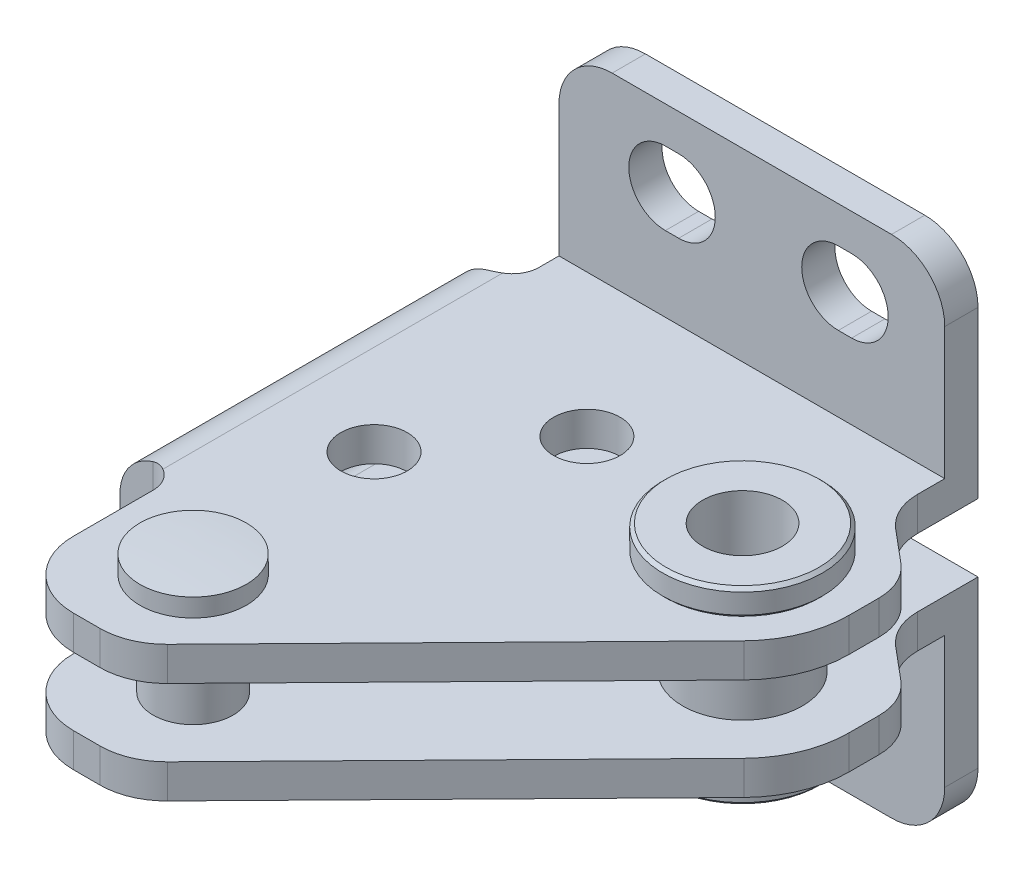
ISO-10303-21;
HEADER;
FILE_DESCRIPTION(('STEP AP214'),'2;1');
FILE_NAME('part.step','',(''),(''),'','','');
FILE_SCHEMA(('AUTOMOTIVE_DESIGN { 1 0 10303 214 1 1 1 1 }'));
ENDSEC;
DATA;
#1=APPLICATION_CONTEXT('core data for automotive mechanical design processes');
#2=APPLICATION_PROTOCOL_DEFINITION('international standard','automotive_design',2000,#1);
#3=PRODUCT_CONTEXT('',#1,'mechanical');
#4=PRODUCT('Part','Part','',(#3));
#5=PRODUCT_RELATED_PRODUCT_CATEGORY('part','',(#4));
#6=PRODUCT_DEFINITION_FORMATION('','',#4);
#7=PRODUCT_DEFINITION_CONTEXT('part definition',#1,'design');
#8=PRODUCT_DEFINITION('design','',#6,#7);
#9=PRODUCT_DEFINITION_SHAPE('','',#8);
#10=(LENGTH_UNIT() NAMED_UNIT(*) SI_UNIT(.MILLI.,.METRE.));
#11=(NAMED_UNIT(*) PLANE_ANGLE_UNIT() SI_UNIT($,.RADIAN.));
#12=(NAMED_UNIT(*) SI_UNIT($,.STERADIAN.) SOLID_ANGLE_UNIT());
#13=UNCERTAINTY_MEASURE_WITH_UNIT(LENGTH_MEASURE(1.E-05),#10,'distance_accuracy_value','');
#14=(GEOMETRIC_REPRESENTATION_CONTEXT(3) GLOBAL_UNCERTAINTY_ASSIGNED_CONTEXT((#13)) GLOBAL_UNIT_ASSIGNED_CONTEXT((#10,
#11,#12)) REPRESENTATION_CONTEXT('',''));
#15=CARTESIAN_POINT('',(0.,0.,0.));
#16=DIRECTION('',(0.,0.,1.));
#17=DIRECTION('',(1.,0.,0.));
#18=AXIS2_PLACEMENT_3D('',#15,#16,#17);
#19=CARTESIAN_POINT('',(-8.,18.6,33.));
#20=DIRECTION('',(-1.,0.,0.));
#21=DIRECTION('',(0.,-1.,0.));
#22=AXIS2_PLACEMENT_3D('',#19,#20,#21);
#23=PLANE('',#22);
#24=DIRECTION('',(0.,0.,1.));
#25=VECTOR('',#24,1.);
#26=CARTESIAN_POINT('',(-8.,8.4,33.));
#27=LINE('',#26,#25);
#28=CARTESIAN_POINT('',(-8.,8.4,33.));
#29=VERTEX_POINT('',#28);
#30=CARTESIAN_POINT('',(-8.,8.4,39.));
#31=VERTEX_POINT('',#30);
#32=EDGE_CURVE('E342',#29,#31,#27,.T.);
#33=ORIENTED_EDGE('',*,*,#32,.T.);
#34=DIRECTION('',(0.,-1.,0.));
#35=VECTOR('',#34,1.);
#36=CARTESIAN_POINT('',(-8.,18.6,39.));
#37=LINE('',#36,#35);
#38=CARTESIAN_POINT('',(-8.,10.95,39.));
#39=VERTEX_POINT('',#38);
#40=EDGE_CURVE('E382',#31,#39,#37,.F.);
#41=ORIENTED_EDGE('',*,*,#40,.T.);
#42=DIRECTION('',(0.,0.,1.));
#43=VECTOR('',#42,1.);
#44=CARTESIAN_POINT('',(-8.,10.95,33.));
#45=LINE('',#44,#43);
#46=CARTESIAN_POINT('',(-8.,10.95,33.));
#47=VERTEX_POINT('',#46);
#48=EDGE_CURVE('E1079',#47,#39,#45,.T.);
#49=ORIENTED_EDGE('',*,*,#48,.F.);
#50=DIRECTION('',(0.,1.,0.));
#51=VECTOR('',#50,1.);
#52=CARTESIAN_POINT('',(-8.,18.6,33.));
#53=LINE('',#52,#51);
#54=EDGE_CURVE('E377',#47,#29,#53,.F.);
#55=ORIENTED_EDGE('',*,*,#54,.T.);
#56=EDGE_LOOP('',(#33,#41,#49,#55));
#57=FACE_BOUND('',#56,.T.);
#58=ADVANCED_FACE('F14',(#57),#23,.T.);
#59=CARTESIAN_POINT('',(-3.,18.6,39.));
#60=DIRECTION('',(0.,1.,0.));
#61=DIRECTION('',(-1.,0.,0.));
#62=AXIS2_PLACEMENT_3D('',#59,#60,#61);
#63=CYLINDRICAL_SURFACE('',#62,5.);
#64=CARTESIAN_POINT('',(-3.,8.4,39.));
#65=DIRECTION('',(0.,1.,0.));
#66=DIRECTION('',(-1.,0.,0.));
#67=AXIS2_PLACEMENT_3D('',#64,#65,#66);
#68=CIRCLE('',#67,5.);
#69=CARTESIAN_POINT('',(-3.,8.4,44.));
#70=VERTEX_POINT('',#69);
#71=EDGE_CURVE('E396',#31,#70,#68,.T.);
#72=ORIENTED_EDGE('',*,*,#71,.T.);
#73=DIRECTION('',(0.,1.,0.));
#74=VECTOR('',#73,1.);
#75=CARTESIAN_POINT('',(-3.,18.6,44.));
#76=LINE('',#75,#74);
#77=CARTESIAN_POINT('',(-3.,10.95,44.));
#78=VERTEX_POINT('',#77);
#79=EDGE_CURVE('E393',#70,#78,#76,.T.);
#80=ORIENTED_EDGE('',*,*,#79,.T.);
#81=CARTESIAN_POINT('',(-3.,10.95,39.));
#82=DIRECTION('',(0.,1.,0.));
#83=DIRECTION('',(0.,0.,-1.));
#84=AXIS2_PLACEMENT_3D('',#81,#82,#83);
#85=CIRCLE('',#84,5.);
#86=EDGE_CURVE('E1082',#39,#78,#85,.T.);
#87=ORIENTED_EDGE('',*,*,#86,.F.);
#88=ORIENTED_EDGE('',*,*,#40,.F.);
#89=EDGE_LOOP('',(#72,#80,#87,#88));
#90=FACE_BOUND('',#89,.T.);
#91=ADVANCED_FACE('F1191',(#90),#63,.T.);
#92=CARTESIAN_POINT('',(-3.,18.6,44.));
#93=DIRECTION('',(0.,0.,1.));
#94=DIRECTION('',(0.,1.,0.));
#95=AXIS2_PLACEMENT_3D('',#92,#93,#94);
#96=PLANE('',#95);
#97=DIRECTION('',(-1.,0.,0.));
#98=VECTOR('',#97,1.);
#99=CARTESIAN_POINT('',(-3.,8.4,44.));
#100=LINE('',#99,#98);
#101=CARTESIAN_POINT('',(-1.,8.4,44.));
#102=VERTEX_POINT('',#101);
#103=EDGE_CURVE('E400',#70,#102,#100,.F.);
#104=ORIENTED_EDGE('',*,*,#103,.T.);
#105=DIRECTION('',(0.,1.,0.));
#106=VECTOR('',#105,1.);
#107=CARTESIAN_POINT('',(-1.,18.6,44.));
#108=LINE('',#107,#106);
#109=CARTESIAN_POINT('',(-1.,10.95,44.));
#110=VERTEX_POINT('',#109);
#111=EDGE_CURVE('E397',#102,#110,#108,.T.);
#112=ORIENTED_EDGE('',*,*,#111,.T.);
#113=DIRECTION('',(1.,0.,0.));
#114=VECTOR('',#113,1.);
#115=CARTESIAN_POINT('',(-3.,10.95,44.));
#116=LINE('',#115,#114);
#117=EDGE_CURVE('E1085',#78,#110,#116,.T.);
#118=ORIENTED_EDGE('',*,*,#117,.F.);
#119=ORIENTED_EDGE('',*,*,#79,.F.);
#120=EDGE_LOOP('',(#104,#112,#118,#119));
#121=FACE_BOUND('',#120,.T.);
#122=ADVANCED_FACE('F1188',(#121),#96,.T.);
#123=CARTESIAN_POINT('',(-1.,18.6,39.));
#124=DIRECTION('',(0.,1.,0.));
#125=DIRECTION('',(-1.,0.,0.));
#126=AXIS2_PLACEMENT_3D('',#123,#124,#125);
#127=CYLINDRICAL_SURFACE('',#126,5.);
#128=CARTESIAN_POINT('',(-1.,8.4,39.));
#129=DIRECTION('',(0.,1.,0.));
#130=DIRECTION('',(-1.,0.,0.));
#131=AXIS2_PLACEMENT_3D('',#128,#129,#130);
#132=CIRCLE('',#131,5.);
#133=CARTESIAN_POINT('',(2.5726598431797,8.4,42.4980139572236));
#134=VERTEX_POINT('',#133);
#135=EDGE_CURVE('E404',#102,#134,#132,.T.);
#136=ORIENTED_EDGE('',*,*,#135,.T.);
#137=DIRECTION('',(0.,1.,0.));
#138=VECTOR('',#137,1.);
#139=CARTESIAN_POINT('',(2.5726598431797,18.6,42.4980139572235));
#140=LINE('',#139,#138);
#141=CARTESIAN_POINT('',(2.5726598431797,10.95,42.4980139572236));
#142=VERTEX_POINT('',#141);
#143=EDGE_CURVE('E401',#134,#142,#140,.T.);
#144=ORIENTED_EDGE('',*,*,#143,.T.);
#145=CARTESIAN_POINT('',(-1.,10.95,39.));
#146=DIRECTION('',(0.,1.,0.));
#147=DIRECTION('',(0.,0.,-1.));
#148=AXIS2_PLACEMENT_3D('',#145,#146,#147);
#149=CIRCLE('',#148,5.);
#150=EDGE_CURVE('E1088',#110,#142,#149,.T.);
#151=ORIENTED_EDGE('',*,*,#150,.F.);
#152=ORIENTED_EDGE('',*,*,#111,.F.);
#153=EDGE_LOOP('',(#136,#144,#151,#152));
#154=FACE_BOUND('',#153,.T.);
#155=ADVANCED_FACE('F1184',(#154),#127,.T.);
#156=CARTESIAN_POINT('',(2.5726598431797,18.6,42.4980139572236));
#157=DIRECTION('',(0.714531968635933,0.,0.69960279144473));
#158=DIRECTION('',(0.69960279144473,0.,-0.714531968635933));
#159=AXIS2_PLACEMENT_3D('',#156,#157,#158);
#160=PLANE('',#159);
#161=DIRECTION('',(0.69960279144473,0.,-0.714531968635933));
#162=VECTOR('',#161,1.);
#163=CARTESIAN_POINT('',(2.5726598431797,8.4,42.4980139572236));
#164=LINE('',#163,#162);
#165=CARTESIAN_POINT('',(24.0162557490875,8.4,20.5968223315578));
#166=VERTEX_POINT('',#165);
#167=EDGE_CURVE('E408',#134,#166,#164,.T.);
#168=ORIENTED_EDGE('',*,*,#167,.T.);
#169=DIRECTION('',(0.,1.,0.));
#170=VECTOR('',#169,1.);
#171=CARTESIAN_POINT('',(24.0162557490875,18.6,20.5968223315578));
#172=LINE('',#171,#170);
#173=CARTESIAN_POINT('',(24.0162557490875,10.95,20.5968223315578));
#174=VERTEX_POINT('',#173);
#175=EDGE_CURVE('E405',#166,#174,#172,.T.);
#176=ORIENTED_EDGE('',*,*,#175,.T.);
#177=DIRECTION('',(0.699602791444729,0.,-0.714531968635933));
#178=VECTOR('',#177,1.);
#179=CARTESIAN_POINT('',(2.5726598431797,10.95,42.4980139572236));
#180=LINE('',#179,#178);
#181=EDGE_CURVE('E1091',#142,#174,#180,.T.);
#182=ORIENTED_EDGE('',*,*,#181,.F.);
#183=ORIENTED_EDGE('',*,*,#143,.F.);
#184=EDGE_LOOP('',(#168,#176,#182,#183));
#185=FACE_BOUND('',#184,.T.);
#186=ADVANCED_FACE('F1180',(#185),#160,.T.);
#187=CARTESIAN_POINT('',(18.3,18.6,15.));
#188=DIRECTION('',(0.,1.,0.));
#189=DIRECTION('',(-1.,0.,0.));
#190=AXIS2_PLACEMENT_3D('',#187,#188,#189);
#191=CYLINDRICAL_SURFACE('',#190,8.);
#192=CARTESIAN_POINT('',(18.3,8.4,15.));
#193=DIRECTION('',(0.,1.,0.));
#194=DIRECTION('',(-1.,0.,0.));
#195=AXIS2_PLACEMENT_3D('',#192,#193,#194);
#196=CIRCLE('',#195,8.);
#197=CARTESIAN_POINT('',(26.3,8.4,15.));
#198=VERTEX_POINT('',#197);
#199=EDGE_CURVE('E412',#166,#198,#196,.T.);
#200=ORIENTED_EDGE('',*,*,#199,.T.);
#201=DIRECTION('',(0.,1.,0.));
#202=VECTOR('',#201,1.);
#203=CARTESIAN_POINT('',(26.3,18.6,15.));
#204=LINE('',#203,#202);
#205=CARTESIAN_POINT('',(26.3,10.95,15.));
#206=VERTEX_POINT('',#205);
#207=EDGE_CURVE('E409',#198,#206,#204,.T.);
#208=ORIENTED_EDGE('',*,*,#207,.T.);
#209=CARTESIAN_POINT('',(18.3,10.95,15.));
#210=DIRECTION('',(0.,1.,0.));
#211=DIRECTION('',(0.,0.,-1.));
#212=AXIS2_PLACEMENT_3D('',#209,#210,#211);
#213=CIRCLE('',#212,8.);
#214=EDGE_CURVE('E1094',#174,#206,#213,.T.);
#215=ORIENTED_EDGE('',*,*,#214,.F.);
#216=ORIENTED_EDGE('',*,*,#175,.F.);
#217=EDGE_LOOP('',(#200,#208,#215,#216));
#218=FACE_BOUND('',#217,.T.);
#219=ADVANCED_FACE('F1176',(#218),#191,.T.);
#220=CARTESIAN_POINT('',(26.3,18.6,15.));
#221=DIRECTION('',(1.,0.,0.));
#222=DIRECTION('',(0.,1.,0.));
#223=AXIS2_PLACEMENT_3D('',#220,#221,#222);
#224=PLANE('',#223);
#225=DIRECTION('',(0.,0.,1.));
#226=VECTOR('',#225,1.);
#227=CARTESIAN_POINT('',(26.3,8.4,15.));
#228=LINE('',#227,#226);
#229=CARTESIAN_POINT('',(26.3,8.4,12.73));
#230=VERTEX_POINT('',#229);
#231=EDGE_CURVE('E416',#198,#230,#228,.F.);
#232=ORIENTED_EDGE('',*,*,#231,.T.);
#233=DIRECTION('',(0.,1.,0.));
#234=VECTOR('',#233,1.);
#235=CARTESIAN_POINT('',(26.3,18.6,12.73));
#236=LINE('',#235,#234);
#237=CARTESIAN_POINT('',(26.3,10.95,12.73));
#238=VERTEX_POINT('',#237);
#239=EDGE_CURVE('E413',#230,#238,#236,.T.);
#240=ORIENTED_EDGE('',*,*,#239,.T.);
#241=DIRECTION('',(0.,0.,-1.));
#242=VECTOR('',#241,1.);
#243=CARTESIAN_POINT('',(26.3,10.95,15.));
#244=LINE('',#243,#242);
#245=EDGE_CURVE('E1097',#206,#238,#244,.T.);
#246=ORIENTED_EDGE('',*,*,#245,.F.);
#247=ORIENTED_EDGE('',*,*,#207,.F.);
#248=EDGE_LOOP('',(#232,#240,#246,#247));
#249=FACE_BOUND('',#248,.T.);
#250=ADVANCED_FACE('F1172',(#249),#224,.T.);
#251=CARTESIAN_POINT('',(22.3,18.6,12.73));
#252=DIRECTION('',(0.,1.,0.));
#253=DIRECTION('',(-1.,0.,0.));
#254=AXIS2_PLACEMENT_3D('',#251,#252,#253);
#255=CYLINDRICAL_SURFACE('',#254,4.);
#256=CARTESIAN_POINT('',(22.3,8.4,12.73));
#257=DIRECTION('',(0.,1.,0.));
#258=DIRECTION('',(-1.,0.,0.));
#259=AXIS2_PLACEMENT_3D('',#256,#257,#258);
#260=CIRCLE('',#259,4.);
#261=CARTESIAN_POINT('',(24.8711504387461,8.4,9.6658222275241));
#262=VERTEX_POINT('',#261);
#263=EDGE_CURVE('E420',#230,#262,#260,.T.);
#264=ORIENTED_EDGE('',*,*,#263,.T.);
#265=DIRECTION('',(0.,1.,0.));
#266=VECTOR('',#265,1.);
#267=CARTESIAN_POINT('',(24.8711504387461,18.6,9.6658222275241));
#268=LINE('',#267,#266);
#269=CARTESIAN_POINT('',(24.8711504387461,10.95,9.6658222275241));
#270=VERTEX_POINT('',#269);
#271=EDGE_CURVE('E417',#262,#270,#268,.T.);
#272=ORIENTED_EDGE('',*,*,#271,.T.);
#273=CARTESIAN_POINT('',(22.3,10.95,12.73));
#274=DIRECTION('',(0.,1.,0.));
#275=DIRECTION('',(0.,0.,-1.));
#276=AXIS2_PLACEMENT_3D('',#273,#274,#275);
#277=CIRCLE('',#276,4.);
#278=EDGE_CURVE('E1100',#238,#270,#277,.T.);
#279=ORIENTED_EDGE('',*,*,#278,.F.);
#280=ORIENTED_EDGE('',*,*,#239,.F.);
#281=EDGE_LOOP('',(#264,#272,#279,#280));
#282=FACE_BOUND('',#281,.T.);
#283=ADVANCED_FACE('F1168',(#282),#255,.T.);
#284=CARTESIAN_POINT('',(24.8711504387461,18.6,9.6658222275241));
#285=DIRECTION('',(0.64278760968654,0.,-0.766044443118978));
#286=DIRECTION('',(-0.766044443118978,0.,-0.64278760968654));
#287=AXIS2_PLACEMENT_3D('',#284,#285,#286);
#288=PLANE('',#287);
#289=DIRECTION('',(-0.766044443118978,0.,-0.64278760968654));
#290=VECTOR('',#289,1.);
#291=CARTESIAN_POINT('',(24.8711504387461,8.4,9.6658222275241));
#292=LINE('',#291,#290);
#293=CARTESIAN_POINT('',(22.4288495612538,8.4,7.61648846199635));
#294=VERTEX_POINT('',#293);
#295=EDGE_CURVE('E424',#262,#294,#292,.T.);
#296=ORIENTED_EDGE('',*,*,#295,.T.);
#297=DIRECTION('',(0.,1.,0.));
#298=VECTOR('',#297,1.);
#299=CARTESIAN_POINT('',(22.4288495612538,18.6,7.61648846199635));
#300=LINE('',#299,#298);
#301=CARTESIAN_POINT('',(22.4288495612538,10.95,7.61648846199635));
#302=VERTEX_POINT('',#301);
#303=EDGE_CURVE('E421',#294,#302,#300,.T.);
#304=ORIENTED_EDGE('',*,*,#303,.T.);
#305=DIRECTION('',(-0.766044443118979,0.,-0.642787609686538));
#306=VECTOR('',#305,1.);
#307=CARTESIAN_POINT('',(24.8711504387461,10.95,9.6658222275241));
#308=LINE('',#307,#306);
#309=EDGE_CURVE('E1103',#270,#302,#308,.T.);
#310=ORIENTED_EDGE('',*,*,#309,.F.);
#311=ORIENTED_EDGE('',*,*,#271,.F.);
#312=EDGE_LOOP('',(#296,#304,#310,#311));
#313=FACE_BOUND('',#312,.T.);
#314=ADVANCED_FACE('F1164',(#313),#288,.T.);
#315=CARTESIAN_POINT('',(25.,18.6,4.55231068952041));
#316=DIRECTION('',(0.,1.,0.));
#317=DIRECTION('',(-1.,0.,0.));
#318=AXIS2_PLACEMENT_3D('',#315,#316,#317);
#319=CYLINDRICAL_SURFACE('',#318,4.);
#320=ORIENTED_EDGE('',*,*,#303,.F.);
#321=CARTESIAN_POINT('',(25.,8.4,4.55231068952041));
#322=DIRECTION('',(0.,1.,0.));
#323=DIRECTION('',(-1.,0.,0.));
#324=AXIS2_PLACEMENT_3D('',#321,#322,#323);
#325=CIRCLE('',#324,4.);
#326=CARTESIAN_POINT('',(21.,8.4,4.55231068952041));
#327=VERTEX_POINT('',#326);
#328=EDGE_CURVE('E428',#327,#294,#325,.T.);
#329=ORIENTED_EDGE('',*,*,#328,.F.);
#330=DIRECTION('',(0.,1.,0.));
#331=VECTOR('',#330,1.);
#332=CARTESIAN_POINT('',(21.,18.6,4.55231068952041));
#333=LINE('',#332,#331);
#334=CARTESIAN_POINT('',(21.,10.95,4.55231068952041));
#335=VERTEX_POINT('',#334);
#336=EDGE_CURVE('E425',#335,#327,#333,.F.);
#337=ORIENTED_EDGE('',*,*,#336,.F.);
#338=CARTESIAN_POINT('',(25.,10.95,4.55231068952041));
#339=DIRECTION('',(0.,-1.,0.));
#340=DIRECTION('',(0.,0.,-1.));
#341=AXIS2_PLACEMENT_3D('',#338,#339,#340);
#342=CIRCLE('',#341,4.);
#343=EDGE_CURVE('E1106',#302,#335,#342,.T.);
#344=ORIENTED_EDGE('',*,*,#343,.F.);
#345=EDGE_LOOP('',(#320,#329,#337,#344));
#346=FACE_BOUND('',#345,.T.);
#347=ADVANCED_FACE('F1160',(#346),#319,.F.);
#348=CARTESIAN_POINT('',(21.,18.6,4.55231068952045));
#349=DIRECTION('',(1.,0.,0.));
#350=DIRECTION('',(0.,1.,0.));
#351=AXIS2_PLACEMENT_3D('',#348,#349,#350);
#352=PLANE('',#351);
#353=DIRECTION('',(0.,0.,1.));
#354=VECTOR('',#353,1.);
#355=CARTESIAN_POINT('',(21.,-1.5,4.55231068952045));
#356=LINE('',#355,#354);
#357=CARTESIAN_POINT('',(21.,-1.5,2.5));
#358=VERTEX_POINT('',#357);
#359=CARTESIAN_POINT('',(21.,-1.5,0.));
#360=VERTEX_POINT('',#359);
#361=EDGE_CURVE('E432',#358,#360,#356,.F.);
#362=ORIENTED_EDGE('',*,*,#361,.T.);
#363=DIRECTION('',(0.,1.,0.));
#364=VECTOR('',#363,1.);
#365=CARTESIAN_POINT('',(21.,18.6,0.));
#366=LINE('',#365,#364);
#367=CARTESIAN_POINT('',(21.,10.95,0.));
#368=VERTEX_POINT('',#367);
#369=EDGE_CURVE('E429',#360,#368,#366,.T.);
#370=ORIENTED_EDGE('',*,*,#369,.T.);
#371=DIRECTION('',(0.,0.,-1.));
#372=VECTOR('',#371,1.);
#373=CARTESIAN_POINT('',(21.,10.95,4.55231068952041));
#374=LINE('',#373,#372);
#375=EDGE_CURVE('E1109',#335,#368,#374,.T.);
#376=ORIENTED_EDGE('',*,*,#375,.F.);
#377=ORIENTED_EDGE('',*,*,#336,.T.);
#378=DIRECTION('',(0.,0.,1.));
#379=VECTOR('',#378,1.);
#380=CARTESIAN_POINT('',(21.,8.4,4.55231068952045));
#381=LINE('',#380,#379);
#382=CARTESIAN_POINT('',(21.,8.4,2.5));
#383=VERTEX_POINT('',#382);
#384=EDGE_CURVE('E438',#327,#383,#381,.F.);
#385=ORIENTED_EDGE('',*,*,#384,.T.);
#386=DIRECTION('',(0.,1.,0.));
#387=VECTOR('',#386,1.);
#388=CARTESIAN_POINT('',(21.,18.6,2.5));
#389=LINE('',#388,#387);
#390=EDGE_CURVE('E469',#383,#358,#389,.F.);
#391=ORIENTED_EDGE('',*,*,#390,.T.);
#392=EDGE_LOOP('',(#362,#370,#376,#377,#385,#391));
#393=FACE_BOUND('',#392,.T.);
#394=ADVANCED_FACE('F1156',(#393),#352,.T.);
#395=CARTESIAN_POINT('',(21.,18.6,0.));
#396=DIRECTION('',(0.,0.,-1.));
#397=DIRECTION('',(0.,-1.,0.));
#398=AXIS2_PLACEMENT_3D('',#395,#396,#397);
#399=PLANE('',#398);
#400=CARTESIAN_POINT('',(-4.,-1.5,0.));
#401=DIRECTION('',(0.,0.,-1.));
#402=DIRECTION('',(0.,-1.,0.));
#403=AXIS2_PLACEMENT_3D('',#400,#401,#402);
#404=CIRCLE('',#403,4.);
#405=CARTESIAN_POINT('',(-4.,-5.5,0.));
#406=VERTEX_POINT('',#405);
#407=CARTESIAN_POINT('',(-8.,-1.5,0.));
#408=VERTEX_POINT('',#407);
#409=EDGE_CURVE('E439',#406,#408,#404,.T.);
#410=ORIENTED_EDGE('',*,*,#409,.T.);
#411=DIRECTION('',(0.,-1.,0.));
#412=VECTOR('',#411,1.);
#413=CARTESIAN_POINT('',(-8.,18.6,0.));
#414=LINE('',#413,#412);
#415=CARTESIAN_POINT('',(-8.,10.95,0.));
#416=VERTEX_POINT('',#415);
#417=EDGE_CURVE('E435',#408,#416,#414,.F.);
#418=ORIENTED_EDGE('',*,*,#417,.T.);
#419=DIRECTION('',(-1.,0.,0.));
#420=VECTOR('',#419,1.);
#421=CARTESIAN_POINT('',(21.,10.95,0.));
#422=LINE('',#421,#420);
#423=EDGE_CURVE('E1112',#368,#416,#422,.T.);
#424=ORIENTED_EDGE('',*,*,#423,.F.);
#425=ORIENTED_EDGE('',*,*,#369,.F.);
#426=CARTESIAN_POINT('',(17.,-1.5,0.));
#427=DIRECTION('',(0.,0.,-1.));
#428=DIRECTION('',(0.,-1.,0.));
#429=AXIS2_PLACEMENT_3D('',#426,#427,#428);
#430=CIRCLE('',#429,4.);
#431=CARTESIAN_POINT('',(17.,-5.5,0.));
#432=VERTEX_POINT('',#431);
#433=EDGE_CURVE('E444',#360,#432,#430,.T.);
#434=ORIENTED_EDGE('',*,*,#433,.T.);
#435=DIRECTION('',(-1.,0.,0.));
#436=VECTOR('',#435,1.);
#437=CARTESIAN_POINT('',(21.,-5.5,0.));
#438=LINE('',#437,#436);
#439=EDGE_CURVE('E442',#432,#406,#438,.T.);
#440=ORIENTED_EDGE('',*,*,#439,.T.);
#441=EDGE_LOOP('',(#410,#418,#424,#425,#434,#440));
#442=FACE_BOUND('',#441,.T.);
#443=DIRECTION('',(-1.,0.,0.));
#444=VECTOR('',#443,1.);
#445=CARTESIAN_POINT('',(0.,2.75,0.));
#446=LINE('',#445,#444);
#447=CARTESIAN_POINT('',(1.,2.75,0.));
#448=VERTEX_POINT('',#447);
#449=CARTESIAN_POINT('',(0.,2.75,0.));
#450=VERTEX_POINT('',#449);
#451=EDGE_CURVE('E550',#448,#450,#446,.T.);
#452=ORIENTED_EDGE('',*,*,#451,.T.);
#453=CARTESIAN_POINT('',(0.,0.,0.));
#454=DIRECTION('',(0.,0.,-1.));
#455=DIRECTION('',(0.,-1.,0.));
#456=AXIS2_PLACEMENT_3D('',#453,#454,#455);
#457=CIRCLE('',#456,2.75);
#458=CARTESIAN_POINT('',(0.,-2.75,0.));
#459=VERTEX_POINT('',#458);
#460=EDGE_CURVE('E1331',#450,#459,#457,.F.);
#461=ORIENTED_EDGE('',*,*,#460,.T.);
#462=DIRECTION('',(1.,0.,0.));
#463=VECTOR('',#462,1.);
#464=CARTESIAN_POINT('',(1.,-2.75,0.));
#465=LINE('',#464,#463);
#466=CARTESIAN_POINT('',(1.,-2.75,0.));
#467=VERTEX_POINT('',#466);
#468=EDGE_CURVE('E545',#459,#467,#465,.T.);
#469=ORIENTED_EDGE('',*,*,#468,.T.);
#470=CARTESIAN_POINT('',(1.,0.,0.));
#471=DIRECTION('',(0.,0.,-1.));
#472=DIRECTION('',(0.,-1.,0.));
#473=AXIS2_PLACEMENT_3D('',#470,#471,#472);
#474=CIRCLE('',#473,2.75);
#475=EDGE_CURVE('E1329',#467,#448,#474,.F.);
#476=ORIENTED_EDGE('',*,*,#475,.T.);
#477=EDGE_LOOP('',(#452,#461,#469,#476));
#478=FACE_BOUND('',#477,.T.);
#479=DIRECTION('',(-1.,0.,0.));
#480=VECTOR('',#479,1.);
#481=CARTESIAN_POINT('',(13.,2.75,0.));
#482=LINE('',#481,#480);
#483=CARTESIAN_POINT('',(14.,2.75,0.));
#484=VERTEX_POINT('',#483);
#485=CARTESIAN_POINT('',(13.,2.75,0.));
#486=VERTEX_POINT('',#485);
#487=EDGE_CURVE('E558',#484,#486,#482,.T.);
#488=ORIENTED_EDGE('',*,*,#487,.T.);
#489=CARTESIAN_POINT('',(13.,0.,0.));
#490=DIRECTION('',(0.,0.,-1.));
#491=DIRECTION('',(0.,-1.,0.));
#492=AXIS2_PLACEMENT_3D('',#489,#490,#491);
#493=CIRCLE('',#492,2.75);
#494=CARTESIAN_POINT('',(13.,-2.75,0.));
#495=VERTEX_POINT('',#494);
#496=EDGE_CURVE('E1318',#486,#495,#493,.F.);
#497=ORIENTED_EDGE('',*,*,#496,.T.);
#498=DIRECTION('',(1.,0.,0.));
#499=VECTOR('',#498,1.);
#500=CARTESIAN_POINT('',(14.,-2.75,0.));
#501=LINE('',#500,#499);
#502=CARTESIAN_POINT('',(14.,-2.75,0.));
#503=VERTEX_POINT('',#502);
#504=EDGE_CURVE('E553',#495,#503,#501,.T.);
#505=ORIENTED_EDGE('',*,*,#504,.T.);
#506=CARTESIAN_POINT('',(14.,0.,0.));
#507=DIRECTION('',(0.,0.,-1.));
#508=DIRECTION('',(0.,-1.,0.));
#509=AXIS2_PLACEMENT_3D('',#506,#507,#508);
#510=CIRCLE('',#509,2.75);
#511=EDGE_CURVE('E448',#503,#484,#510,.F.);
#512=ORIENTED_EDGE('',*,*,#511,.T.);
#513=EDGE_LOOP('',(#488,#497,#505,#512));
#514=FACE_BOUND('',#513,.T.);
#515=ADVANCED_FACE('F1152',(#442,#478,#514),#399,.T.);
#516=CARTESIAN_POINT('',(-8.,18.6,0.));
#517=DIRECTION('',(-1.,0.,0.));
#518=DIRECTION('',(0.,-1.,0.));
#519=AXIS2_PLACEMENT_3D('',#516,#517,#518);
#520=PLANE('',#519);
#521=DIRECTION('',(0.,0.,1.));
#522=VECTOR('',#521,1.);
#523=CARTESIAN_POINT('',(-8.,8.4,0.));
#524=LINE('',#523,#522);
#525=CARTESIAN_POINT('',(-8.,8.4,2.5));
#526=VERTEX_POINT('',#525);
#527=CARTESIAN_POINT('',(-8.,8.4,4.));
#528=VERTEX_POINT('',#527);
#529=EDGE_CURVE('E449',#526,#528,#524,.T.);
#530=ORIENTED_EDGE('',*,*,#529,.T.);
#531=DIRECTION('',(0.,-1.,0.));
#532=VECTOR('',#531,1.);
#533=CARTESIAN_POINT('',(-8.,18.6,4.));
#534=LINE('',#533,#532);
#535=CARTESIAN_POINT('',(-8.,10.95,4.));
#536=VERTEX_POINT('',#535);
#537=EDGE_CURVE('E445',#528,#536,#534,.F.);
#538=ORIENTED_EDGE('',*,*,#537,.T.);
#539=DIRECTION('',(0.,0.,1.));
#540=VECTOR('',#539,1.);
#541=CARTESIAN_POINT('',(-8.,10.95,0.));
#542=LINE('',#541,#540);
#543=EDGE_CURVE('E1115',#416,#536,#542,.T.);
#544=ORIENTED_EDGE('',*,*,#543,.F.);
#545=ORIENTED_EDGE('',*,*,#417,.F.);
#546=DIRECTION('',(0.,0.,1.));
#547=VECTOR('',#546,1.);
#548=CARTESIAN_POINT('',(-8.,-1.5,0.));
#549=LINE('',#548,#547);
#550=CARTESIAN_POINT('',(-8.,-1.5,2.5));
#551=VERTEX_POINT('',#550);
#552=EDGE_CURVE('E452',#408,#551,#549,.T.);
#553=ORIENTED_EDGE('',*,*,#552,.T.);
#554=DIRECTION('',(0.,-1.,0.));
#555=VECTOR('',#554,1.);
#556=CARTESIAN_POINT('',(-8.,18.6,2.5));
#557=LINE('',#556,#555);
#558=EDGE_CURVE('E486',#551,#526,#557,.F.);
#559=ORIENTED_EDGE('',*,*,#558,.T.);
#560=EDGE_LOOP('',(#530,#538,#544,#545,#553,#559));
#561=FACE_BOUND('',#560,.T.);
#562=ADVANCED_FACE('F1148',(#561),#520,.T.);
#563=CARTESIAN_POINT('',(-10.,18.6,4.));
#564=DIRECTION('',(0.,1.,0.));
#565=DIRECTION('',(-1.,0.,0.));
#566=AXIS2_PLACEMENT_3D('',#563,#564,#565);
#567=CYLINDRICAL_SURFACE('',#566,2.);
#568=DIRECTION('',(0.,1.,0.));
#569=VECTOR('',#568,1.);
#570=CARTESIAN_POINT('',(-10.,18.6,6.));
#571=LINE('',#570,#569);
#572=CARTESIAN_POINT('',(-10.,11.9,6.));
#573=VERTEX_POINT('',#572);
#574=CARTESIAN_POINT('',(-10.,8.54589803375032,6.));
#575=VERTEX_POINT('',#574);
#576=EDGE_CURVE('E450',#573,#575,#571,.F.);
#577=ORIENTED_EDGE('',*,*,#576,.F.);
#578=CARTESIAN_POINT('',(-9.,10.9,5.73205080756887));
#579=CARTESIAN_POINT('',(-9.02409410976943,10.9000004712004,5.74596359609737));
#580=CARTESIAN_POINT('',(-9.04847538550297,10.9008718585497,5.75936677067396));
#581=CARTESIAN_POINT('',(-9.09767972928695,10.9044756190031,5.78510203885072));
#582=CARTESIAN_POINT('',(-9.12250306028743,10.9072091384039,5.79743346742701));
#583=CARTESIAN_POINT('',(-9.19740861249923,10.9183828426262,5.83272531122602));
#584=CARTESIAN_POINT('',(-9.24791000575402,10.9297963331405,5.85397385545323));
#585=CARTESIAN_POINT('',(-9.34832028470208,10.9611438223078,5.89161430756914));
#586=CARTESIAN_POINT('',(-9.39822603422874,10.9811113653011,5.90798666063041));
#587=CARTESIAN_POINT('',(-9.49513092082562,11.0294995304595,5.93588393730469));
#588=CARTESIAN_POINT('',(-9.54213440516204,11.0579071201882,5.94741626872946));
#589=CARTESIAN_POINT('',(-9.62870571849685,11.1206294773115,5.96570273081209));
#590=CARTESIAN_POINT('',(-9.66854871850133,11.1544964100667,5.9726987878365));
#591=CARTESIAN_POINT('',(-9.74266736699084,11.2282988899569,5.98373060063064));
#592=CARTESIAN_POINT('',(-9.77693947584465,11.2682382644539,5.98776447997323));
#593=CARTESIAN_POINT('',(-9.83935268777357,11.3537972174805,5.99378906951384));
#594=CARTESIAN_POINT('',(-9.86738371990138,11.3994993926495,5.99574509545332));
#595=CARTESIAN_POINT('',(-9.91579610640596,11.494813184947,5.9983742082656));
#596=CARTESIAN_POINT('',(-9.93617735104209,11.5444248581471,5.99904727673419));
#597=CARTESIAN_POINT('',(-9.96818393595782,11.6445008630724,5.99980923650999));
#598=CARTESIAN_POINT('',(-9.98009108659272,11.694874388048,5.99991777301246));
#599=CARTESIAN_POINT('',(-9.99202283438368,11.7713198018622,5.99998752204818));
#600=CARTESIAN_POINT('',(-9.99501192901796,11.7969603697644,5.99999524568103));
#601=CARTESIAN_POINT('',(-9.99900053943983,11.8483972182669,6.00000027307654));
#602=CARTESIAN_POINT('',(-9.99999994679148,11.874193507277,5.99999757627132));
#603=CARTESIAN_POINT('',(-10.,11.9,6.));
#604=B_SPLINE_CURVE_WITH_KNOTS('',3,(#578,#579,#580,#581,#582,#583,#584,#585,#586,#587,#588,
#589,#590,#591,#592,#593,#594,#595,#596,#597,#598,#599,#600,#601,#602,#603),.UNSPECIFIED.,.F.,
.F.,(4,2,2,2,2,2,2,2,2,2,2,2,4),(0.,0.0834312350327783,0.166913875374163,0.333935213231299,
0.50161760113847,0.669042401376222,0.826581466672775,0.984220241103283,1.14445090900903,
1.30468387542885,1.45930167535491,1.53667730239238,1.61405714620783),.UNSPECIFIED.);
#605=CARTESIAN_POINT('',(-9.,10.9,5.73205080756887));
#606=VERTEX_POINT('',#605);
#607=EDGE_CURVE('E355',#606,#573,#604,.T.);
#608=ORIENTED_EDGE('',*,*,#607,.F.);
#609=DIRECTION('',(0.,-1.,0.));
#610=VECTOR('',#609,1.);
#611=CARTESIAN_POINT('',(-9.,10.95,5.73205080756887));
#612=LINE('',#611,#610);
#613=CARTESIAN_POINT('',(-9.,10.95,5.73205080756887));
#614=VERTEX_POINT('',#613);
#615=EDGE_CURVE('E899',#614,#606,#612,.T.);
#616=ORIENTED_EDGE('',*,*,#615,.F.);
#617=CARTESIAN_POINT('',(-10.,10.95,4.));
#618=DIRECTION('',(0.,-1.,0.));
#619=DIRECTION('',(0.,0.,-1.));
#620=AXIS2_PLACEMENT_3D('',#617,#618,#619);
#621=CIRCLE('',#620,2.);
#622=EDGE_CURVE('E1118',#536,#614,#621,.T.);
#623=ORIENTED_EDGE('',*,*,#622,.F.);
#624=ORIENTED_EDGE('',*,*,#537,.F.);
#625=CARTESIAN_POINT('',(-10.,8.4,4.));
#626=DIRECTION('',(0.,1.,0.));
#627=DIRECTION('',(-1.,0.,0.));
#628=AXIS2_PLACEMENT_3D('',#625,#626,#627);
#629=CIRCLE('',#628,2.);
#630=CARTESIAN_POINT('',(-9.,8.4,5.73205080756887));
#631=VERTEX_POINT('',#630);
#632=EDGE_CURVE('E359',#631,#528,#629,.T.);
#633=ORIENTED_EDGE('',*,*,#632,.F.);
#634=CARTESIAN_POINT('',(-10.,8.54589803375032,6.));
#635=CARTESIAN_POINT('',(-9.95115142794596,8.53132444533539,6.00000830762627));
#636=CARTESIAN_POINT('',(-9.90197333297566,8.51783396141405,5.99821041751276));
#637=CARTESIAN_POINT('',(-9.80332192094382,8.49305946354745,5.99091844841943));
#638=CARTESIAN_POINT('',(-9.75384852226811,8.48177609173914,5.98542329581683));
#639=CARTESIAN_POINT('',(-9.65621831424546,8.46171511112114,5.97083507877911));
#640=CARTESIAN_POINT('',(-9.60805913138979,8.4528825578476,5.96183410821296));
#641=CARTESIAN_POINT('',(-9.51223376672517,8.43734582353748,5.94023142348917));
#642=CARTESIAN_POINT('',(-9.46456743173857,8.43064096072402,5.92763086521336));
#643=CARTESIAN_POINT('',(-9.3456401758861,8.4163626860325,5.89140523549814));
#644=CARTESIAN_POINT('',(-9.27490398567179,8.41012822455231,5.86544711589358));
#645=CARTESIAN_POINT('',(-9.17056836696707,8.40397947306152,5.82030845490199));
#646=CARTESIAN_POINT('',(-9.13575871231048,8.40246517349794,5.80404120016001));
#647=CARTESIAN_POINT('',(-9.06711798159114,8.40047536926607,5.76952114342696));
#648=CARTESIAN_POINT('',(-9.03328666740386,8.39999960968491,5.75126882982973));
#649=CARTESIAN_POINT('',(-9.,8.4,5.73205080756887));
#650=B_SPLINE_CURVE_WITH_KNOTS('',3,(#634,#635,#636,#637,#638,#639,#640,#641,#642,#643,#644,
#645,#646,#647,#648,#649),.UNSPECIFIED.,.F.,.F.,(4,2,2,2,2,2,2,4),(0.,0.152893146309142,
0.305830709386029,0.454995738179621,0.604112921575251,0.830221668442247,0.945515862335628,
1.06078175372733),.UNSPECIFIED.);
#651=EDGE_CURVE('E536',#575,#631,#650,.T.);
#652=ORIENTED_EDGE('',*,*,#651,.F.);
#653=EDGE_LOOP('',(#577,#608,#616,#623,#624,#633,#652));
#654=FACE_BOUND('',#653,.T.);
#655=ADVANCED_FACE('F1134',(#654),#567,.F.);
#656=CARTESIAN_POINT('',(-9.,11.9,0.));
#657=DIRECTION('',(0.,0.,-1.));
#658=DIRECTION('',(0.,-1.,0.));
#659=AXIS2_PLACEMENT_3D('',#656,#657,#658);
#660=CYLINDRICAL_SURFACE('',#659,1.);
#661=DIRECTION('',(0.,0.,1.));
#662=VECTOR('',#661,1.);
#663=CARTESIAN_POINT('',(-9.,10.9,0.));
#664=LINE('',#663,#662);
#665=CARTESIAN_POINT('',(-9.,10.9,31.2679491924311));
#666=VERTEX_POINT('',#665);
#667=EDGE_CURVE('E388',#666,#606,#664,.F.);
#668=ORIENTED_EDGE('',*,*,#667,.T.);
#669=ORIENTED_EDGE('',*,*,#607,.T.);
#670=DIRECTION('',(0.,0.,-1.));
#671=VECTOR('',#670,1.);
#672=CARTESIAN_POINT('',(-10.,11.9,0.));
#673=LINE('',#672,#671);
#674=CARTESIAN_POINT('',(-10.,11.9,31.));
#675=VERTEX_POINT('',#674);
#676=EDGE_CURVE('E349',#675,#573,#673,.T.);
#677=ORIENTED_EDGE('',*,*,#676,.F.);
#678=CARTESIAN_POINT('',(-10.,11.9,31.));
#679=CARTESIAN_POINT('',(-9.99999980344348,11.871935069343,31.0000033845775));
#680=CARTESIAN_POINT('',(-9.99881779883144,11.843883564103,30.9999996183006));
#681=CARTESIAN_POINT('',(-9.9941022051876,11.7879800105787,31.0000066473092));
#682=CARTESIAN_POINT('',(-9.99056870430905,11.7601279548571,31.0000174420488));
#683=CARTESIAN_POINT('',(-9.97647012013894,11.6771928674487,31.0001148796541));
#684=CARTESIAN_POINT('',(-9.96240689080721,11.6226629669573,31.0002664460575));
#685=CARTESIAN_POINT('',(-9.92534204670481,11.5167282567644,31.0013089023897));
#686=CARTESIAN_POINT('',(-9.902334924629,11.4653253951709,31.0022002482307));
#687=CARTESIAN_POINT('',(-9.84805582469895,11.3671353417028,31.0055954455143));
#688=CARTESIAN_POINT('',(-9.81678516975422,11.3203474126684,31.0080990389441));
#689=CARTESIAN_POINT('',(-9.74732976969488,11.233239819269,31.0157213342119));
#690=CARTESIAN_POINT('',(-9.70921923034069,11.1928587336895,31.0208129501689));
#691=CARTESIAN_POINT('',(-9.62723639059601,11.1192278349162,31.0346073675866));
#692=CARTESIAN_POINT('',(-9.58336867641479,11.0859724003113,31.043307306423));
#693=CARTESIAN_POINT('',(-9.49346906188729,11.028671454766,31.0646783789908));
#694=CARTESIAN_POINT('',(-9.4475996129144,11.0043042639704,31.077172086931));
#695=CARTESIAN_POINT('',(-9.35382553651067,10.9632881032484,31.1066232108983));
#696=CARTESIAN_POINT('',(-9.30591889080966,10.9466469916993,31.123585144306));
#697=CARTESIAN_POINT('',(-9.2143479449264,10.9222021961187,31.1601782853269));
#698=CARTESIAN_POINT('',(-9.17070186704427,10.9137225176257,31.1794165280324));
#699=CARTESIAN_POINT('',(-9.08438460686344,10.9026114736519,31.2212395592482));
#700=CARTESIAN_POINT('',(-9.04171152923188,10.8999675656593,31.2438170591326));
#701=CARTESIAN_POINT('',(-9.,10.9,31.2679491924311));
#702=B_SPLINE_CURVE_WITH_KNOTS('',3,(#678,#679,#680,#681,#682,#683,#684,#685,#686,#687,#688,
#689,#690,#691,#692,#693,#694,#695,#696,#697,#698,#699,#700,#701),.UNSPECIFIED.,.F.,.F.,(4,2,2,
2,2,2,2,2,2,2,2,4),(0.,0.0841432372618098,0.168283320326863,0.336362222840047,0.504544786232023,
0.672700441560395,0.839131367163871,1.00543050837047,1.16491201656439,1.32455538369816,
1.46940628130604,1.61394555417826),.UNSPECIFIED.);
#703=EDGE_CURVE('E353',#675,#666,#702,.T.);
#704=ORIENTED_EDGE('',*,*,#703,.T.);
#705=EDGE_LOOP('',(#668,#669,#677,#704));
#706=FACE_BOUND('',#705,.T.);
#707=ADVANCED_FACE('F352',(#706),#660,.F.);
#708=CARTESIAN_POINT('',(-10.,18.6,33.));
#709=DIRECTION('',(0.,1.,0.));
#710=DIRECTION('',(-1.,0.,0.));
#711=AXIS2_PLACEMENT_3D('',#708,#709,#710);
#712=CYLINDRICAL_SURFACE('',#711,2.);
#713=CARTESIAN_POINT('',(-10.,8.4,33.));
#714=DIRECTION('',(0.,1.,0.));
#715=DIRECTION('',(-1.,0.,0.));
#716=AXIS2_PLACEMENT_3D('',#713,#714,#715);
#717=CIRCLE('',#716,2.);
#718=CARTESIAN_POINT('',(-9.,8.4,31.2679491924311));
#719=VERTEX_POINT('',#718);
#720=EDGE_CURVE('E391',#29,#719,#717,.T.);
#721=ORIENTED_EDGE('',*,*,#720,.F.);
#722=ORIENTED_EDGE('',*,*,#54,.F.);
#723=CARTESIAN_POINT('',(-10.,10.95,33.));
#724=DIRECTION('',(0.,-1.,0.));
#725=DIRECTION('',(0.,0.,-1.));
#726=AXIS2_PLACEMENT_3D('',#723,#724,#725);
#727=CIRCLE('',#726,2.);
#728=CARTESIAN_POINT('',(-9.,10.95,31.2679491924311));
#729=VERTEX_POINT('',#728);
#730=EDGE_CURVE('E1076',#729,#47,#727,.T.);
#731=ORIENTED_EDGE('',*,*,#730,.F.);
#732=DIRECTION('',(0.,-1.,0.));
#733=VECTOR('',#732,1.);
#734=CARTESIAN_POINT('',(-9.,10.95,31.2679491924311));
#735=LINE('',#734,#733);
#736=EDGE_CURVE('E31',#729,#666,#735,.T.);
#737=ORIENTED_EDGE('',*,*,#736,.T.);
#738=ORIENTED_EDGE('',*,*,#703,.F.);
#739=DIRECTION('',(0.,1.,0.));
#740=VECTOR('',#739,1.);
#741=CARTESIAN_POINT('',(-10.,18.6,31.));
#742=LINE('',#741,#740);
#743=CARTESIAN_POINT('',(-10.,8.54589803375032,31.));
#744=VERTEX_POINT('',#743);
#745=EDGE_CURVE('E376',#744,#675,#742,.T.);
#746=ORIENTED_EDGE('',*,*,#745,.F.);
#747=CARTESIAN_POINT('',(-9.,8.4,31.2679491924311));
#748=CARTESIAN_POINT('',(-9.04414369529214,8.39999334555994,31.242453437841));
#749=CARTESIAN_POINT('',(-9.08927428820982,8.40083494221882,31.2186569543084));
#750=CARTESIAN_POINT('',(-9.18117134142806,8.40439135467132,31.17459358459));
#751=CARTESIAN_POINT('',(-9.22793828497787,8.40710672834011,31.1543277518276));
#752=CARTESIAN_POINT('',(-9.32157333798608,8.41449529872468,31.117926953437));
#753=CARTESIAN_POINT('',(-9.36841045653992,8.41911851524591,31.1017023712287));
#754=CARTESIAN_POINT('',(-9.46290585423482,8.43042011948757,31.07283315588));
#755=CARTESIAN_POINT('',(-9.51056386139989,8.43709783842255,31.0601873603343));
#756=CARTESIAN_POINT('',(-9.63112656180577,8.45658915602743,31.0329033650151));
#757=CARTESIAN_POINT('',(-9.70436194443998,8.47079065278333,31.0206075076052));
#758=CARTESIAN_POINT('',(-9.81470884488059,8.49592623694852,31.0082472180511));
#759=CARTESIAN_POINT('',(-9.85193390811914,8.5050505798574,31.0051416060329));
#760=CARTESIAN_POINT('',(-9.92616311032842,8.52454537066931,31.001018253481));
#761=CARTESIAN_POINT('',(-9.96316730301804,8.53491550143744,30.9999999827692));
#762=CARTESIAN_POINT('',(-10.,8.54589803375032,31.));
#763=B_SPLINE_CURVE_WITH_KNOTS('',3,(#747,#748,#749,#750,#751,#752,#753,#754,#755,#756,#757,
#758,#759,#760,#761,#762),.UNSPECIFIED.,.F.,.F.,(4,2,2,2,2,2,2,4),(0.,0.152894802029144,
0.305835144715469,0.455000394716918,0.604117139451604,0.830224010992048,0.945517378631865,
1.06078145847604),.UNSPECIFIED.);
#764=EDGE_CURVE('E533',#719,#744,#763,.T.);
#765=ORIENTED_EDGE('',*,*,#764,.F.);
#766=EDGE_LOOP('',(#721,#722,#731,#737,#738,#746,#765));
#767=FACE_BOUND('',#766,.T.);
#768=ADVANCED_FACE('F375',(#767),#712,.F.);
#769=CARTESIAN_POINT('',(-9.,15.1,0.));
#770=DIRECTION('',(0.,0.,-1.));
#771=DIRECTION('',(0.,-1.,0.));
#772=AXIS2_PLACEMENT_3D('',#769,#770,#771);
#773=CYLINDRICAL_SURFACE('',#772,1.);
#774=DIRECTION('',(0.,0.,1.));
#775=VECTOR('',#774,1.);
#776=CARTESIAN_POINT('',(-10.,15.1,0.));
#777=LINE('',#776,#775);
#778=CARTESIAN_POINT('',(-10.,15.1,31.));
#779=VERTEX_POINT('',#778);
#780=CARTESIAN_POINT('',(-10.,15.1,6.));
#781=VERTEX_POINT('',#780);
#782=EDGE_CURVE('E366',#779,#781,#777,.F.);
#783=ORIENTED_EDGE('',*,*,#782,.T.);
#784=CARTESIAN_POINT('',(-10.,15.1,6.));
#785=CARTESIAN_POINT('',(-9.99999980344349,15.128064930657,5.99999661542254));
#786=CARTESIAN_POINT('',(-9.99881779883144,15.156116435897,6.0000003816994));
#787=CARTESIAN_POINT('',(-9.9941022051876,15.2120199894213,5.9999933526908));
#788=CARTESIAN_POINT('',(-9.99056870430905,15.2398720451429,5.99998255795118));
#789=CARTESIAN_POINT('',(-9.97647012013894,15.3228071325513,5.99988512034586));
#790=CARTESIAN_POINT('',(-9.96240689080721,15.3773370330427,5.99973355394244));
#791=CARTESIAN_POINT('',(-9.92534204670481,15.4832717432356,5.9986910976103));
#792=CARTESIAN_POINT('',(-9.90233492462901,15.5346746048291,5.99779975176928));
#793=CARTESIAN_POINT('',(-9.84805582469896,15.6328646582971,5.99440455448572));
#794=CARTESIAN_POINT('',(-9.81678516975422,15.6796525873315,5.99190096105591));
#795=CARTESIAN_POINT('',(-9.74732976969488,15.766760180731,5.98427866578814));
#796=CARTESIAN_POINT('',(-9.7092192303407,15.8071412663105,5.9791870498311));
#797=CARTESIAN_POINT('',(-9.62723639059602,15.8807721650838,5.96539263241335));
#798=CARTESIAN_POINT('',(-9.58336867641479,15.9140275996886,5.95669269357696));
#799=CARTESIAN_POINT('',(-9.49346906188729,15.971328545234,5.93532162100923));
#800=CARTESIAN_POINT('',(-9.4475996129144,15.9956957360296,5.92282791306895));
#801=CARTESIAN_POINT('',(-9.35382553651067,16.0367118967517,5.89337678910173));
#802=CARTESIAN_POINT('',(-9.30591889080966,16.0533530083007,5.87641485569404));
#803=CARTESIAN_POINT('',(-9.21434794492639,16.0777978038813,5.83982171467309));
#804=CARTESIAN_POINT('',(-9.17070186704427,16.0862774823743,5.82058347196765));
#805=CARTESIAN_POINT('',(-9.08438460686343,16.097388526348,5.77876044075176));
#806=CARTESIAN_POINT('',(-9.04171152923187,16.1000324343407,5.75618294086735));
#807=CARTESIAN_POINT('',(-9.,16.1,5.73205080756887));
#808=B_SPLINE_CURVE_WITH_KNOTS('',3,(#784,#785,#786,#787,#788,#789,#790,#791,#792,#793,#794,
#795,#796,#797,#798,#799,#800,#801,#802,#803,#804,#805,#806,#807),.UNSPECIFIED.,.F.,.F.,(4,2,2,
2,2,2,2,2,2,2,2,4),(0.,0.0841432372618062,0.168283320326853,0.336362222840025,0.504544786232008,
0.672700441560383,0.839131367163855,1.00543050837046,1.16491201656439,1.32455538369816,
1.46940628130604,1.61394555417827),.UNSPECIFIED.);
#809=CARTESIAN_POINT('',(-9.,16.1,5.73205080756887));
#810=VERTEX_POINT('',#809);
#811=EDGE_CURVE('E563',#781,#810,#808,.T.);
#812=ORIENTED_EDGE('',*,*,#811,.T.);
#813=DIRECTION('',(0.,0.,-1.));
#814=VECTOR('',#813,1.);
#815=CARTESIAN_POINT('',(-9.,16.1,0.));
#816=LINE('',#815,#814);
#817=CARTESIAN_POINT('',(-9.,16.1,31.2679491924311));
#818=VERTEX_POINT('',#817);
#819=EDGE_CURVE('E561',#818,#810,#816,.T.);
#820=ORIENTED_EDGE('',*,*,#819,.F.);
#821=CARTESIAN_POINT('',(-9.,16.1,31.2679491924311));
#822=CARTESIAN_POINT('',(-9.02409410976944,16.0999995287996,31.2540364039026));
#823=CARTESIAN_POINT('',(-9.04847538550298,16.0991281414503,31.240633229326));
#824=CARTESIAN_POINT('',(-9.09767972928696,16.0955243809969,31.2148979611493));
#825=CARTESIAN_POINT('',(-9.12250306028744,16.0927908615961,31.202566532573));
#826=CARTESIAN_POINT('',(-9.19740861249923,16.0816171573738,31.167274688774));
#827=CARTESIAN_POINT('',(-9.24791000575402,16.0702036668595,31.1460261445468));
#828=CARTESIAN_POINT('',(-9.34832028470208,16.0388561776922,31.1083856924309));
#829=CARTESIAN_POINT('',(-9.39822603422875,16.018888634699,31.0920133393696));
#830=CARTESIAN_POINT('',(-9.49513092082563,15.9705004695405,31.0641160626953));
#831=CARTESIAN_POINT('',(-9.54213440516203,15.9420928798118,31.0525837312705));
#832=CARTESIAN_POINT('',(-9.62870571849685,15.8793705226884,31.0342972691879));
#833=CARTESIAN_POINT('',(-9.66854871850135,15.8455035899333,31.0273012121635));
#834=CARTESIAN_POINT('',(-9.74266736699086,15.7717011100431,31.0162693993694));
#835=CARTESIAN_POINT('',(-9.77693947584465,15.7317617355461,31.0122355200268));
#836=CARTESIAN_POINT('',(-9.83935268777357,15.6462027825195,31.0062109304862));
#837=CARTESIAN_POINT('',(-9.86738371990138,15.6005006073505,31.0042549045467));
#838=CARTESIAN_POINT('',(-9.91579610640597,15.505186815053,31.0016257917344));
#839=CARTESIAN_POINT('',(-9.93617735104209,15.4555751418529,31.0009527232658));
#840=CARTESIAN_POINT('',(-9.96818393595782,15.3554991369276,31.00019076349));
#841=CARTESIAN_POINT('',(-9.98009108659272,15.305125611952,31.0000822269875));
#842=CARTESIAN_POINT('',(-9.99202283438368,15.2286801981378,31.0000124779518));
#843=CARTESIAN_POINT('',(-9.99501192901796,15.2030396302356,31.000004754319));
#844=CARTESIAN_POINT('',(-9.99900053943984,15.1516027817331,30.9999997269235));
#845=CARTESIAN_POINT('',(-9.99999994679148,15.125806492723,31.0000024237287));
#846=CARTESIAN_POINT('',(-10.,15.1,31.));
#847=B_SPLINE_CURVE_WITH_KNOTS('',3,(#821,#822,#823,#824,#825,#826,#827,#828,#829,#830,#831,
#832,#833,#834,#835,#836,#837,#838,#839,#840,#841,#842,#843,#844,#845,#846),.UNSPECIFIED.,.F.,
.F.,(4,2,2,2,2,2,2,2,2,2,2,2,4),(0.,0.0834312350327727,0.166913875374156,0.333935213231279,
0.501617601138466,0.669042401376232,0.826581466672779,0.984220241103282,1.14445090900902,
1.30468387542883,1.45930167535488,1.53667730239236,1.61405714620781),.UNSPECIFIED.);
#848=EDGE_CURVE('E566',#818,#779,#847,.T.);
#849=ORIENTED_EDGE('',*,*,#848,.T.);
#850=EDGE_LOOP('',(#783,#812,#820,#849));
#851=FACE_BOUND('',#850,.T.);
#852=ADVANCED_FACE('F720',(#851),#773,.F.);
#853=CARTESIAN_POINT('',(21.,18.6,0.));
#854=DIRECTION('',(0.,1.,0.));
#855=DIRECTION('',(-1.,0.,0.));
#856=AXIS2_PLACEMENT_3D('',#853,#854,#855);
#857=PLANE('',#856);
#858=CARTESIAN_POINT('',(18.3,18.5999999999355,15.));
#859=DIRECTION('',(0.,1.,0.));
#860=DIRECTION('',(-0.999995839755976,0.,-0.00288452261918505));
#861=AXIS2_PLACEMENT_3D('',#858,#859,#860);
#862=CIRCLE('',#861,5.75000000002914);
#863=CARTESIAN_POINT('',(12.550023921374,18.5999999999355,14.9834139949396));
#864=VERTEX_POINT('',#863);
#865=EDGE_CURVE('E968',#864,#864,#862,.T.);
#866=ORIENTED_EDGE('',*,*,#865,.F.);
#867=EDGE_LOOP('',(#866));
#868=FACE_BOUND('',#867,.T.);
#869=CARTESIAN_POINT('',(-2.2,18.6,22.2));
#870=DIRECTION('',(0.,1.,0.));
#871=DIRECTION('',(-1.,0.,0.));
#872=AXIS2_PLACEMENT_3D('',#869,#870,#871);
#873=CIRCLE('',#872,2.5);
#874=CARTESIAN_POINT('',(-4.7,18.6,22.2));
#875=VERTEX_POINT('',#874);
#876=EDGE_CURVE('E598',#875,#875,#873,.F.);
#877=ORIENTED_EDGE('',*,*,#876,.T.);
#878=EDGE_LOOP('',(#877));
#879=FACE_BOUND('',#878,.T.);
#880=CARTESIAN_POINT('',(4.8,18.6,13.2));
#881=DIRECTION('',(0.,1.,0.));
#882=DIRECTION('',(-1.,0.,0.));
#883=AXIS2_PLACEMENT_3D('',#880,#881,#882);
#884=CIRCLE('',#883,2.5);
#885=CARTESIAN_POINT('',(2.3,18.6,13.2));
#886=VERTEX_POINT('',#885);
#887=EDGE_CURVE('E810',#886,#886,#884,.F.);
#888=ORIENTED_EDGE('',*,*,#887,.T.);
#889=EDGE_LOOP('',(#888));
#890=FACE_BOUND('',#889,.T.);
#891=DIRECTION('',(0.,0.,-1.));
#892=VECTOR('',#891,1.);
#893=CARTESIAN_POINT('',(-9.,18.6,2.5));
#894=LINE('',#893,#892);
#895=CARTESIAN_POINT('',(-9.,18.6,31.2679491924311));
#896=VERTEX_POINT('',#895);
#897=CARTESIAN_POINT('',(-9.,18.6,5.73205080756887));
#898=VERTEX_POINT('',#897);
#899=EDGE_CURVE('E542',#896,#898,#894,.T.);
#900=ORIENTED_EDGE('',*,*,#899,.F.);
#901=CARTESIAN_POINT('',(-10.,18.6,33.));
#902=DIRECTION('',(0.,1.,0.));
#903=DIRECTION('',(-1.,0.,0.));
#904=AXIS2_PLACEMENT_3D('',#901,#902,#903);
#905=CIRCLE('',#904,2.);
#906=CARTESIAN_POINT('',(-8.,18.6,33.));
#907=VERTEX_POINT('',#906);
#908=EDGE_CURVE('E540',#896,#907,#905,.F.);
#909=ORIENTED_EDGE('',*,*,#908,.T.);
#910=DIRECTION('',(0.,0.,1.));
#911=VECTOR('',#910,1.);
#912=CARTESIAN_POINT('',(-8.,18.6,33.));
#913=LINE('',#912,#911);
#914=CARTESIAN_POINT('',(-8.,18.6,39.));
#915=VERTEX_POINT('',#914);
#916=EDGE_CURVE('E564',#915,#907,#913,.F.);
#917=ORIENTED_EDGE('',*,*,#916,.F.);
#918=CARTESIAN_POINT('',(-3.,18.6,39.));
#919=DIRECTION('',(0.,1.,0.));
#920=DIRECTION('',(-1.,0.,0.));
#921=AXIS2_PLACEMENT_3D('',#918,#919,#920);
#922=CIRCLE('',#921,5.);
#923=CARTESIAN_POINT('',(-3.,18.6,44.));
#924=VERTEX_POINT('',#923);
#925=EDGE_CURVE('E591',#915,#924,#922,.T.);
#926=ORIENTED_EDGE('',*,*,#925,.T.);
#927=DIRECTION('',(-1.,0.,0.));
#928=VECTOR('',#927,1.);
#929=CARTESIAN_POINT('',(21.,18.6,44.));
#930=LINE('',#929,#928);
#931=CARTESIAN_POINT('',(-1.,18.6,44.));
#932=VERTEX_POINT('',#931);
#933=EDGE_CURVE('E589',#924,#932,#930,.F.);
#934=ORIENTED_EDGE('',*,*,#933,.T.);
#935=CARTESIAN_POINT('',(-1.,18.6,39.));
#936=DIRECTION('',(0.,1.,0.));
#937=DIRECTION('',(-1.,0.,0.));
#938=AXIS2_PLACEMENT_3D('',#935,#936,#937);
#939=CIRCLE('',#938,5.);
#940=CARTESIAN_POINT('',(2.5726598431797,18.6,42.4980139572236));
#941=VERTEX_POINT('',#940);
#942=EDGE_CURVE('E588',#932,#941,#939,.T.);
#943=ORIENTED_EDGE('',*,*,#942,.T.);
#944=DIRECTION('',(0.699602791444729,0.,-0.714531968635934));
#945=VECTOR('',#944,1.);
#946=CARTESIAN_POINT('',(2.5726598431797,18.6,42.4980139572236));
#947=LINE('',#946,#945);
#948=CARTESIAN_POINT('',(24.0162557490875,18.6,20.5968223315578));
#949=VERTEX_POINT('',#948);
#950=EDGE_CURVE('E586',#941,#949,#947,.T.);
#951=ORIENTED_EDGE('',*,*,#950,.T.);
#952=CARTESIAN_POINT('',(18.3,18.6,15.));
#953=DIRECTION('',(0.,1.,0.));
#954=DIRECTION('',(-1.,0.,0.));
#955=AXIS2_PLACEMENT_3D('',#952,#953,#954);
#956=CIRCLE('',#955,8.);
#957=CARTESIAN_POINT('',(26.3,18.6,15.));
#958=VERTEX_POINT('',#957);
#959=EDGE_CURVE('E585',#949,#958,#956,.T.);
#960=ORIENTED_EDGE('',*,*,#959,.T.);
#961=DIRECTION('',(0.,0.,1.));
#962=VECTOR('',#961,1.);
#963=CARTESIAN_POINT('',(26.3,18.6,0.));
#964=LINE('',#963,#962);
#965=CARTESIAN_POINT('',(26.3,18.6,12.73));
#966=VERTEX_POINT('',#965);
#967=EDGE_CURVE('E583',#958,#966,#964,.F.);
#968=ORIENTED_EDGE('',*,*,#967,.T.);
#969=CARTESIAN_POINT('',(22.3,18.6,12.73));
#970=DIRECTION('',(0.,1.,0.));
#971=DIRECTION('',(-1.,0.,0.));
#972=AXIS2_PLACEMENT_3D('',#969,#970,#971);
#973=CIRCLE('',#972,4.);
#974=CARTESIAN_POINT('',(24.8711504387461,18.6,9.6658222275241));
#975=VERTEX_POINT('',#974);
#976=EDGE_CURVE('E582',#966,#975,#973,.T.);
#977=ORIENTED_EDGE('',*,*,#976,.T.);
#978=DIRECTION('',(-0.766044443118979,0.,-0.642787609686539));
#979=VECTOR('',#978,1.);
#980=CARTESIAN_POINT('',(24.8711504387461,18.6,9.6658222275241));
#981=LINE('',#980,#979);
#982=CARTESIAN_POINT('',(22.4288495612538,18.6,7.61648846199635));
#983=VERTEX_POINT('',#982);
#984=EDGE_CURVE('E580',#975,#983,#981,.T.);
#985=ORIENTED_EDGE('',*,*,#984,.T.);
#986=CARTESIAN_POINT('',(25.,18.6,4.55231068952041));
#987=DIRECTION('',(0.,1.,0.));
#988=DIRECTION('',(-1.,0.,0.));
#989=AXIS2_PLACEMENT_3D('',#986,#987,#988);
#990=CIRCLE('',#989,4.);
#991=CARTESIAN_POINT('',(21.,18.6,4.55231068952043));
#992=VERTEX_POINT('',#991);
#993=EDGE_CURVE('E577',#983,#992,#990,.F.);
#994=ORIENTED_EDGE('',*,*,#993,.T.);
#995=DIRECTION('',(0.,0.,1.));
#996=VECTOR('',#995,1.);
#997=CARTESIAN_POINT('',(21.,18.6,0.));
#998=LINE('',#997,#996);
#999=CARTESIAN_POINT('',(21.,18.6,2.5));
#1000=VERTEX_POINT('',#999);
#1001=EDGE_CURVE('E574',#992,#1000,#998,.F.);
#1002=ORIENTED_EDGE('',*,*,#1001,.T.);
#1003=DIRECTION('',(-1.,0.,0.));
#1004=VECTOR('',#1003,1.);
#1005=CARTESIAN_POINT('',(21.,18.6,2.5));
#1006=LINE('',#1005,#1004);
#1007=CARTESIAN_POINT('',(-8.,18.6,2.5));
#1008=VERTEX_POINT('',#1007);
#1009=EDGE_CURVE('E571',#1000,#1008,#1006,.T.);
#1010=ORIENTED_EDGE('',*,*,#1009,.T.);
#1011=DIRECTION('',(0.,0.,1.));
#1012=VECTOR('',#1011,1.);
#1013=CARTESIAN_POINT('',(-8.,18.6,0.));
#1014=LINE('',#1013,#1012);
#1015=CARTESIAN_POINT('',(-8.,18.6,4.));
#1016=VERTEX_POINT('',#1015);
#1017=EDGE_CURVE('E569',#1008,#1016,#1014,.T.);
#1018=ORIENTED_EDGE('',*,*,#1017,.T.);
#1019=CARTESIAN_POINT('',(-10.,18.6,4.));
#1020=DIRECTION('',(0.,1.,0.));
#1021=DIRECTION('',(-1.,0.,0.));
#1022=AXIS2_PLACEMENT_3D('',#1019,#1020,#1021);
#1023=CIRCLE('',#1022,2.);
#1024=EDGE_CURVE('E560',#1016,#898,#1023,.F.);
#1025=ORIENTED_EDGE('',*,*,#1024,.T.);
#1026=EDGE_LOOP('',(#900,#909,#917,#926,#934,#943,#951,#960,#968,#977,#985,#994,#1002,#1010,
#1018,#1025));
#1027=FACE_BOUND('',#1026,.T.);
#1028=CARTESIAN_POINT('',(-1.,18.6,37.));
#1029=DIRECTION('',(0.,-1.,0.));
#1030=DIRECTION('',(1.,0.,0.));
#1031=AXIS2_PLACEMENT_3D('',#1028,#1029,#1030);
#1032=CIRCLE('',#1031,4.);
#1033=CARTESIAN_POINT('',(3.,18.6,37.));
#1034=VERTEX_POINT('',#1033);
#1035=EDGE_CURVE('E973',#1034,#1034,#1032,.T.);
#1036=ORIENTED_EDGE('',*,*,#1035,.T.);
#1037=EDGE_LOOP('',(#1036));
#1038=FACE_BOUND('',#1037,.T.);
#1039=ADVANCED_FACE('F1915',(#868,#879,#890,#1027,#1038),#857,.T.);
#1040=CARTESIAN_POINT('',(-2.2,18.6,22.2));
#1041=DIRECTION('',(0.,1.,0.));
#1042=DIRECTION('',(-1.,0.,0.));
#1043=AXIS2_PLACEMENT_3D('',#1040,#1041,#1042);
#1044=CYLINDRICAL_SURFACE('',#1043,2.5);
#1045=ORIENTED_EDGE('',*,*,#876,.F.);
#1046=EDGE_LOOP('',(#1045));
#1047=FACE_BOUND('',#1046,.T.);
#1048=CARTESIAN_POINT('',(-2.2,16.05,22.2));
#1049=DIRECTION('',(0.,-1.,0.));
#1050=DIRECTION('',(0.,0.,1.));
#1051=AXIS2_PLACEMENT_3D('',#1048,#1049,#1050);
#1052=CIRCLE('',#1051,2.5);
#1053=CARTESIAN_POINT('',(-2.2,16.05,24.7));
#1054=VERTEX_POINT('',#1053);
#1055=EDGE_CURVE('E895',#1054,#1054,#1052,.T.);
#1056=ORIENTED_EDGE('',*,*,#1055,.T.);
#1057=EDGE_LOOP('',(#1056));
#1058=FACE_BOUND('',#1057,.T.);
#1059=ADVANCED_FACE('F1958',(#1047,#1058),#1044,.F.);
#1060=CARTESIAN_POINT('',(4.8,18.6,13.2));
#1061=DIRECTION('',(0.,1.,0.));
#1062=DIRECTION('',(-1.,0.,0.));
#1063=AXIS2_PLACEMENT_3D('',#1060,#1061,#1062);
#1064=CYLINDRICAL_SURFACE('',#1063,2.5);
#1065=ORIENTED_EDGE('',*,*,#887,.F.);
#1066=EDGE_LOOP('',(#1065));
#1067=FACE_BOUND('',#1066,.T.);
#1068=CARTESIAN_POINT('',(4.8,16.05,13.2));
#1069=DIRECTION('',(0.,-1.,0.));
#1070=DIRECTION('',(0.,0.,1.));
#1071=AXIS2_PLACEMENT_3D('',#1068,#1069,#1070);
#1072=CIRCLE('',#1071,2.5);
#1073=CARTESIAN_POINT('',(4.8,16.05,15.7));
#1074=VERTEX_POINT('',#1073);
#1075=EDGE_CURVE('E898',#1074,#1074,#1072,.T.);
#1076=ORIENTED_EDGE('',*,*,#1075,.T.);
#1077=EDGE_LOOP('',(#1076));
#1078=FACE_BOUND('',#1077,.T.);
#1079=ADVANCED_FACE('F774',(#1067,#1078),#1064,.F.);
#1080=CARTESIAN_POINT('',(-9.,15.1,2.5));
#1081=DIRECTION('',(0.,0.,-1.));
#1082=DIRECTION('',(0.,-1.,0.));
#1083=AXIS2_PLACEMENT_3D('',#1080,#1081,#1082);
#1084=CYLINDRICAL_SURFACE('',#1083,3.5);
#1085=DIRECTION('',(0.,0.,1.));
#1086=VECTOR('',#1085,1.);
#1087=CARTESIAN_POINT('',(-12.5,15.1,6.));
#1088=LINE('',#1087,#1086);
#1089=CARTESIAN_POINT('',(-12.5,15.1,31.));
#1090=VERTEX_POINT('',#1089);
#1091=CARTESIAN_POINT('',(-12.5,15.1,6.));
#1092=VERTEX_POINT('',#1091);
#1093=EDGE_CURVE('E538',#1090,#1092,#1088,.F.);
#1094=ORIENTED_EDGE('',*,*,#1093,.F.);
#1095=CARTESIAN_POINT('',(-9.,15.1,31.));
#1096=DIRECTION('',(0.,0.,-1.));
#1097=DIRECTION('',(0.,-1.,0.));
#1098=AXIS2_PLACEMENT_3D('',#1095,#1096,#1097);
#1099=CIRCLE('',#1098,3.5);
#1100=CARTESIAN_POINT('',(-10.,18.4541019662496,31.));
#1101=VERTEX_POINT('',#1100);
#1102=EDGE_CURVE('E461',#1101,#1090,#1099,.F.);
#1103=ORIENTED_EDGE('',*,*,#1102,.F.);
#1104=CARTESIAN_POINT('',(-10.,18.4541019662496,31.));
#1105=CARTESIAN_POINT('',(-9.95115142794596,18.4686755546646,30.9999916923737));
#1106=CARTESIAN_POINT('',(-9.90197333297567,18.4821660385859,31.0017895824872));
#1107=CARTESIAN_POINT('',(-9.80332192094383,18.5069405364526,31.0090815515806));
#1108=CARTESIAN_POINT('',(-9.75384852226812,18.5182239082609,31.0145767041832));
#1109=CARTESIAN_POINT('',(-9.65621831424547,18.5382848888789,31.0291649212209));
#1110=CARTESIAN_POINT('',(-9.6080591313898,18.5471174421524,31.038165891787));
#1111=CARTESIAN_POINT('',(-9.51223376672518,18.5626541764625,31.0597685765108));
#1112=CARTESIAN_POINT('',(-9.46456743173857,18.569359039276,31.0723691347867));
#1113=CARTESIAN_POINT('',(-9.3456401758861,18.5836373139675,31.1085947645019));
#1114=CARTESIAN_POINT('',(-9.27490398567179,18.5898717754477,31.1345528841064));
#1115=CARTESIAN_POINT('',(-9.17056836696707,18.5960205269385,31.179691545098));
#1116=CARTESIAN_POINT('',(-9.13575871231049,18.5975348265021,31.19595879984));
#1117=CARTESIAN_POINT('',(-9.06711798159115,18.5995246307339,31.230478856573));
#1118=CARTESIAN_POINT('',(-9.03328666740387,18.6000003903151,31.2487311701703));
#1119=CARTESIAN_POINT('',(-9.,18.6,31.2679491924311));
#1120=B_SPLINE_CURVE_WITH_KNOTS('',3,(#1104,#1105,#1106,#1107,#1108,#1109,#1110,#1111,#1112,
#1113,#1114,#1115,#1116,#1117,#1118,#1119),.UNSPECIFIED.,.F.,.F.,(4,2,2,2,2,2,2,4),(0.,
0.152893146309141,0.305830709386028,0.454995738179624,0.60411292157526,0.83022166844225,
0.945515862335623,1.06078175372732),.UNSPECIFIED.);
#1121=EDGE_CURVE('E537',#1101,#896,#1120,.T.);
#1122=ORIENTED_EDGE('',*,*,#1121,.T.);
#1123=ORIENTED_EDGE('',*,*,#899,.T.);
#1124=CARTESIAN_POINT('',(-9.,18.6,5.73205080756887));
#1125=CARTESIAN_POINT('',(-9.04414369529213,18.6000066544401,5.757546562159));
#1126=CARTESIAN_POINT('',(-9.08927428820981,18.5991650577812,5.78134304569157));
#1127=CARTESIAN_POINT('',(-9.18117134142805,18.5956086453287,5.82540641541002));
#1128=CARTESIAN_POINT('',(-9.22793828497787,18.5928932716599,5.84567224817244));
#1129=CARTESIAN_POINT('',(-9.32157333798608,18.5855047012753,5.88207304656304));
#1130=CARTESIAN_POINT('',(-9.36841045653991,18.5808814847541,5.8982976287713));
#1131=CARTESIAN_POINT('',(-9.46290585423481,18.5695798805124,5.92716684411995));
#1132=CARTESIAN_POINT('',(-9.51056386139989,18.5629021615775,5.93981263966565));
#1133=CARTESIAN_POINT('',(-9.63112656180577,18.5434108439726,5.96709663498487));
#1134=CARTESIAN_POINT('',(-9.70436194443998,18.5292093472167,5.97939249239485));
#1135=CARTESIAN_POINT('',(-9.81470884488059,18.5040737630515,5.99175278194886));
#1136=CARTESIAN_POINT('',(-9.85193390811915,18.4949494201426,5.99485839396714));
#1137=CARTESIAN_POINT('',(-9.92616311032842,18.4754546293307,5.99898174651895));
#1138=CARTESIAN_POINT('',(-9.96316730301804,18.4650844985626,6.00000001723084));
#1139=CARTESIAN_POINT('',(-10.,18.4541019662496,6.));
#1140=B_SPLINE_CURVE_WITH_KNOTS('',3,(#1124,#1125,#1126,#1127,#1128,#1129,#1130,#1131,#1132,
#1133,#1134,#1135,#1136,#1137,#1138,#1139),.UNSPECIFIED.,.F.,.F.,(4,2,2,2,2,2,2,4),(0.,
0.152894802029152,0.305835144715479,0.455000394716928,0.604117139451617,0.830224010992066,
0.945517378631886,1.06078145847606),.UNSPECIFIED.);
#1141=CARTESIAN_POINT('',(-10.,18.4541019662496,6.));
#1142=VERTEX_POINT('',#1141);
#1143=EDGE_CURVE('E541',#898,#1142,#1140,.T.);
#1144=ORIENTED_EDGE('',*,*,#1143,.T.);
#1145=CARTESIAN_POINT('',(-9.,15.1,6.));
#1146=DIRECTION('',(0.,0.,-1.));
#1147=DIRECTION('',(0.,-1.,0.));
#1148=AXIS2_PLACEMENT_3D('',#1145,#1146,#1147);
#1149=CIRCLE('',#1148,3.5);
#1150=EDGE_CURVE('E530',#1092,#1142,#1149,.T.);
#1151=ORIENTED_EDGE('',*,*,#1150,.F.);
#1152=EDGE_LOOP('',(#1094,#1103,#1122,#1123,#1144,#1151));
#1153=FACE_BOUND('',#1152,.T.);
#1154=ADVANCED_FACE('F754',(#1153),#1084,.T.);
#1155=CARTESIAN_POINT('',(-10.,18.6,33.));
#1156=DIRECTION('',(0.,1.,0.));
#1157=DIRECTION('',(-1.,0.,0.));
#1158=AXIS2_PLACEMENT_3D('',#1155,#1156,#1157);
#1159=CYLINDRICAL_SURFACE('',#1158,2.);
#1160=DIRECTION('',(0.,1.,0.));
#1161=VECTOR('',#1160,1.);
#1162=CARTESIAN_POINT('',(-10.,18.6,31.));
#1163=LINE('',#1162,#1161);
#1164=EDGE_CURVE('E371',#779,#1101,#1163,.T.);
#1165=ORIENTED_EDGE('',*,*,#1164,.F.);
#1166=ORIENTED_EDGE('',*,*,#848,.F.);
#1167=DIRECTION('',(0.,1.,0.));
#1168=VECTOR('',#1167,1.);
#1169=CARTESIAN_POINT('',(-9.,16.05,31.2679491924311));
#1170=LINE('',#1169,#1168);
#1171=CARTESIAN_POINT('',(-9.,16.05,31.2679491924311));
#1172=VERTEX_POINT('',#1171);
#1173=EDGE_CURVE('E952',#1172,#818,#1170,.T.);
#1174=ORIENTED_EDGE('',*,*,#1173,.F.);
#1175=CARTESIAN_POINT('',(-10.,16.05,33.));
#1176=DIRECTION('',(0.,1.,0.));
#1177=DIRECTION('',(0.,0.,1.));
#1178=AXIS2_PLACEMENT_3D('',#1175,#1176,#1177);
#1179=CIRCLE('',#1178,2.);
#1180=CARTESIAN_POINT('',(-8.,16.05,33.));
#1181=VERTEX_POINT('',#1180);
#1182=EDGE_CURVE('E902',#1181,#1172,#1179,.T.);
#1183=ORIENTED_EDGE('',*,*,#1182,.F.);
#1184=DIRECTION('',(0.,1.,0.));
#1185=VECTOR('',#1184,1.);
#1186=CARTESIAN_POINT('',(-8.,18.6,33.));
#1187=LINE('',#1186,#1185);
#1188=EDGE_CURVE('E316',#907,#1181,#1187,.F.);
#1189=ORIENTED_EDGE('',*,*,#1188,.F.);
#1190=ORIENTED_EDGE('',*,*,#908,.F.);
#1191=ORIENTED_EDGE('',*,*,#1121,.F.);
#1192=EDGE_LOOP('',(#1165,#1166,#1174,#1183,#1189,#1190,#1191));
#1193=FACE_BOUND('',#1192,.T.);
#1194=ADVANCED_FACE('F748',(#1193),#1159,.F.);
#1195=CARTESIAN_POINT('',(-8.,18.6,33.));
#1196=DIRECTION('',(-1.,0.,0.));
#1197=DIRECTION('',(0.,-1.,0.));
#1198=AXIS2_PLACEMENT_3D('',#1195,#1196,#1197);
#1199=PLANE('',#1198);
#1200=ORIENTED_EDGE('',*,*,#916,.T.);
#1201=ORIENTED_EDGE('',*,*,#1188,.T.);
#1202=DIRECTION('',(0.,0.,-1.));
#1203=VECTOR('',#1202,1.);
#1204=CARTESIAN_POINT('',(-8.,16.05,39.));
#1205=LINE('',#1204,#1203);
#1206=CARTESIAN_POINT('',(-8.,16.05,39.));
#1207=VERTEX_POINT('',#1206);
#1208=EDGE_CURVE('E947',#1207,#1181,#1205,.T.);
#1209=ORIENTED_EDGE('',*,*,#1208,.F.);
#1210=DIRECTION('',(0.,-1.,0.));
#1211=VECTOR('',#1210,1.);
#1212=CARTESIAN_POINT('',(-8.,18.6,39.));
#1213=LINE('',#1212,#1211);
#1214=EDGE_CURVE('E568',#1207,#915,#1213,.F.);
#1215=ORIENTED_EDGE('',*,*,#1214,.T.);
#1216=EDGE_LOOP('',(#1200,#1201,#1209,#1215));
#1217=FACE_BOUND('',#1216,.T.);
#1218=ADVANCED_FACE('F753',(#1217),#1199,.T.);
#1219=CARTESIAN_POINT('',(-3.,18.6,39.));
#1220=DIRECTION('',(0.,1.,0.));
#1221=DIRECTION('',(-1.,0.,0.));
#1222=AXIS2_PLACEMENT_3D('',#1219,#1220,#1221);
#1223=CYLINDRICAL_SURFACE('',#1222,5.);
#1224=ORIENTED_EDGE('',*,*,#925,.F.);
#1225=ORIENTED_EDGE('',*,*,#1214,.F.);
#1226=CARTESIAN_POINT('',(-3.,16.05,39.));
#1227=DIRECTION('',(0.,-1.,0.));
#1228=DIRECTION('',(0.,0.,1.));
#1229=AXIS2_PLACEMENT_3D('',#1226,#1227,#1228);
#1230=CIRCLE('',#1229,5.);
#1231=CARTESIAN_POINT('',(-3.,16.05,44.));
#1232=VERTEX_POINT('',#1231);
#1233=EDGE_CURVE('E944',#1232,#1207,#1230,.T.);
#1234=ORIENTED_EDGE('',*,*,#1233,.F.);
#1235=DIRECTION('',(0.,1.,0.));
#1236=VECTOR('',#1235,1.);
#1237=CARTESIAN_POINT('',(-3.,18.6,44.));
#1238=LINE('',#1237,#1236);
#1239=EDGE_CURVE('E639',#924,#1232,#1238,.F.);
#1240=ORIENTED_EDGE('',*,*,#1239,.F.);
#1241=EDGE_LOOP('',(#1224,#1225,#1234,#1240));
#1242=FACE_BOUND('',#1241,.T.);
#1243=ADVANCED_FACE('F1909',(#1242),#1223,.T.);
#1244=CARTESIAN_POINT('',(-3.,18.6,44.));
#1245=DIRECTION('',(0.,0.,1.));
#1246=DIRECTION('',(0.,1.,0.));
#1247=AXIS2_PLACEMENT_3D('',#1244,#1245,#1246);
#1248=PLANE('',#1247);
#1249=ORIENTED_EDGE('',*,*,#933,.F.);
#1250=ORIENTED_EDGE('',*,*,#1239,.T.);
#1251=DIRECTION('',(-1.,0.,0.));
#1252=VECTOR('',#1251,1.);
#1253=CARTESIAN_POINT('',(-1.,16.05,44.));
#1254=LINE('',#1253,#1252);
#1255=CARTESIAN_POINT('',(-1.,16.05,44.));
#1256=VERTEX_POINT('',#1255);
#1257=EDGE_CURVE('E941',#1256,#1232,#1254,.T.);
#1258=ORIENTED_EDGE('',*,*,#1257,.F.);
#1259=DIRECTION('',(0.,1.,0.));
#1260=VECTOR('',#1259,1.);
#1261=CARTESIAN_POINT('',(-1.,18.6,44.));
#1262=LINE('',#1261,#1260);
#1263=EDGE_CURVE('E636',#932,#1256,#1262,.F.);
#1264=ORIENTED_EDGE('',*,*,#1263,.F.);
#1265=EDGE_LOOP('',(#1249,#1250,#1258,#1264));
#1266=FACE_BOUND('',#1265,.T.);
#1267=ADVANCED_FACE('F1905',(#1266),#1248,.T.);
#1268=CARTESIAN_POINT('',(-1.,18.6,39.));
#1269=DIRECTION('',(0.,1.,0.));
#1270=DIRECTION('',(-1.,0.,0.));
#1271=AXIS2_PLACEMENT_3D('',#1268,#1269,#1270);
#1272=CYLINDRICAL_SURFACE('',#1271,5.);
#1273=ORIENTED_EDGE('',*,*,#942,.F.);
#1274=ORIENTED_EDGE('',*,*,#1263,.T.);
#1275=CARTESIAN_POINT('',(-1.,16.05,39.));
#1276=DIRECTION('',(0.,-1.,0.));
#1277=DIRECTION('',(0.,0.,1.));
#1278=AXIS2_PLACEMENT_3D('',#1275,#1276,#1277);
#1279=CIRCLE('',#1278,5.);
#1280=CARTESIAN_POINT('',(2.5726598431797,16.05,42.4980139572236));
#1281=VERTEX_POINT('',#1280);
#1282=EDGE_CURVE('E938',#1281,#1256,#1279,.T.);
#1283=ORIENTED_EDGE('',*,*,#1282,.F.);
#1284=DIRECTION('',(0.,1.,0.));
#1285=VECTOR('',#1284,1.);
#1286=CARTESIAN_POINT('',(2.5726598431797,18.6,42.4980139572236));
#1287=LINE('',#1286,#1285);
#1288=EDGE_CURVE('E633',#941,#1281,#1287,.F.);
#1289=ORIENTED_EDGE('',*,*,#1288,.F.);
#1290=EDGE_LOOP('',(#1273,#1274,#1283,#1289));
#1291=FACE_BOUND('',#1290,.T.);
#1292=ADVANCED_FACE('F1898',(#1291),#1272,.T.);
#1293=CARTESIAN_POINT('',(2.5726598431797,18.6,42.4980139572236));
#1294=DIRECTION('',(0.714531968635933,0.,0.69960279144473));
#1295=DIRECTION('',(0.69960279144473,0.,-0.714531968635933));
#1296=AXIS2_PLACEMENT_3D('',#1293,#1294,#1295);
#1297=PLANE('',#1296);
#1298=ORIENTED_EDGE('',*,*,#950,.F.);
#1299=ORIENTED_EDGE('',*,*,#1288,.T.);
#1300=DIRECTION('',(-0.699602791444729,0.,0.714531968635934));
#1301=VECTOR('',#1300,1.);
#1302=CARTESIAN_POINT('',(24.0162557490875,16.05,20.5968223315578));
#1303=LINE('',#1302,#1301);
#1304=CARTESIAN_POINT('',(24.0162557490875,16.05,20.5968223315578));
#1305=VERTEX_POINT('',#1304);
#1306=EDGE_CURVE('E935',#1305,#1281,#1303,.T.);
#1307=ORIENTED_EDGE('',*,*,#1306,.F.);
#1308=DIRECTION('',(0.,1.,0.));
#1309=VECTOR('',#1308,1.);
#1310=CARTESIAN_POINT('',(24.0162557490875,18.6,20.5968223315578));
#1311=LINE('',#1310,#1309);
#1312=EDGE_CURVE('E630',#949,#1305,#1311,.F.);
#1313=ORIENTED_EDGE('',*,*,#1312,.F.);
#1314=EDGE_LOOP('',(#1298,#1299,#1307,#1313));
#1315=FACE_BOUND('',#1314,.T.);
#1316=ADVANCED_FACE('F1892',(#1315),#1297,.T.);
#1317=CARTESIAN_POINT('',(18.3,18.6,15.));
#1318=DIRECTION('',(0.,1.,0.));
#1319=DIRECTION('',(-1.,0.,0.));
#1320=AXIS2_PLACEMENT_3D('',#1317,#1318,#1319);
#1321=CYLINDRICAL_SURFACE('',#1320,8.);
#1322=ORIENTED_EDGE('',*,*,#959,.F.);
#1323=ORIENTED_EDGE('',*,*,#1312,.T.);
#1324=CARTESIAN_POINT('',(18.3,16.05,15.));
#1325=DIRECTION('',(0.,-1.,0.));
#1326=DIRECTION('',(0.,0.,1.));
#1327=AXIS2_PLACEMENT_3D('',#1324,#1325,#1326);
#1328=CIRCLE('',#1327,8.);
#1329=CARTESIAN_POINT('',(26.3,16.05,15.));
#1330=VERTEX_POINT('',#1329);
#1331=EDGE_CURVE('E932',#1330,#1305,#1328,.T.);
#1332=ORIENTED_EDGE('',*,*,#1331,.F.);
#1333=DIRECTION('',(0.,1.,0.));
#1334=VECTOR('',#1333,1.);
#1335=CARTESIAN_POINT('',(26.3,18.6,15.));
#1336=LINE('',#1335,#1334);
#1337=EDGE_CURVE('E627',#958,#1330,#1336,.F.);
#1338=ORIENTED_EDGE('',*,*,#1337,.F.);
#1339=EDGE_LOOP('',(#1322,#1323,#1332,#1338));
#1340=FACE_BOUND('',#1339,.T.);
#1341=ADVANCED_FACE('F1884',(#1340),#1321,.T.);
#1342=CARTESIAN_POINT('',(26.3,18.6,15.));
#1343=DIRECTION('',(1.,0.,0.));
#1344=DIRECTION('',(0.,1.,0.));
#1345=AXIS2_PLACEMENT_3D('',#1342,#1343,#1344);
#1346=PLANE('',#1345);
#1347=ORIENTED_EDGE('',*,*,#967,.F.);
#1348=ORIENTED_EDGE('',*,*,#1337,.T.);
#1349=DIRECTION('',(0.,0.,1.));
#1350=VECTOR('',#1349,1.);
#1351=CARTESIAN_POINT('',(26.3,16.05,12.73));
#1352=LINE('',#1351,#1350);
#1353=CARTESIAN_POINT('',(26.3,16.05,12.73));
#1354=VERTEX_POINT('',#1353);
#1355=EDGE_CURVE('E929',#1354,#1330,#1352,.T.);
#1356=ORIENTED_EDGE('',*,*,#1355,.F.);
#1357=DIRECTION('',(0.,1.,0.));
#1358=VECTOR('',#1357,1.);
#1359=CARTESIAN_POINT('',(26.3,18.6,12.73));
#1360=LINE('',#1359,#1358);
#1361=EDGE_CURVE('E624',#966,#1354,#1360,.F.);
#1362=ORIENTED_EDGE('',*,*,#1361,.F.);
#1363=EDGE_LOOP('',(#1347,#1348,#1356,#1362));
#1364=FACE_BOUND('',#1363,.T.);
#1365=ADVANCED_FACE('F1878',(#1364),#1346,.T.);
#1366=CARTESIAN_POINT('',(22.3,18.6,12.73));
#1367=DIRECTION('',(0.,1.,0.));
#1368=DIRECTION('',(-1.,0.,0.));
#1369=AXIS2_PLACEMENT_3D('',#1366,#1367,#1368);
#1370=CYLINDRICAL_SURFACE('',#1369,4.);
#1371=ORIENTED_EDGE('',*,*,#976,.F.);
#1372=ORIENTED_EDGE('',*,*,#1361,.T.);
#1373=CARTESIAN_POINT('',(22.3,16.05,12.73));
#1374=DIRECTION('',(0.,-1.,0.));
#1375=DIRECTION('',(0.,0.,1.));
#1376=AXIS2_PLACEMENT_3D('',#1373,#1374,#1375);
#1377=CIRCLE('',#1376,4.);
#1378=CARTESIAN_POINT('',(24.8711504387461,16.05,9.6658222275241));
#1379=VERTEX_POINT('',#1378);
#1380=EDGE_CURVE('E926',#1379,#1354,#1377,.T.);
#1381=ORIENTED_EDGE('',*,*,#1380,.F.);
#1382=DIRECTION('',(0.,1.,0.));
#1383=VECTOR('',#1382,1.);
#1384=CARTESIAN_POINT('',(24.8711504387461,18.6,9.6658222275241));
#1385=LINE('',#1384,#1383);
#1386=EDGE_CURVE('E621',#975,#1379,#1385,.F.);
#1387=ORIENTED_EDGE('',*,*,#1386,.F.);
#1388=EDGE_LOOP('',(#1371,#1372,#1381,#1387));
#1389=FACE_BOUND('',#1388,.T.);
#1390=ADVANCED_FACE('F1870',(#1389),#1370,.T.);
#1391=CARTESIAN_POINT('',(24.8711504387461,18.6,9.6658222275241));
#1392=DIRECTION('',(0.64278760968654,0.,-0.766044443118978));
#1393=DIRECTION('',(-0.766044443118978,0.,-0.64278760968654));
#1394=AXIS2_PLACEMENT_3D('',#1391,#1392,#1393);
#1395=PLANE('',#1394);
#1396=ORIENTED_EDGE('',*,*,#984,.F.);
#1397=ORIENTED_EDGE('',*,*,#1386,.T.);
#1398=DIRECTION('',(0.766044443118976,0.,0.642787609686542));
#1399=VECTOR('',#1398,1.);
#1400=CARTESIAN_POINT('',(22.4288495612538,16.05,7.61648846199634));
#1401=LINE('',#1400,#1399);
#1402=CARTESIAN_POINT('',(22.4288495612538,16.05,7.61648846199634));
#1403=VERTEX_POINT('',#1402);
#1404=EDGE_CURVE('E923',#1403,#1379,#1401,.T.);
#1405=ORIENTED_EDGE('',*,*,#1404,.F.);
#1406=DIRECTION('',(0.,1.,0.));
#1407=VECTOR('',#1406,1.);
#1408=CARTESIAN_POINT('',(22.4288495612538,18.6,7.61648846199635));
#1409=LINE('',#1408,#1407);
#1410=EDGE_CURVE('E617',#1403,#983,#1409,.T.);
#1411=ORIENTED_EDGE('',*,*,#1410,.T.);
#1412=EDGE_LOOP('',(#1396,#1397,#1405,#1411));
#1413=FACE_BOUND('',#1412,.T.);
#1414=ADVANCED_FACE('F1864',(#1413),#1395,.T.);
#1415=CARTESIAN_POINT('',(25.,18.6,4.55231068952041));
#1416=DIRECTION('',(0.,1.,0.));
#1417=DIRECTION('',(-1.,0.,0.));
#1418=AXIS2_PLACEMENT_3D('',#1415,#1416,#1417);
#1419=CYLINDRICAL_SURFACE('',#1418,4.);
#1420=DIRECTION('',(0.,1.,0.));
#1421=VECTOR('',#1420,1.);
#1422=CARTESIAN_POINT('',(21.,18.6,4.55231068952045));
#1423=LINE('',#1422,#1421);
#1424=CARTESIAN_POINT('',(21.,16.05,4.55231068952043));
#1425=VERTEX_POINT('',#1424);
#1426=EDGE_CURVE('E612',#992,#1425,#1423,.F.);
#1427=ORIENTED_EDGE('',*,*,#1426,.F.);
#1428=ORIENTED_EDGE('',*,*,#993,.F.);
#1429=ORIENTED_EDGE('',*,*,#1410,.F.);
#1430=CARTESIAN_POINT('',(25.,16.05,4.55231068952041));
#1431=DIRECTION('',(0.,1.,0.));
#1432=DIRECTION('',(0.,0.,1.));
#1433=AXIS2_PLACEMENT_3D('',#1430,#1431,#1432);
#1434=CIRCLE('',#1433,4.);
#1435=EDGE_CURVE('E920',#1425,#1403,#1434,.T.);
#1436=ORIENTED_EDGE('',*,*,#1435,.F.);
#1437=EDGE_LOOP('',(#1427,#1428,#1429,#1436));
#1438=FACE_BOUND('',#1437,.T.);
#1439=ADVANCED_FACE('F1856',(#1438),#1419,.F.);
#1440=CARTESIAN_POINT('',(21.,18.6,4.55231068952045));
#1441=DIRECTION('',(1.,0.,0.));
#1442=DIRECTION('',(0.,1.,0.));
#1443=AXIS2_PLACEMENT_3D('',#1440,#1441,#1442);
#1444=PLANE('',#1443);
#1445=ORIENTED_EDGE('',*,*,#1001,.F.);
#1446=ORIENTED_EDGE('',*,*,#1426,.T.);
#1447=DIRECTION('',(0.,0.,1.));
#1448=VECTOR('',#1447,1.);
#1449=CARTESIAN_POINT('',(21.,16.05,0.));
#1450=LINE('',#1449,#1448);
#1451=CARTESIAN_POINT('',(21.,16.05,0.));
#1452=VERTEX_POINT('',#1451);
#1453=EDGE_CURVE('E917',#1452,#1425,#1450,.T.);
#1454=ORIENTED_EDGE('',*,*,#1453,.F.);
#1455=DIRECTION('',(0.,-1.,0.));
#1456=VECTOR('',#1455,1.);
#1457=CARTESIAN_POINT('',(21.,18.6,0.));
#1458=LINE('',#1457,#1456);
#1459=CARTESIAN_POINT('',(21.,28.5,0.));
#1460=VERTEX_POINT('',#1459);
#1461=EDGE_CURVE('E602',#1460,#1452,#1458,.T.);
#1462=ORIENTED_EDGE('',*,*,#1461,.F.);
#1463=DIRECTION('',(0.,0.,1.));
#1464=VECTOR('',#1463,1.);
#1465=CARTESIAN_POINT('',(21.,28.5,4.55231068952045));
#1466=LINE('',#1465,#1464);
#1467=CARTESIAN_POINT('',(21.,28.5,2.5));
#1468=VERTEX_POINT('',#1467);
#1469=EDGE_CURVE('E620',#1460,#1468,#1466,.T.);
#1470=ORIENTED_EDGE('',*,*,#1469,.T.);
#1471=DIRECTION('',(0.,1.,0.));
#1472=VECTOR('',#1471,1.);
#1473=CARTESIAN_POINT('',(21.,18.6,2.5));
#1474=LINE('',#1473,#1472);
#1475=EDGE_CURVE('E616',#1468,#1000,#1474,.F.);
#1476=ORIENTED_EDGE('',*,*,#1475,.T.);
#1477=EDGE_LOOP('',(#1445,#1446,#1454,#1462,#1470,#1476));
#1478=FACE_BOUND('',#1477,.T.);
#1479=ADVANCED_FACE('F1850',(#1478),#1444,.T.);
#1480=CARTESIAN_POINT('',(21.,13.5,2.5));
#1481=DIRECTION('',(0.,0.,1.));
#1482=DIRECTION('',(0.,1.,0.));
#1483=AXIS2_PLACEMENT_3D('',#1480,#1481,#1482);
#1484=PLANE('',#1483);
#1485=CARTESIAN_POINT('',(-4.,28.5,2.5));
#1486=DIRECTION('',(0.,0.,-1.));
#1487=DIRECTION('',(0.,-1.,0.));
#1488=AXIS2_PLACEMENT_3D('',#1485,#1486,#1487);
#1489=CIRCLE('',#1488,4.);
#1490=CARTESIAN_POINT('',(-4.,32.5,2.5));
#1491=VERTEX_POINT('',#1490);
#1492=CARTESIAN_POINT('',(-8.,28.5,2.5));
#1493=VERTEX_POINT('',#1492);
#1494=EDGE_CURVE('E642',#1491,#1493,#1489,.F.);
#1495=ORIENTED_EDGE('',*,*,#1494,.T.);
#1496=DIRECTION('',(0.,-1.,0.));
#1497=VECTOR('',#1496,1.);
#1498=CARTESIAN_POINT('',(-8.,18.6,2.5));
#1499=LINE('',#1498,#1497);
#1500=EDGE_CURVE('E605',#1008,#1493,#1499,.F.);
#1501=ORIENTED_EDGE('',*,*,#1500,.F.);
#1502=ORIENTED_EDGE('',*,*,#1009,.F.);
#1503=ORIENTED_EDGE('',*,*,#1475,.F.);
#1504=CARTESIAN_POINT('',(17.,28.5,2.5));
#1505=DIRECTION('',(0.,0.,-1.));
#1506=DIRECTION('',(0.,-1.,0.));
#1507=AXIS2_PLACEMENT_3D('',#1504,#1505,#1506);
#1508=CIRCLE('',#1507,4.);
#1509=CARTESIAN_POINT('',(17.,32.5,2.5));
#1510=VERTEX_POINT('',#1509);
#1511=EDGE_CURVE('E653',#1468,#1510,#1508,.F.);
#1512=ORIENTED_EDGE('',*,*,#1511,.T.);
#1513=DIRECTION('',(-1.,0.,0.));
#1514=VECTOR('',#1513,1.);
#1515=CARTESIAN_POINT('',(21.,32.5,2.5));
#1516=LINE('',#1515,#1514);
#1517=EDGE_CURVE('E651',#1510,#1491,#1516,.T.);
#1518=ORIENTED_EDGE('',*,*,#1517,.T.);
#1519=EDGE_LOOP('',(#1495,#1501,#1502,#1503,#1512,#1518));
#1520=FACE_BOUND('',#1519,.T.);
#1521=DIRECTION('',(-1.,0.,0.));
#1522=VECTOR('',#1521,1.);
#1523=CARTESIAN_POINT('',(0.,29.75,2.5));
#1524=LINE('',#1523,#1522);
#1525=CARTESIAN_POINT('',(0.,29.75,2.5));
#1526=VERTEX_POINT('',#1525);
#1527=CARTESIAN_POINT('',(1.,29.75,2.5));
#1528=VERTEX_POINT('',#1527);
#1529=EDGE_CURVE('E691',#1526,#1528,#1524,.F.);
#1530=ORIENTED_EDGE('',*,*,#1529,.T.);
#1531=CARTESIAN_POINT('',(1.,27.,2.5));
#1532=DIRECTION('',(0.,0.,-1.));
#1533=DIRECTION('',(0.,-1.,0.));
#1534=AXIS2_PLACEMENT_3D('',#1531,#1532,#1533);
#1535=CIRCLE('',#1534,2.75);
#1536=CARTESIAN_POINT('',(1.,24.25,2.5));
#1537=VERTEX_POINT('',#1536);
#1538=EDGE_CURVE('E832',#1528,#1537,#1535,.T.);
#1539=ORIENTED_EDGE('',*,*,#1538,.T.);
#1540=DIRECTION('',(1.,0.,0.));
#1541=VECTOR('',#1540,1.);
#1542=CARTESIAN_POINT('',(1.,24.25,2.5));
#1543=LINE('',#1542,#1541);
#1544=CARTESIAN_POINT('',(0.,24.25,2.5));
#1545=VERTEX_POINT('',#1544);
#1546=EDGE_CURVE('E686',#1537,#1545,#1543,.F.);
#1547=ORIENTED_EDGE('',*,*,#1546,.T.);
#1548=CARTESIAN_POINT('',(0.,27.,2.5));
#1549=DIRECTION('',(0.,0.,-1.));
#1550=DIRECTION('',(0.,-1.,0.));
#1551=AXIS2_PLACEMENT_3D('',#1548,#1549,#1550);
#1552=CIRCLE('',#1551,2.75);
#1553=EDGE_CURVE('E835',#1545,#1526,#1552,.T.);
#1554=ORIENTED_EDGE('',*,*,#1553,.T.);
#1555=EDGE_LOOP('',(#1530,#1539,#1547,#1554));
#1556=FACE_BOUND('',#1555,.T.);
#1557=DIRECTION('',(-1.,0.,0.));
#1558=VECTOR('',#1557,1.);
#1559=CARTESIAN_POINT('',(13.,29.75,2.5));
#1560=LINE('',#1559,#1558);
#1561=CARTESIAN_POINT('',(13.,29.75,2.5));
#1562=VERTEX_POINT('',#1561);
#1563=CARTESIAN_POINT('',(14.,29.75,2.5));
#1564=VERTEX_POINT('',#1563);
#1565=EDGE_CURVE('E699',#1562,#1564,#1560,.F.);
#1566=ORIENTED_EDGE('',*,*,#1565,.T.);
#1567=CARTESIAN_POINT('',(14.,27.,2.5));
#1568=DIRECTION('',(0.,0.,-1.));
#1569=DIRECTION('',(0.,-1.,0.));
#1570=AXIS2_PLACEMENT_3D('',#1567,#1568,#1569);
#1571=CIRCLE('',#1570,2.75);
#1572=CARTESIAN_POINT('',(14.,24.25,2.5));
#1573=VERTEX_POINT('',#1572);
#1574=EDGE_CURVE('E838',#1564,#1573,#1571,.T.);
#1575=ORIENTED_EDGE('',*,*,#1574,.T.);
#1576=DIRECTION('',(1.,0.,0.));
#1577=VECTOR('',#1576,1.);
#1578=CARTESIAN_POINT('',(14.,24.25,2.5));
#1579=LINE('',#1578,#1577);
#1580=CARTESIAN_POINT('',(13.,24.25,2.5));
#1581=VERTEX_POINT('',#1580);
#1582=EDGE_CURVE('E696',#1573,#1581,#1579,.F.);
#1583=ORIENTED_EDGE('',*,*,#1582,.T.);
#1584=CARTESIAN_POINT('',(13.,27.,2.5));
#1585=DIRECTION('',(0.,0.,-1.));
#1586=DIRECTION('',(0.,-1.,0.));
#1587=AXIS2_PLACEMENT_3D('',#1584,#1585,#1586);
#1588=CIRCLE('',#1587,2.75);
#1589=EDGE_CURVE('E664',#1581,#1562,#1588,.T.);
#1590=ORIENTED_EDGE('',*,*,#1589,.T.);
#1591=EDGE_LOOP('',(#1566,#1575,#1583,#1590));
#1592=FACE_BOUND('',#1591,.T.);
#1593=ADVANCED_FACE('F1928',(#1520,#1556,#1592),#1484,.T.);
#1594=CARTESIAN_POINT('',(-8.,18.6,0.));
#1595=DIRECTION('',(-1.,0.,0.));
#1596=DIRECTION('',(0.,-1.,0.));
#1597=AXIS2_PLACEMENT_3D('',#1594,#1595,#1596);
#1598=PLANE('',#1597);
#1599=DIRECTION('',(0.,0.,1.));
#1600=VECTOR('',#1599,1.);
#1601=CARTESIAN_POINT('',(-8.,28.5,0.));
#1602=LINE('',#1601,#1600);
#1603=CARTESIAN_POINT('',(-8.,28.5,0.));
#1604=VERTEX_POINT('',#1603);
#1605=EDGE_CURVE('E599',#1493,#1604,#1602,.F.);
#1606=ORIENTED_EDGE('',*,*,#1605,.T.);
#1607=DIRECTION('',(0.,-1.,0.));
#1608=VECTOR('',#1607,1.);
#1609=CARTESIAN_POINT('',(-8.,18.6,0.));
#1610=LINE('',#1609,#1608);
#1611=CARTESIAN_POINT('',(-8.,16.05,0.));
#1612=VERTEX_POINT('',#1611);
#1613=EDGE_CURVE('E595',#1604,#1612,#1610,.T.);
#1614=ORIENTED_EDGE('',*,*,#1613,.T.);
#1615=DIRECTION('',(0.,0.,-1.));
#1616=VECTOR('',#1615,1.);
#1617=CARTESIAN_POINT('',(-8.,16.05,4.));
#1618=LINE('',#1617,#1616);
#1619=CARTESIAN_POINT('',(-8.,16.05,4.));
#1620=VERTEX_POINT('',#1619);
#1621=EDGE_CURVE('E911',#1620,#1612,#1618,.T.);
#1622=ORIENTED_EDGE('',*,*,#1621,.F.);
#1623=DIRECTION('',(0.,1.,0.));
#1624=VECTOR('',#1623,1.);
#1625=CARTESIAN_POINT('',(-8.,18.6,4.));
#1626=LINE('',#1625,#1624);
#1627=EDGE_CURVE('E592',#1620,#1016,#1626,.T.);
#1628=ORIENTED_EDGE('',*,*,#1627,.T.);
#1629=ORIENTED_EDGE('',*,*,#1017,.F.);
#1630=ORIENTED_EDGE('',*,*,#1500,.T.);
#1631=EDGE_LOOP('',(#1606,#1614,#1622,#1628,#1629,#1630));
#1632=FACE_BOUND('',#1631,.T.);
#1633=ADVANCED_FACE('F792',(#1632),#1598,.T.);
#1634=CARTESIAN_POINT('',(-10.,18.6,4.));
#1635=DIRECTION('',(0.,1.,0.));
#1636=DIRECTION('',(-1.,0.,0.));
#1637=AXIS2_PLACEMENT_3D('',#1634,#1635,#1636);
#1638=CYLINDRICAL_SURFACE('',#1637,2.);
#1639=ORIENTED_EDGE('',*,*,#1024,.F.);
#1640=ORIENTED_EDGE('',*,*,#1627,.F.);
#1641=CARTESIAN_POINT('',(-10.,16.05,4.));
#1642=DIRECTION('',(0.,1.,0.));
#1643=DIRECTION('',(0.,0.,1.));
#1644=AXIS2_PLACEMENT_3D('',#1641,#1642,#1643);
#1645=CIRCLE('',#1644,2.);
#1646=CARTESIAN_POINT('',(-9.,16.05,5.73205080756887));
#1647=VERTEX_POINT('',#1646);
#1648=EDGE_CURVE('E908',#1647,#1620,#1645,.T.);
#1649=ORIENTED_EDGE('',*,*,#1648,.F.);
#1650=DIRECTION('',(0.,1.,0.));
#1651=VECTOR('',#1650,1.);
#1652=CARTESIAN_POINT('',(-9.,16.05,5.73205080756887));
#1653=LINE('',#1652,#1651);
#1654=EDGE_CURVE('E949',#1647,#810,#1653,.T.);
#1655=ORIENTED_EDGE('',*,*,#1654,.T.);
#1656=ORIENTED_EDGE('',*,*,#811,.F.);
#1657=DIRECTION('',(0.,-1.,0.));
#1658=VECTOR('',#1657,1.);
#1659=CARTESIAN_POINT('',(-10.,18.6,6.));
#1660=LINE('',#1659,#1658);
#1661=EDGE_CURVE('E526',#1142,#781,#1660,.T.);
#1662=ORIENTED_EDGE('',*,*,#1661,.F.);
#1663=ORIENTED_EDGE('',*,*,#1143,.F.);
#1664=EDGE_LOOP('',(#1639,#1640,#1649,#1655,#1656,#1662,#1663));
#1665=FACE_BOUND('',#1664,.T.);
#1666=ADVANCED_FACE('F787',(#1665),#1638,.F.);
#1667=CARTESIAN_POINT('',(-1.,19.2832590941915,37.));
#1668=DIRECTION('',(0.,-1.,0.));
#1669=DIRECTION('',(1.,0.,0.));
#1670=AXIS2_PLACEMENT_3D('',#1667,#1668,#1669);
#1671=CYLINDRICAL_SURFACE('',#1670,4.);
#1672=CARTESIAN_POINT('',(-1.,19.966518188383,37.));
#1673=DIRECTION('',(0.,-1.,0.));
#1674=DIRECTION('',(1.,0.,0.));
#1675=AXIS2_PLACEMENT_3D('',#1672,#1673,#1674);
#1676=CIRCLE('',#1675,4.);
#1677=CARTESIAN_POINT('',(-5.,19.966518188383,37.0000000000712));
#1678=VERTEX_POINT('',#1677);
#1679=EDGE_CURVE('E704',#1678,#1678,#1676,.T.);
#1680=ORIENTED_EDGE('',*,*,#1679,.T.);
#1681=EDGE_LOOP('',(#1680));
#1682=FACE_BOUND('',#1681,.T.);
#1683=ORIENTED_EDGE('',*,*,#1035,.F.);
#1684=EDGE_LOOP('',(#1683));
#1685=FACE_BOUND('',#1684,.T.);
#1686=ADVANCED_FACE('F791',(#1682,#1685),#1671,.T.);
#1687=CARTESIAN_POINT('',(21.,18.6,0.));
#1688=DIRECTION('',(0.,0.,-1.));
#1689=DIRECTION('',(0.,-1.,0.));
#1690=AXIS2_PLACEMENT_3D('',#1687,#1688,#1689);
#1691=PLANE('',#1690);
#1692=CARTESIAN_POINT('',(17.,28.5,0.));
#1693=DIRECTION('',(0.,0.,-1.));
#1694=DIRECTION('',(0.,-1.,0.));
#1695=AXIS2_PLACEMENT_3D('',#1692,#1693,#1694);
#1696=CIRCLE('',#1695,4.);
#1697=CARTESIAN_POINT('',(17.,32.5,0.));
#1698=VERTEX_POINT('',#1697);
#1699=EDGE_CURVE('E606',#1698,#1460,#1696,.T.);
#1700=ORIENTED_EDGE('',*,*,#1699,.T.);
#1701=ORIENTED_EDGE('',*,*,#1461,.T.);
#1702=DIRECTION('',(1.,0.,0.));
#1703=VECTOR('',#1702,1.);
#1704=CARTESIAN_POINT('',(-8.,16.05,0.));
#1705=LINE('',#1704,#1703);
#1706=EDGE_CURVE('E914',#1612,#1452,#1705,.T.);
#1707=ORIENTED_EDGE('',*,*,#1706,.F.);
#1708=ORIENTED_EDGE('',*,*,#1613,.F.);
#1709=CARTESIAN_POINT('',(-4.,28.5,0.));
#1710=DIRECTION('',(0.,0.,-1.));
#1711=DIRECTION('',(0.,-1.,0.));
#1712=AXIS2_PLACEMENT_3D('',#1709,#1710,#1711);
#1713=CIRCLE('',#1712,4.);
#1714=CARTESIAN_POINT('',(-4.,32.5,0.));
#1715=VERTEX_POINT('',#1714);
#1716=EDGE_CURVE('E611',#1604,#1715,#1713,.T.);
#1717=ORIENTED_EDGE('',*,*,#1716,.T.);
#1718=DIRECTION('',(-1.,0.,0.));
#1719=VECTOR('',#1718,1.);
#1720=CARTESIAN_POINT('',(21.,32.5,0.));
#1721=LINE('',#1720,#1719);
#1722=EDGE_CURVE('E609',#1715,#1698,#1721,.F.);
#1723=ORIENTED_EDGE('',*,*,#1722,.T.);
#1724=EDGE_LOOP('',(#1700,#1701,#1707,#1708,#1717,#1723));
#1725=FACE_BOUND('',#1724,.T.);
#1726=DIRECTION('',(-1.,0.,0.));
#1727=VECTOR('',#1726,1.);
#1728=CARTESIAN_POINT('',(0.,29.75,0.));
#1729=LINE('',#1728,#1727);
#1730=CARTESIAN_POINT('',(1.,29.75,0.));
#1731=VERTEX_POINT('',#1730);
#1732=CARTESIAN_POINT('',(0.,29.75,0.));
#1733=VERTEX_POINT('',#1732);
#1734=EDGE_CURVE('E694',#1731,#1733,#1729,.T.);
#1735=ORIENTED_EDGE('',*,*,#1734,.T.);
#1736=CARTESIAN_POINT('',(0.,27.,0.));
#1737=DIRECTION('',(0.,0.,-1.));
#1738=DIRECTION('',(0.,-1.,0.));
#1739=AXIS2_PLACEMENT_3D('',#1736,#1737,#1738);
#1740=CIRCLE('',#1739,2.75);
#1741=CARTESIAN_POINT('',(0.,24.25,0.));
#1742=VERTEX_POINT('',#1741);
#1743=EDGE_CURVE('E818',#1733,#1742,#1740,.F.);
#1744=ORIENTED_EDGE('',*,*,#1743,.T.);
#1745=DIRECTION('',(1.,0.,0.));
#1746=VECTOR('',#1745,1.);
#1747=CARTESIAN_POINT('',(1.,24.25,0.));
#1748=LINE('',#1747,#1746);
#1749=CARTESIAN_POINT('',(1.,24.25,0.));
#1750=VERTEX_POINT('',#1749);
#1751=EDGE_CURVE('E689',#1742,#1750,#1748,.T.);
#1752=ORIENTED_EDGE('',*,*,#1751,.T.);
#1753=CARTESIAN_POINT('',(1.,27.,0.));
#1754=DIRECTION('',(0.,0.,-1.));
#1755=DIRECTION('',(0.,-1.,0.));
#1756=AXIS2_PLACEMENT_3D('',#1753,#1754,#1755);
#1757=CIRCLE('',#1756,2.75);
#1758=EDGE_CURVE('E821',#1750,#1731,#1757,.F.);
#1759=ORIENTED_EDGE('',*,*,#1758,.T.);
#1760=EDGE_LOOP('',(#1735,#1744,#1752,#1759));
#1761=FACE_BOUND('',#1760,.T.);
#1762=DIRECTION('',(-1.,0.,0.));
#1763=VECTOR('',#1762,1.);
#1764=CARTESIAN_POINT('',(13.,29.75,0.));
#1765=LINE('',#1764,#1763);
#1766=CARTESIAN_POINT('',(14.,29.75,0.));
#1767=VERTEX_POINT('',#1766);
#1768=CARTESIAN_POINT('',(13.,29.75,0.));
#1769=VERTEX_POINT('',#1768);
#1770=EDGE_CURVE('E702',#1767,#1769,#1765,.T.);
#1771=ORIENTED_EDGE('',*,*,#1770,.T.);
#1772=CARTESIAN_POINT('',(13.,27.,0.));
#1773=DIRECTION('',(0.,0.,-1.));
#1774=DIRECTION('',(0.,-1.,0.));
#1775=AXIS2_PLACEMENT_3D('',#1772,#1773,#1774);
#1776=CIRCLE('',#1775,2.75);
#1777=CARTESIAN_POINT('',(13.,24.25,0.));
#1778=VERTEX_POINT('',#1777);
#1779=EDGE_CURVE('E824',#1769,#1778,#1776,.F.);
#1780=ORIENTED_EDGE('',*,*,#1779,.T.);
#1781=DIRECTION('',(1.,0.,0.));
#1782=VECTOR('',#1781,1.);
#1783=CARTESIAN_POINT('',(14.,24.25,0.));
#1784=LINE('',#1783,#1782);
#1785=CARTESIAN_POINT('',(14.,24.25,0.));
#1786=VERTEX_POINT('',#1785);
#1787=EDGE_CURVE('E697',#1778,#1786,#1784,.T.);
#1788=ORIENTED_EDGE('',*,*,#1787,.T.);
#1789=CARTESIAN_POINT('',(14.,27.,0.));
#1790=DIRECTION('',(0.,0.,-1.));
#1791=DIRECTION('',(0.,-1.,0.));
#1792=AXIS2_PLACEMENT_3D('',#1789,#1790,#1791);
#1793=CIRCLE('',#1792,2.75);
#1794=EDGE_CURVE('E615',#1786,#1767,#1793,.F.);
#1795=ORIENTED_EDGE('',*,*,#1794,.T.);
#1796=EDGE_LOOP('',(#1771,#1780,#1788,#1795));
#1797=FACE_BOUND('',#1796,.T.);
#1798=ADVANCED_FACE('F1761',(#1725,#1761,#1797),#1691,.T.);
#1799=CARTESIAN_POINT('',(-1.,13.5,37.));
#1800=DIRECTION('',(0.,-1.,0.));
#1801=DIRECTION('',(1.,0.,0.));
#1802=AXIS2_PLACEMENT_3D('',#1799,#1800,#1801);
#1803=CYLINDRICAL_SURFACE('',#1802,3.);
#1804=CARTESIAN_POINT('',(-1.,10.95,37.));
#1805=DIRECTION('',(0.,1.,0.));
#1806=DIRECTION('',(0.,0.,-1.));
#1807=AXIS2_PLACEMENT_3D('',#1804,#1805,#1806);
#1808=CIRCLE('',#1807,3.);
#1809=CARTESIAN_POINT('',(-1.,10.95,34.));
#1810=VERTEX_POINT('',#1809);
#1811=EDGE_CURVE('E882',#1810,#1810,#1808,.F.);
#1812=ORIENTED_EDGE('',*,*,#1811,.F.);
#1813=EDGE_LOOP('',(#1812));
#1814=FACE_BOUND('',#1813,.T.);
#1815=CARTESIAN_POINT('',(-1.,16.05,37.));
#1816=DIRECTION('',(0.,-1.,0.));
#1817=DIRECTION('',(0.,0.,1.));
#1818=AXIS2_PLACEMENT_3D('',#1815,#1816,#1817);
#1819=CIRCLE('',#1818,3.);
#1820=CARTESIAN_POINT('',(-1.,16.05,40.));
#1821=VERTEX_POINT('',#1820);
#1822=EDGE_CURVE('E891',#1821,#1821,#1819,.F.);
#1823=ORIENTED_EDGE('',*,*,#1822,.F.);
#1824=EDGE_LOOP('',(#1823));
#1825=FACE_BOUND('',#1824,.T.);
#1826=ADVANCED_FACE('F1771',(#1814,#1825),#1803,.T.);
#1827=CARTESIAN_POINT('',(4.8,18.6,13.2));
#1828=DIRECTION('',(0.,1.,0.));
#1829=DIRECTION('',(-1.,0.,0.));
#1830=AXIS2_PLACEMENT_3D('',#1827,#1828,#1829);
#1831=CYLINDRICAL_SURFACE('',#1830,2.5);
#1832=CARTESIAN_POINT('',(4.8,8.4,13.2));
#1833=DIRECTION('',(0.,1.,0.));
#1834=DIRECTION('',(-1.,0.,0.));
#1835=AXIS2_PLACEMENT_3D('',#1832,#1833,#1834);
#1836=CIRCLE('',#1835,2.5);
#1837=CARTESIAN_POINT('',(2.3,8.4,13.2));
#1838=VERTEX_POINT('',#1837);
#1839=EDGE_CURVE('E360',#1838,#1838,#1836,.T.);
#1840=ORIENTED_EDGE('',*,*,#1839,.F.);
#1841=EDGE_LOOP('',(#1840));
#1842=FACE_BOUND('',#1841,.T.);
#1843=CARTESIAN_POINT('',(4.8,10.95,13.2));
#1844=DIRECTION('',(0.,1.,0.));
#1845=DIRECTION('',(0.,0.,-1.));
#1846=AXIS2_PLACEMENT_3D('',#1843,#1844,#1845);
#1847=CIRCLE('',#1846,2.5);
#1848=CARTESIAN_POINT('',(4.8,10.95,10.7));
#1849=VERTEX_POINT('',#1848);
#1850=EDGE_CURVE('E1071',#1849,#1849,#1847,.T.);
#1851=ORIENTED_EDGE('',*,*,#1850,.T.);
#1852=EDGE_LOOP('',(#1851));
#1853=FACE_BOUND('',#1852,.T.);
#1854=ADVANCED_FACE('F1781',(#1842,#1853),#1831,.F.);
#1855=CARTESIAN_POINT('',(-2.2,18.6,22.2));
#1856=DIRECTION('',(0.,1.,0.));
#1857=DIRECTION('',(-1.,0.,0.));
#1858=AXIS2_PLACEMENT_3D('',#1855,#1856,#1857);
#1859=CYLINDRICAL_SURFACE('',#1858,2.5);
#1860=CARTESIAN_POINT('',(-2.2,8.4,22.2));
#1861=DIRECTION('',(0.,1.,0.));
#1862=DIRECTION('',(-1.,0.,0.));
#1863=AXIS2_PLACEMENT_3D('',#1860,#1861,#1862);
#1864=CIRCLE('',#1863,2.5);
#1865=CARTESIAN_POINT('',(-4.7,8.4,22.2));
#1866=VERTEX_POINT('',#1865);
#1867=EDGE_CURVE('E482',#1866,#1866,#1864,.T.);
#1868=ORIENTED_EDGE('',*,*,#1867,.F.);
#1869=EDGE_LOOP('',(#1868));
#1870=FACE_BOUND('',#1869,.T.);
#1871=CARTESIAN_POINT('',(-2.2,10.95,22.2));
#1872=DIRECTION('',(0.,1.,0.));
#1873=DIRECTION('',(0.,0.,-1.));
#1874=AXIS2_PLACEMENT_3D('',#1871,#1872,#1873);
#1875=CIRCLE('',#1874,2.5);
#1876=CARTESIAN_POINT('',(-2.2,10.95,19.7));
#1877=VERTEX_POINT('',#1876);
#1878=EDGE_CURVE('E1068',#1877,#1877,#1875,.T.);
#1879=ORIENTED_EDGE('',*,*,#1878,.T.);
#1880=EDGE_LOOP('',(#1879));
#1881=FACE_BOUND('',#1880,.T.);
#1882=ADVANCED_FACE('F1394',(#1870,#1881),#1859,.F.);
#1883=CARTESIAN_POINT('',(-12.5,18.6,6.));
#1884=DIRECTION('',(-1.,0.,0.));
#1885=DIRECTION('',(0.,-1.,0.));
#1886=AXIS2_PLACEMENT_3D('',#1883,#1884,#1885);
#1887=PLANE('',#1886);
#1888=DIRECTION('',(0.,0.,-1.));
#1889=VECTOR('',#1888,1.);
#1890=CARTESIAN_POINT('',(-12.5,11.9,2.5));
#1891=LINE('',#1890,#1889);
#1892=CARTESIAN_POINT('',(-12.5,11.9,31.));
#1893=VERTEX_POINT('',#1892);
#1894=CARTESIAN_POINT('',(-12.5,11.9,6.));
#1895=VERTEX_POINT('',#1894);
#1896=EDGE_CURVE('E534',#1893,#1895,#1891,.T.);
#1897=ORIENTED_EDGE('',*,*,#1896,.F.);
#1898=DIRECTION('',(0.,1.,0.));
#1899=VECTOR('',#1898,1.);
#1900=CARTESIAN_POINT('',(-12.5,18.6,31.));
#1901=LINE('',#1900,#1899);
#1902=EDGE_CURVE('E460',#1090,#1893,#1901,.F.);
#1903=ORIENTED_EDGE('',*,*,#1902,.F.);
#1904=ORIENTED_EDGE('',*,*,#1093,.T.);
#1905=DIRECTION('',(0.,-1.,0.));
#1906=VECTOR('',#1905,1.);
#1907=CARTESIAN_POINT('',(-12.5,18.6,6.));
#1908=LINE('',#1907,#1906);
#1909=EDGE_CURVE('E514',#1895,#1092,#1908,.F.);
#1910=ORIENTED_EDGE('',*,*,#1909,.F.);
#1911=EDGE_LOOP('',(#1897,#1903,#1904,#1910));
#1912=FACE_BOUND('',#1911,.T.);
#1913=ADVANCED_FACE('F756',(#1912),#1887,.T.);
#1914=CARTESIAN_POINT('',(-12.5,18.6,31.));
#1915=DIRECTION('',(0.,0.,1.));
#1916=DIRECTION('',(0.,1.,0.));
#1917=AXIS2_PLACEMENT_3D('',#1914,#1915,#1916);
#1918=PLANE('',#1917);
#1919=DIRECTION('',(0.,1.,0.));
#1920=VECTOR('',#1919,1.);
#1921=CARTESIAN_POINT('',(-10.,18.6,31.));
#1922=LINE('',#1921,#1920);
#1923=EDGE_CURVE('E363',#675,#779,#1922,.T.);
#1924=ORIENTED_EDGE('',*,*,#1923,.T.);
#1925=ORIENTED_EDGE('',*,*,#1164,.T.);
#1926=ORIENTED_EDGE('',*,*,#1102,.T.);
#1927=ORIENTED_EDGE('',*,*,#1902,.T.);
#1928=CARTESIAN_POINT('',(-9.,11.9,31.));
#1929=DIRECTION('',(0.,0.,-1.));
#1930=DIRECTION('',(0.,-1.,0.));
#1931=AXIS2_PLACEMENT_3D('',#1928,#1929,#1930);
#1932=CIRCLE('',#1931,3.5);
#1933=EDGE_CURVE('E372',#1893,#744,#1932,.F.);
#1934=ORIENTED_EDGE('',*,*,#1933,.T.);
#1935=ORIENTED_EDGE('',*,*,#745,.T.);
#1936=EDGE_LOOP('',(#1924,#1925,#1926,#1927,#1934,#1935));
#1937=FACE_BOUND('',#1936,.T.);
#1938=ADVANCED_FACE('F380',(#1937),#1918,.T.);
#1939=CARTESIAN_POINT('',(-10.,18.6,6.));
#1940=DIRECTION('',(0.,0.,-1.));
#1941=DIRECTION('',(0.,-1.,0.));
#1942=AXIS2_PLACEMENT_3D('',#1939,#1940,#1941);
#1943=PLANE('',#1942);
#1944=CARTESIAN_POINT('',(-9.,11.9,6.));
#1945=DIRECTION('',(0.,0.,-1.));
#1946=DIRECTION('',(0.,-1.,0.));
#1947=AXIS2_PLACEMENT_3D('',#1944,#1945,#1946);
#1948=CIRCLE('',#1947,3.5);
#1949=EDGE_CURVE('E525',#575,#1895,#1948,.T.);
#1950=ORIENTED_EDGE('',*,*,#1949,.T.);
#1951=ORIENTED_EDGE('',*,*,#1909,.T.);
#1952=ORIENTED_EDGE('',*,*,#1150,.T.);
#1953=ORIENTED_EDGE('',*,*,#1661,.T.);
#1954=DIRECTION('',(0.,-1.,0.));
#1955=VECTOR('',#1954,1.);
#1956=CARTESIAN_POINT('',(-10.,18.6,6.));
#1957=LINE('',#1956,#1955);
#1958=EDGE_CURVE('E529',#781,#573,#1957,.T.);
#1959=ORIENTED_EDGE('',*,*,#1958,.T.);
#1960=ORIENTED_EDGE('',*,*,#576,.T.);
#1961=EDGE_LOOP('',(#1950,#1951,#1952,#1953,#1959,#1960));
#1962=FACE_BOUND('',#1961,.T.);
#1963=ADVANCED_FACE('F1278',(#1962),#1943,.T.);
#1964=CARTESIAN_POINT('',(17.,28.5,0.));
#1965=DIRECTION('',(0.,0.,-1.));
#1966=DIRECTION('',(0.,-1.,0.));
#1967=AXIS2_PLACEMENT_3D('',#1964,#1965,#1966);
#1968=CYLINDRICAL_SURFACE('',#1967,4.);
#1969=ORIENTED_EDGE('',*,*,#1699,.F.);
#1970=DIRECTION('',(0.,0.,-1.));
#1971=VECTOR('',#1970,1.);
#1972=CARTESIAN_POINT('',(17.,32.5,0.));
#1973=LINE('',#1972,#1971);
#1974=EDGE_CURVE('E659',#1698,#1510,#1973,.F.);
#1975=ORIENTED_EDGE('',*,*,#1974,.T.);
#1976=ORIENTED_EDGE('',*,*,#1511,.F.);
#1977=ORIENTED_EDGE('',*,*,#1469,.F.);
#1978=EDGE_LOOP('',(#1969,#1975,#1976,#1977));
#1979=FACE_BOUND('',#1978,.T.);
#1980=ADVANCED_FACE('F1380',(#1979),#1968,.T.);
#1981=CARTESIAN_POINT('',(-4.,28.5,0.));
#1982=DIRECTION('',(0.,0.,-1.));
#1983=DIRECTION('',(0.,-1.,0.));
#1984=AXIS2_PLACEMENT_3D('',#1981,#1982,#1983);
#1985=CYLINDRICAL_SURFACE('',#1984,4.);
#1986=ORIENTED_EDGE('',*,*,#1716,.F.);
#1987=ORIENTED_EDGE('',*,*,#1605,.F.);
#1988=ORIENTED_EDGE('',*,*,#1494,.F.);
#1989=DIRECTION('',(0.,0.,-1.));
#1990=VECTOR('',#1989,1.);
#1991=CARTESIAN_POINT('',(-4.,32.5,0.));
#1992=LINE('',#1991,#1990);
#1993=EDGE_CURVE('E661',#1491,#1715,#1992,.T.);
#1994=ORIENTED_EDGE('',*,*,#1993,.T.);
#1995=EDGE_LOOP('',(#1986,#1987,#1988,#1994));
#1996=FACE_BOUND('',#1995,.T.);
#1997=ADVANCED_FACE('F1386',(#1996),#1985,.T.);
#1998=CARTESIAN_POINT('',(-4.,32.5,0.));
#1999=DIRECTION('',(0.,1.,0.));
#2000=DIRECTION('',(-1.,0.,0.));
#2001=AXIS2_PLACEMENT_3D('',#1998,#1999,#2000);
#2002=PLANE('',#2001);
#2003=ORIENTED_EDGE('',*,*,#1722,.F.);
#2004=ORIENTED_EDGE('',*,*,#1993,.F.);
#2005=ORIENTED_EDGE('',*,*,#1517,.F.);
#2006=ORIENTED_EDGE('',*,*,#1974,.F.);
#2007=EDGE_LOOP('',(#2003,#2004,#2005,#2006));
#2008=FACE_BOUND('',#2007,.T.);
#2009=ADVANCED_FACE('F1737',(#2008),#2002,.T.);
#2010=CARTESIAN_POINT('',(0.,29.75,0.));
#2011=DIRECTION('',(0.,1.,0.));
#2012=DIRECTION('',(-1.,0.,0.));
#2013=AXIS2_PLACEMENT_3D('',#2010,#2011,#2012);
#2014=PLANE('',#2013);
#2015=DIRECTION('',(0.,0.,-1.));
#2016=VECTOR('',#2015,1.);
#2017=CARTESIAN_POINT('',(0.,29.75,0.));
#2018=LINE('',#2017,#2016);
#2019=EDGE_CURVE('E665',#1526,#1733,#2018,.T.);
#2020=ORIENTED_EDGE('',*,*,#2019,.T.);
#2021=ORIENTED_EDGE('',*,*,#1734,.F.);
#2022=DIRECTION('',(0.,0.,-1.));
#2023=VECTOR('',#2022,1.);
#2024=CARTESIAN_POINT('',(1.,29.75,0.));
#2025=LINE('',#2024,#2023);
#2026=EDGE_CURVE('E668',#1731,#1528,#2025,.F.);
#2027=ORIENTED_EDGE('',*,*,#2026,.T.);
#2028=ORIENTED_EDGE('',*,*,#1529,.F.);
#2029=EDGE_LOOP('',(#2020,#2021,#2027,#2028));
#2030=FACE_BOUND('',#2029,.T.);
#2031=ADVANCED_FACE('F1728',(#2030),#2014,.F.);
#2032=CARTESIAN_POINT('',(1.,27.,0.));
#2033=DIRECTION('',(0.,0.,-1.));
#2034=DIRECTION('',(0.,-1.,0.));
#2035=AXIS2_PLACEMENT_3D('',#2032,#2033,#2034);
#2036=CYLINDRICAL_SURFACE('',#2035,2.75);
#2037=ORIENTED_EDGE('',*,*,#2026,.F.);
#2038=ORIENTED_EDGE('',*,*,#1758,.F.);
#2039=DIRECTION('',(0.,0.,-1.));
#2040=VECTOR('',#2039,1.);
#2041=CARTESIAN_POINT('',(1.,24.25,0.));
#2042=LINE('',#2041,#2040);
#2043=EDGE_CURVE('E671',#1537,#1750,#2042,.T.);
#2044=ORIENTED_EDGE('',*,*,#2043,.F.);
#2045=ORIENTED_EDGE('',*,*,#1538,.F.);
#2046=EDGE_LOOP('',(#2037,#2038,#2044,#2045));
#2047=FACE_BOUND('',#2046,.T.);
#2048=ADVANCED_FACE('F1719',(#2047),#2036,.F.);
#2049=CARTESIAN_POINT('',(1.,24.25,0.));
#2050=DIRECTION('',(0.,-1.,0.));
#2051=DIRECTION('',(1.,0.,0.));
#2052=AXIS2_PLACEMENT_3D('',#2049,#2050,#2051);
#2053=PLANE('',#2052);
#2054=ORIENTED_EDGE('',*,*,#2043,.T.);
#2055=ORIENTED_EDGE('',*,*,#1751,.F.);
#2056=DIRECTION('',(0.,0.,-1.));
#2057=VECTOR('',#2056,1.);
#2058=CARTESIAN_POINT('',(0.,24.25,0.));
#2059=LINE('',#2058,#2057);
#2060=EDGE_CURVE('E662',#1742,#1545,#2059,.F.);
#2061=ORIENTED_EDGE('',*,*,#2060,.T.);
#2062=ORIENTED_EDGE('',*,*,#1546,.F.);
#2063=EDGE_LOOP('',(#2054,#2055,#2061,#2062));
#2064=FACE_BOUND('',#2063,.T.);
#2065=ADVANCED_FACE('F1710',(#2064),#2053,.F.);
#2066=CARTESIAN_POINT('',(0.,27.,0.));
#2067=DIRECTION('',(0.,0.,-1.));
#2068=DIRECTION('',(0.,-1.,0.));
#2069=AXIS2_PLACEMENT_3D('',#2066,#2067,#2068);
#2070=CYLINDRICAL_SURFACE('',#2069,2.75);
#2071=ORIENTED_EDGE('',*,*,#2060,.F.);
#2072=ORIENTED_EDGE('',*,*,#1743,.F.);
#2073=ORIENTED_EDGE('',*,*,#2019,.F.);
#2074=ORIENTED_EDGE('',*,*,#1553,.F.);
#2075=EDGE_LOOP('',(#2071,#2072,#2073,#2074));
#2076=FACE_BOUND('',#2075,.T.);
#2077=ADVANCED_FACE('F1701',(#2076),#2070,.F.);
#2078=CARTESIAN_POINT('',(13.,29.75,0.));
#2079=DIRECTION('',(0.,1.,0.));
#2080=DIRECTION('',(-1.,0.,0.));
#2081=AXIS2_PLACEMENT_3D('',#2078,#2079,#2080);
#2082=PLANE('',#2081);
#2083=DIRECTION('',(0.,0.,-1.));
#2084=VECTOR('',#2083,1.);
#2085=CARTESIAN_POINT('',(13.,29.75,0.));
#2086=LINE('',#2085,#2084);
#2087=EDGE_CURVE('E677',#1562,#1769,#2086,.T.);
#2088=ORIENTED_EDGE('',*,*,#2087,.T.);
#2089=ORIENTED_EDGE('',*,*,#1770,.F.);
#2090=DIRECTION('',(0.,0.,-1.));
#2091=VECTOR('',#2090,1.);
#2092=CARTESIAN_POINT('',(14.,29.75,0.));
#2093=LINE('',#2092,#2091);
#2094=EDGE_CURVE('E680',#1767,#1564,#2093,.F.);
#2095=ORIENTED_EDGE('',*,*,#2094,.T.);
#2096=ORIENTED_EDGE('',*,*,#1565,.F.);
#2097=EDGE_LOOP('',(#2088,#2089,#2095,#2096));
#2098=FACE_BOUND('',#2097,.T.);
#2099=ADVANCED_FACE('F1692',(#2098),#2082,.F.);
#2100=CARTESIAN_POINT('',(14.,27.,0.));
#2101=DIRECTION('',(0.,0.,-1.));
#2102=DIRECTION('',(0.,-1.,0.));
#2103=AXIS2_PLACEMENT_3D('',#2100,#2101,#2102);
#2104=CYLINDRICAL_SURFACE('',#2103,2.75);
#2105=ORIENTED_EDGE('',*,*,#2094,.F.);
#2106=ORIENTED_EDGE('',*,*,#1794,.F.);
#2107=DIRECTION('',(0.,0.,-1.));
#2108=VECTOR('',#2107,1.);
#2109=CARTESIAN_POINT('',(14.,24.25,0.));
#2110=LINE('',#2109,#2108);
#2111=EDGE_CURVE('E683',#1573,#1786,#2110,.T.);
#2112=ORIENTED_EDGE('',*,*,#2111,.F.);
#2113=ORIENTED_EDGE('',*,*,#1574,.F.);
#2114=EDGE_LOOP('',(#2105,#2106,#2112,#2113));
#2115=FACE_BOUND('',#2114,.T.);
#2116=ADVANCED_FACE('F1683',(#2115),#2104,.F.);
#2117=CARTESIAN_POINT('',(14.,24.25,0.));
#2118=DIRECTION('',(0.,-1.,0.));
#2119=DIRECTION('',(1.,0.,0.));
#2120=AXIS2_PLACEMENT_3D('',#2117,#2118,#2119);
#2121=PLANE('',#2120);
#2122=ORIENTED_EDGE('',*,*,#2111,.T.);
#2123=ORIENTED_EDGE('',*,*,#1787,.F.);
#2124=DIRECTION('',(0.,0.,-1.));
#2125=VECTOR('',#2124,1.);
#2126=CARTESIAN_POINT('',(13.,24.25,0.));
#2127=LINE('',#2126,#2125);
#2128=EDGE_CURVE('E674',#1778,#1581,#2127,.F.);
#2129=ORIENTED_EDGE('',*,*,#2128,.T.);
#2130=ORIENTED_EDGE('',*,*,#1582,.F.);
#2131=EDGE_LOOP('',(#2122,#2123,#2129,#2130));
#2132=FACE_BOUND('',#2131,.T.);
#2133=ADVANCED_FACE('F1673',(#2132),#2121,.F.);
#2134=CARTESIAN_POINT('',(13.,27.,0.));
#2135=DIRECTION('',(0.,0.,-1.));
#2136=DIRECTION('',(0.,-1.,0.));
#2137=AXIS2_PLACEMENT_3D('',#2134,#2135,#2136);
#2138=CYLINDRICAL_SURFACE('',#2137,2.75);
#2139=ORIENTED_EDGE('',*,*,#2128,.F.);
#2140=ORIENTED_EDGE('',*,*,#1779,.F.);
#2141=ORIENTED_EDGE('',*,*,#2087,.F.);
#2142=ORIENTED_EDGE('',*,*,#1589,.F.);
#2143=EDGE_LOOP('',(#2139,#2140,#2141,#2142));
#2144=FACE_BOUND('',#2143,.T.);
#2145=ADVANCED_FACE('F862',(#2144),#2138,.F.);
#2146=CARTESIAN_POINT('',(-1.,-39.8999999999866,37.));
#2147=DIRECTION('',(0.,-1.,0.));
#2148=DIRECTION('',(0.,0.,-1.));
#2149=AXIS2_PLACEMENT_3D('',#2146,#2147,#2148);
#2150=SPHERICAL_SURFACE('',#2149,59.9999999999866);
#2151=CARTESIAN_POINT('',(-0.999999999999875,20.1,37.));
#2152=CARTESIAN_POINT('',(-1.16679037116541,20.1000000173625,37.0000000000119));
#2153=CARTESIAN_POINT('',(-1.33358074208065,20.0993045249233,37.0000000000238));
#2154=CARTESIAN_POINT('',(-1.66714988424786,20.096522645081,37.0000000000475));
#2155=CARTESIAN_POINT('',(-1.83392865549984,20.0944362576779,37.0000000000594));
#2156=CARTESIAN_POINT('',(-2.16746299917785,20.0888727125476,37.0000000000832));
#2157=CARTESIAN_POINT('',(-2.33421857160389,20.0853955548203,37.0000000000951));
#2158=CARTESIAN_POINT('',(-2.66769492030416,20.0770507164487,37.0000000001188));
#2159=CARTESIAN_POINT('',(-2.8344156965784,20.0721830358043,37.0000000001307));
#2160=CARTESIAN_POINT('',(-3.1678108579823,20.0610574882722,37.0000000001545));
#2161=CARTESIAN_POINT('',(-3.33448524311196,20.0547996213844,37.0000000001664));
#2162=CARTESIAN_POINT('',(-3.6677760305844,20.0408941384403,37.0000000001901));
#2163=CARTESIAN_POINT('',(-3.83439243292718,20.033246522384,37.000000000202));
#2164=CARTESIAN_POINT('',(-4.16755566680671,20.016562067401,37.0000000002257));
#2165=CARTESIAN_POINT('',(-4.33410249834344,20.0075252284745,37.0000000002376));
#2166=CARTESIAN_POINT('',(-4.66711500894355,19.9880629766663,37.0000000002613));
#2167=CARTESIAN_POINT('',(-4.83358068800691,19.9776375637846,37.0000000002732));
#2168=CARTESIAN_POINT('',(-4.9999999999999,19.966518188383,37.000000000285));
#2169=B_SPLINE_CURVE_WITH_KNOTS('',3,(#2151,#2152,#2153,#2154,#2155,#2156,#2157,#2158,#2159,
#2160,#2161,#2162,#2163,#2164,#2165,#2166,#2167,#2168),.UNSPECIFIED.,.F.,.F.,(4,2,2,2,2,2,2,2,
4),(0.,0.500369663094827,1.00073932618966,1.50110898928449,2.00147865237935,2.50184831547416,
3.00221797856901,3.50258764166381,4.00295730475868),.UNSPECIFIED.);
#2170=CARTESIAN_POINT('',(-1.,20.1,37.));
#2171=VERTEX_POINT('',#2170);
#2172=EDGE_CURVE('E305',#2171,#1678,#2169,.T.);
#2173=ORIENTED_EDGE('',*,*,#2172,.T.);
#2174=ORIENTED_EDGE('',*,*,#1679,.F.);
#2175=ORIENTED_EDGE('',*,*,#2172,.F.);
#2176=EDGE_LOOP('',(#2173,#2174,#2175));
#2177=FACE_BOUND('',#2176,.T.);
#2178=ADVANCED_FACE('F857',(#2177),#2150,.T.);
#2179=CARTESIAN_POINT('',(-10.,11.9,0.));
#2180=DIRECTION('',(-1.,0.,0.));
#2181=DIRECTION('',(0.,-1.,0.));
#2182=AXIS2_PLACEMENT_3D('',#2179,#2180,#2181);
#2183=PLANE('',#2182);
#2184=ORIENTED_EDGE('',*,*,#676,.T.);
#2185=ORIENTED_EDGE('',*,*,#1958,.F.);
#2186=ORIENTED_EDGE('',*,*,#782,.F.);
#2187=ORIENTED_EDGE('',*,*,#1923,.F.);
#2188=EDGE_LOOP('',(#2184,#2185,#2186,#2187));
#2189=FACE_BOUND('',#2188,.T.);
#2190=ADVANCED_FACE('F364',(#2189),#2183,.F.);
#2191=CARTESIAN_POINT('',(21.,8.4,0.));
#2192=DIRECTION('',(0.,1.,0.));
#2193=DIRECTION('',(-1.,0.,0.));
#2194=AXIS2_PLACEMENT_3D('',#2191,#2192,#2193);
#2195=PLANE('',#2194);
#2196=CARTESIAN_POINT('',(-1.,8.4,37.));
#2197=DIRECTION('',(0.,-1.,0.));
#2198=DIRECTION('',(1.,0.,0.));
#2199=AXIS2_PLACEMENT_3D('',#2196,#2197,#2198);
#2200=CIRCLE('',#2199,4.);
#2201=CARTESIAN_POINT('',(3.,8.4,37.));
#2202=VERTEX_POINT('',#2201);
#2203=EDGE_CURVE('E846',#2202,#2202,#2200,.F.);
#2204=ORIENTED_EDGE('',*,*,#2203,.T.);
#2205=EDGE_LOOP('',(#2204));
#2206=FACE_BOUND('',#2205,.T.);
#2207=CARTESIAN_POINT('',(18.3,8.4,15.));
#2208=DIRECTION('',(0.,1.,0.));
#2209=DIRECTION('',(0.,0.,-1.));
#2210=AXIS2_PLACEMENT_3D('',#2207,#2208,#2209);
#2211=CIRCLE('',#2210,5.89999999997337);
#2212=CARTESIAN_POINT('',(18.3,8.4,9.10000000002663));
#2213=VERTEX_POINT('',#2212);
#2214=EDGE_CURVE('E843',#2213,#2213,#2211,.T.);
#2215=ORIENTED_EDGE('',*,*,#2214,.T.);
#2216=EDGE_LOOP('',(#2215));
#2217=FACE_BOUND('',#2216,.T.);
#2218=DIRECTION('',(-1.,0.,0.));
#2219=VECTOR('',#2218,1.);
#2220=CARTESIAN_POINT('',(21.,8.4,2.5));
#2221=LINE('',#2220,#2219);
#2222=EDGE_CURVE('E457',#383,#526,#2221,.T.);
#2223=ORIENTED_EDGE('',*,*,#2222,.F.);
#2224=ORIENTED_EDGE('',*,*,#384,.F.);
#2225=ORIENTED_EDGE('',*,*,#328,.T.);
#2226=ORIENTED_EDGE('',*,*,#295,.F.);
#2227=ORIENTED_EDGE('',*,*,#263,.F.);
#2228=ORIENTED_EDGE('',*,*,#231,.F.);
#2229=ORIENTED_EDGE('',*,*,#199,.F.);
#2230=ORIENTED_EDGE('',*,*,#167,.F.);
#2231=ORIENTED_EDGE('',*,*,#135,.F.);
#2232=ORIENTED_EDGE('',*,*,#103,.F.);
#2233=ORIENTED_EDGE('',*,*,#71,.F.);
#2234=ORIENTED_EDGE('',*,*,#32,.F.);
#2235=ORIENTED_EDGE('',*,*,#720,.T.);
#2236=DIRECTION('',(0.,0.,1.));
#2237=VECTOR('',#2236,1.);
#2238=CARTESIAN_POINT('',(-9.,8.4,0.));
#2239=LINE('',#2238,#2237);
#2240=EDGE_CURVE('E454',#631,#719,#2239,.T.);
#2241=ORIENTED_EDGE('',*,*,#2240,.F.);
#2242=ORIENTED_EDGE('',*,*,#632,.T.);
#2243=ORIENTED_EDGE('',*,*,#529,.F.);
#2244=EDGE_LOOP('',(#2223,#2224,#2225,#2226,#2227,#2228,#2229,#2230,#2231,#2232,#2233,#2234,
#2235,#2241,#2242,#2243));
#2245=FACE_BOUND('',#2244,.T.);
#2246=ORIENTED_EDGE('',*,*,#1839,.T.);
#2247=EDGE_LOOP('',(#2246));
#2248=FACE_BOUND('',#2247,.T.);
#2249=ORIENTED_EDGE('',*,*,#1867,.T.);
#2250=EDGE_LOOP('',(#2249));
#2251=FACE_BOUND('',#2250,.T.);
#2252=ADVANCED_FACE('F1206',(#2206,#2217,#2245,#2248,#2251),#2195,.F.);
#2253=CARTESIAN_POINT('',(17.,-1.5,0.));
#2254=DIRECTION('',(0.,0.,-1.));
#2255=DIRECTION('',(0.,-1.,0.));
#2256=AXIS2_PLACEMENT_3D('',#2253,#2254,#2255);
#2257=CYLINDRICAL_SURFACE('',#2256,4.);
#2258=ORIENTED_EDGE('',*,*,#433,.F.);
#2259=ORIENTED_EDGE('',*,*,#361,.F.);
#2260=CARTESIAN_POINT('',(17.,-1.5,2.5));
#2261=DIRECTION('',(0.,0.,-1.));
#2262=DIRECTION('',(0.,-1.,0.));
#2263=AXIS2_PLACEMENT_3D('',#2260,#2261,#2262);
#2264=CIRCLE('',#2263,4.);
#2265=CARTESIAN_POINT('',(17.,-5.5,2.5));
#2266=VERTEX_POINT('',#2265);
#2267=EDGE_CURVE('E478',#358,#2266,#2264,.T.);
#2268=ORIENTED_EDGE('',*,*,#2267,.T.);
#2269=DIRECTION('',(0.,0.,-1.));
#2270=VECTOR('',#2269,1.);
#2271=CARTESIAN_POINT('',(17.,-5.5,0.));
#2272=LINE('',#2271,#2270);
#2273=EDGE_CURVE('E491',#2266,#432,#2272,.T.);
#2274=ORIENTED_EDGE('',*,*,#2273,.T.);
#2275=EDGE_LOOP('',(#2258,#2259,#2268,#2274));
#2276=FACE_BOUND('',#2275,.T.);
#2277=ADVANCED_FACE('F1347',(#2276),#2257,.T.);
#2278=CARTESIAN_POINT('',(21.,13.5,2.5));
#2279=DIRECTION('',(0.,0.,1.));
#2280=DIRECTION('',(0.,1.,0.));
#2281=AXIS2_PLACEMENT_3D('',#2278,#2279,#2280);
#2282=PLANE('',#2281);
#2283=ORIENTED_EDGE('',*,*,#2267,.F.);
#2284=ORIENTED_EDGE('',*,*,#390,.F.);
#2285=ORIENTED_EDGE('',*,*,#2222,.T.);
#2286=ORIENTED_EDGE('',*,*,#558,.F.);
#2287=CARTESIAN_POINT('',(-4.,-1.5,2.5));
#2288=DIRECTION('',(0.,0.,-1.));
#2289=DIRECTION('',(0.,-1.,0.));
#2290=AXIS2_PLACEMENT_3D('',#2287,#2288,#2289);
#2291=CIRCLE('',#2290,4.);
#2292=CARTESIAN_POINT('',(-4.,-5.5,2.5));
#2293=VERTEX_POINT('',#2292);
#2294=EDGE_CURVE('E479',#551,#2293,#2291,.F.);
#2295=ORIENTED_EDGE('',*,*,#2294,.T.);
#2296=DIRECTION('',(-1.,0.,0.));
#2297=VECTOR('',#2296,1.);
#2298=CARTESIAN_POINT('',(21.,-5.5,2.5));
#2299=LINE('',#2298,#2297);
#2300=EDGE_CURVE('E476',#2293,#2266,#2299,.F.);
#2301=ORIENTED_EDGE('',*,*,#2300,.T.);
#2302=EDGE_LOOP('',(#2283,#2284,#2285,#2286,#2295,#2301));
#2303=FACE_BOUND('',#2302,.T.);
#2304=DIRECTION('',(-1.,0.,0.));
#2305=VECTOR('',#2304,1.);
#2306=CARTESIAN_POINT('',(0.,2.75,2.5));
#2307=LINE('',#2306,#2305);
#2308=CARTESIAN_POINT('',(0.,2.75,2.5));
#2309=VERTEX_POINT('',#2308);
#2310=CARTESIAN_POINT('',(1.,2.75,2.5));
#2311=VERTEX_POINT('',#2310);
#2312=EDGE_CURVE('E547',#2309,#2311,#2307,.F.);
#2313=ORIENTED_EDGE('',*,*,#2312,.T.);
#2314=CARTESIAN_POINT('',(1.,0.,2.5));
#2315=DIRECTION('',(0.,0.,-1.));
#2316=DIRECTION('',(0.,-1.,0.));
#2317=AXIS2_PLACEMENT_3D('',#2314,#2315,#2316);
#2318=CIRCLE('',#2317,2.75);
#2319=CARTESIAN_POINT('',(1.,-2.75,2.5));
#2320=VERTEX_POINT('',#2319);
#2321=EDGE_CURVE('E1299',#2311,#2320,#2318,.T.);
#2322=ORIENTED_EDGE('',*,*,#2321,.T.);
#2323=DIRECTION('',(1.,0.,0.));
#2324=VECTOR('',#2323,1.);
#2325=CARTESIAN_POINT('',(1.,-2.75,2.5));
#2326=LINE('',#2325,#2324);
#2327=CARTESIAN_POINT('',(0.,-2.75,2.5));
#2328=VERTEX_POINT('',#2327);
#2329=EDGE_CURVE('E544',#2320,#2328,#2326,.F.);
#2330=ORIENTED_EDGE('',*,*,#2329,.T.);
#2331=CARTESIAN_POINT('',(0.,0.,2.5));
#2332=DIRECTION('',(0.,0.,-1.));
#2333=DIRECTION('',(0.,-1.,0.));
#2334=AXIS2_PLACEMENT_3D('',#2331,#2332,#2333);
#2335=CIRCLE('',#2334,2.75);
#2336=EDGE_CURVE('E1302',#2328,#2309,#2335,.T.);
#2337=ORIENTED_EDGE('',*,*,#2336,.T.);
#2338=EDGE_LOOP('',(#2313,#2322,#2330,#2337));
#2339=FACE_BOUND('',#2338,.T.);
#2340=DIRECTION('',(-1.,0.,0.));
#2341=VECTOR('',#2340,1.);
#2342=CARTESIAN_POINT('',(13.,2.75,2.5));
#2343=LINE('',#2342,#2341);
#2344=CARTESIAN_POINT('',(13.,2.75,2.5));
#2345=VERTEX_POINT('',#2344);
#2346=CARTESIAN_POINT('',(14.,2.75,2.5));
#2347=VERTEX_POINT('',#2346);
#2348=EDGE_CURVE('E555',#2345,#2347,#2343,.F.);
#2349=ORIENTED_EDGE('',*,*,#2348,.T.);
#2350=CARTESIAN_POINT('',(14.,0.,2.5));
#2351=DIRECTION('',(0.,0.,-1.));
#2352=DIRECTION('',(0.,-1.,0.));
#2353=AXIS2_PLACEMENT_3D('',#2350,#2351,#2352);
#2354=CIRCLE('',#2353,2.75);
#2355=CARTESIAN_POINT('',(14.,-2.75,2.5));
#2356=VERTEX_POINT('',#2355);
#2357=EDGE_CURVE('E1305',#2347,#2356,#2354,.T.);
#2358=ORIENTED_EDGE('',*,*,#2357,.T.);
#2359=DIRECTION('',(1.,0.,0.));
#2360=VECTOR('',#2359,1.);
#2361=CARTESIAN_POINT('',(14.,-2.75,2.5));
#2362=LINE('',#2361,#2360);
#2363=CARTESIAN_POINT('',(13.,-2.75,2.5));
#2364=VERTEX_POINT('',#2363);
#2365=EDGE_CURVE('E552',#2356,#2364,#2362,.F.);
#2366=ORIENTED_EDGE('',*,*,#2365,.T.);
#2367=CARTESIAN_POINT('',(13.,0.,2.5));
#2368=DIRECTION('',(0.,0.,-1.));
#2369=DIRECTION('',(0.,-1.,0.));
#2370=AXIS2_PLACEMENT_3D('',#2367,#2368,#2369);
#2371=CIRCLE('',#2370,2.75);
#2372=EDGE_CURVE('E489',#2364,#2345,#2371,.T.);
#2373=ORIENTED_EDGE('',*,*,#2372,.T.);
#2374=EDGE_LOOP('',(#2349,#2358,#2366,#2373));
#2375=FACE_BOUND('',#2374,.T.);
#2376=ADVANCED_FACE('F1311',(#2303,#2339,#2375),#2282,.T.);
#2377=CARTESIAN_POINT('',(-4.,-1.5,0.));
#2378=DIRECTION('',(0.,0.,-1.));
#2379=DIRECTION('',(0.,-1.,0.));
#2380=AXIS2_PLACEMENT_3D('',#2377,#2378,#2379);
#2381=CYLINDRICAL_SURFACE('',#2380,4.);
#2382=ORIENTED_EDGE('',*,*,#409,.F.);
#2383=DIRECTION('',(0.,0.,-1.));
#2384=VECTOR('',#2383,1.);
#2385=CARTESIAN_POINT('',(-4.,-5.5,0.));
#2386=LINE('',#2385,#2384);
#2387=EDGE_CURVE('E487',#406,#2293,#2386,.F.);
#2388=ORIENTED_EDGE('',*,*,#2387,.T.);
#2389=ORIENTED_EDGE('',*,*,#2294,.F.);
#2390=ORIENTED_EDGE('',*,*,#552,.F.);
#2391=EDGE_LOOP('',(#2382,#2388,#2389,#2390));
#2392=FACE_BOUND('',#2391,.T.);
#2393=ADVANCED_FACE('F1355',(#2392),#2381,.T.);
#2394=CARTESIAN_POINT('',(17.,-5.5,0.));
#2395=DIRECTION('',(0.,-1.,0.));
#2396=DIRECTION('',(1.,0.,0.));
#2397=AXIS2_PLACEMENT_3D('',#2394,#2395,#2396);
#2398=PLANE('',#2397);
#2399=ORIENTED_EDGE('',*,*,#439,.F.);
#2400=ORIENTED_EDGE('',*,*,#2273,.F.);
#2401=ORIENTED_EDGE('',*,*,#2300,.F.);
#2402=ORIENTED_EDGE('',*,*,#2387,.F.);
#2403=EDGE_LOOP('',(#2399,#2400,#2401,#2402));
#2404=FACE_BOUND('',#2403,.T.);
#2405=ADVANCED_FACE('F1352',(#2404),#2398,.T.);
#2406=CARTESIAN_POINT('',(0.,2.75,0.));
#2407=DIRECTION('',(0.,1.,0.));
#2408=DIRECTION('',(-1.,0.,0.));
#2409=AXIS2_PLACEMENT_3D('',#2406,#2407,#2408);
#2410=PLANE('',#2409);
#2411=DIRECTION('',(0.,0.,-1.));
#2412=VECTOR('',#2411,1.);
#2413=CARTESIAN_POINT('',(0.,2.75,0.));
#2414=LINE('',#2413,#2412);
#2415=EDGE_CURVE('E493',#2309,#450,#2414,.T.);
#2416=ORIENTED_EDGE('',*,*,#2415,.T.);
#2417=ORIENTED_EDGE('',*,*,#451,.F.);
#2418=DIRECTION('',(0.,0.,-1.));
#2419=VECTOR('',#2418,1.);
#2420=CARTESIAN_POINT('',(1.,2.75,0.));
#2421=LINE('',#2420,#2419);
#2422=EDGE_CURVE('E496',#448,#2311,#2421,.F.);
#2423=ORIENTED_EDGE('',*,*,#2422,.T.);
#2424=ORIENTED_EDGE('',*,*,#2312,.F.);
#2425=EDGE_LOOP('',(#2416,#2417,#2423,#2424));
#2426=FACE_BOUND('',#2425,.T.);
#2427=ADVANCED_FACE('F1363',(#2426),#2410,.F.);
#2428=CARTESIAN_POINT('',(0.,0.,0.));
#2429=DIRECTION('',(0.,0.,-1.));
#2430=DIRECTION('',(0.,-1.,0.));
#2431=AXIS2_PLACEMENT_3D('',#2428,#2429,#2430);
#2432=CYLINDRICAL_SURFACE('',#2431,2.75);
#2433=DIRECTION('',(0.,0.,-1.));
#2434=VECTOR('',#2433,1.);
#2435=CARTESIAN_POINT('',(0.,-2.75,0.));
#2436=LINE('',#2435,#2434);
#2437=EDGE_CURVE('E490',#459,#2328,#2436,.F.);
#2438=ORIENTED_EDGE('',*,*,#2437,.F.);
#2439=ORIENTED_EDGE('',*,*,#460,.F.);
#2440=ORIENTED_EDGE('',*,*,#2415,.F.);
#2441=ORIENTED_EDGE('',*,*,#2336,.F.);
#2442=EDGE_LOOP('',(#2438,#2439,#2440,#2441));
#2443=FACE_BOUND('',#2442,.T.);
#2444=ADVANCED_FACE('F1368',(#2443),#2432,.F.);
#2445=CARTESIAN_POINT('',(1.,-2.75,0.));
#2446=DIRECTION('',(0.,-1.,0.));
#2447=DIRECTION('',(1.,0.,0.));
#2448=AXIS2_PLACEMENT_3D('',#2445,#2446,#2447);
#2449=PLANE('',#2448);
#2450=DIRECTION('',(0.,0.,-1.));
#2451=VECTOR('',#2450,1.);
#2452=CARTESIAN_POINT('',(1.,-2.75,0.));
#2453=LINE('',#2452,#2451);
#2454=EDGE_CURVE('E499',#2320,#467,#2453,.T.);
#2455=ORIENTED_EDGE('',*,*,#2454,.T.);
#2456=ORIENTED_EDGE('',*,*,#468,.F.);
#2457=ORIENTED_EDGE('',*,*,#2437,.T.);
#2458=ORIENTED_EDGE('',*,*,#2329,.F.);
#2459=EDGE_LOOP('',(#2455,#2456,#2457,#2458));
#2460=FACE_BOUND('',#2459,.T.);
#2461=ADVANCED_FACE('F776',(#2460),#2449,.F.);
#2462=CARTESIAN_POINT('',(1.,0.,0.));
#2463=DIRECTION('',(0.,0.,-1.));
#2464=DIRECTION('',(0.,-1.,0.));
#2465=AXIS2_PLACEMENT_3D('',#2462,#2463,#2464);
#2466=CYLINDRICAL_SURFACE('',#2465,2.75);
#2467=ORIENTED_EDGE('',*,*,#2422,.F.);
#2468=ORIENTED_EDGE('',*,*,#475,.F.);
#2469=ORIENTED_EDGE('',*,*,#2454,.F.);
#2470=ORIENTED_EDGE('',*,*,#2321,.F.);
#2471=EDGE_LOOP('',(#2467,#2468,#2469,#2470));
#2472=FACE_BOUND('',#2471,.T.);
#2473=ADVANCED_FACE('F1372',(#2472),#2466,.F.);
#2474=CARTESIAN_POINT('',(13.,2.75,0.));
#2475=DIRECTION('',(0.,1.,0.));
#2476=DIRECTION('',(-1.,0.,0.));
#2477=AXIS2_PLACEMENT_3D('',#2474,#2475,#2476);
#2478=PLANE('',#2477);
#2479=DIRECTION('',(0.,0.,-1.));
#2480=VECTOR('',#2479,1.);
#2481=CARTESIAN_POINT('',(13.,2.75,0.));
#2482=LINE('',#2481,#2480);
#2483=EDGE_CURVE('E505',#2345,#486,#2482,.T.);
#2484=ORIENTED_EDGE('',*,*,#2483,.T.);
#2485=ORIENTED_EDGE('',*,*,#487,.F.);
#2486=DIRECTION('',(0.,0.,-1.));
#2487=VECTOR('',#2486,1.);
#2488=CARTESIAN_POINT('',(14.,2.75,0.));
#2489=LINE('',#2488,#2487);
#2490=EDGE_CURVE('E508',#484,#2347,#2489,.F.);
#2491=ORIENTED_EDGE('',*,*,#2490,.T.);
#2492=ORIENTED_EDGE('',*,*,#2348,.F.);
#2493=EDGE_LOOP('',(#2484,#2485,#2491,#2492));
#2494=FACE_BOUND('',#2493,.T.);
#2495=ADVANCED_FACE('F794',(#2494),#2478,.F.);
#2496=CARTESIAN_POINT('',(13.,0.,0.));
#2497=DIRECTION('',(0.,0.,-1.));
#2498=DIRECTION('',(0.,-1.,0.));
#2499=AXIS2_PLACEMENT_3D('',#2496,#2497,#2498);
#2500=CYLINDRICAL_SURFACE('',#2499,2.75);
#2501=DIRECTION('',(0.,0.,-1.));
#2502=VECTOR('',#2501,1.);
#2503=CARTESIAN_POINT('',(13.,-2.75,0.));
#2504=LINE('',#2503,#2502);
#2505=EDGE_CURVE('E502',#495,#2364,#2504,.F.);
#2506=ORIENTED_EDGE('',*,*,#2505,.F.);
#2507=ORIENTED_EDGE('',*,*,#496,.F.);
#2508=ORIENTED_EDGE('',*,*,#2483,.F.);
#2509=ORIENTED_EDGE('',*,*,#2372,.F.);
#2510=EDGE_LOOP('',(#2506,#2507,#2508,#2509));
#2511=FACE_BOUND('',#2510,.T.);
#2512=ADVANCED_FACE('F1315',(#2511),#2500,.F.);
#2513=CARTESIAN_POINT('',(14.,-2.75,0.));
#2514=DIRECTION('',(0.,-1.,0.));
#2515=DIRECTION('',(1.,0.,0.));
#2516=AXIS2_PLACEMENT_3D('',#2513,#2514,#2515);
#2517=PLANE('',#2516);
#2518=DIRECTION('',(0.,0.,-1.));
#2519=VECTOR('',#2518,1.);
#2520=CARTESIAN_POINT('',(14.,-2.75,0.));
#2521=LINE('',#2520,#2519);
#2522=EDGE_CURVE('E511',#2356,#503,#2521,.T.);
#2523=ORIENTED_EDGE('',*,*,#2522,.T.);
#2524=ORIENTED_EDGE('',*,*,#504,.F.);
#2525=ORIENTED_EDGE('',*,*,#2505,.T.);
#2526=ORIENTED_EDGE('',*,*,#2365,.F.);
#2527=EDGE_LOOP('',(#2523,#2524,#2525,#2526));
#2528=FACE_BOUND('',#2527,.T.);
#2529=ADVANCED_FACE('F1327',(#2528),#2517,.F.);
#2530=CARTESIAN_POINT('',(14.,0.,0.));
#2531=DIRECTION('',(0.,0.,-1.));
#2532=DIRECTION('',(0.,-1.,0.));
#2533=AXIS2_PLACEMENT_3D('',#2530,#2531,#2532);
#2534=CYLINDRICAL_SURFACE('',#2533,2.75);
#2535=ORIENTED_EDGE('',*,*,#2490,.F.);
#2536=ORIENTED_EDGE('',*,*,#511,.F.);
#2537=ORIENTED_EDGE('',*,*,#2522,.F.);
#2538=ORIENTED_EDGE('',*,*,#2357,.F.);
#2539=EDGE_LOOP('',(#2535,#2536,#2537,#2538));
#2540=FACE_BOUND('',#2539,.T.);
#2541=ADVANCED_FACE('F745',(#2540),#2534,.F.);
#2542=CARTESIAN_POINT('',(-9.,11.9,2.5));
#2543=DIRECTION('',(0.,0.,-1.));
#2544=DIRECTION('',(0.,-1.,0.));
#2545=AXIS2_PLACEMENT_3D('',#2542,#2543,#2544);
#2546=CYLINDRICAL_SURFACE('',#2545,3.5);
#2547=ORIENTED_EDGE('',*,*,#2240,.T.);
#2548=ORIENTED_EDGE('',*,*,#764,.T.);
#2549=ORIENTED_EDGE('',*,*,#1933,.F.);
#2550=ORIENTED_EDGE('',*,*,#1896,.T.);
#2551=ORIENTED_EDGE('',*,*,#1949,.F.);
#2552=ORIENTED_EDGE('',*,*,#651,.T.);
#2553=EDGE_LOOP('',(#2547,#2548,#2549,#2550,#2551,#2552));
#2554=FACE_BOUND('',#2553,.T.);
#2555=ADVANCED_FACE('F739',(#2554),#2546,.T.);
#2556=CARTESIAN_POINT('',(-1.,7.71674090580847,37.));
#2557=DIRECTION('',(0.,-1.,0.));
#2558=DIRECTION('',(1.,0.,0.));
#2559=AXIS2_PLACEMENT_3D('',#2556,#2557,#2558);
#2560=CYLINDRICAL_SURFACE('',#2559,4.);
#2561=ORIENTED_EDGE('',*,*,#2203,.F.);
#2562=EDGE_LOOP('',(#2561));
#2563=FACE_BOUND('',#2562,.T.);
#2564=CARTESIAN_POINT('',(-1.,7.03348181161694,37.));
#2565=DIRECTION('',(0.,-1.,0.));
#2566=DIRECTION('',(1.,0.,0.));
#2567=AXIS2_PLACEMENT_3D('',#2564,#2565,#2566);
#2568=CIRCLE('',#2567,4.);
#2569=CARTESIAN_POINT('',(3.,7.03348181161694,37.));
#2570=VERTEX_POINT('',#2569);
#2571=EDGE_CURVE('E849',#2570,#2570,#2568,.F.);
#2572=ORIENTED_EDGE('',*,*,#2571,.T.);
#2573=EDGE_LOOP('',(#2572));
#2574=FACE_BOUND('',#2573,.T.);
#2575=ADVANCED_FACE('F744',(#2563,#2574),#2560,.T.);
#2576=CARTESIAN_POINT('',(18.3,8.29999999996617,15.));
#2577=DIRECTION('',(0.,-1.,0.));
#2578=DIRECTION('',(0.999999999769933,0.,-2.14507419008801E-05));
#2579=AXIS2_PLACEMENT_3D('',#2576,#2577,#2578);
#2580=CONICAL_SURFACE('',#2579,6.00000000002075,0.785398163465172);
#2581=CARTESIAN_POINT('',(18.3,8.3,15.));
#2582=DIRECTION('',(0.,1.,0.));
#2583=DIRECTION('',(-0.999999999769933,0.,2.14507419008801E-05));
#2584=AXIS2_PLACEMENT_3D('',#2581,#2582,#2583);
#2585=CIRCLE('',#2584,6.);
#2586=CARTESIAN_POINT('',(12.3000000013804,8.3,15.0001287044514));
#2587=VERTEX_POINT('',#2586);
#2588=EDGE_CURVE('E954',#2587,#2587,#2585,.F.);
#2589=ORIENTED_EDGE('',*,*,#2588,.F.);
#2590=EDGE_LOOP('',(#2589));
#2591=FACE_BOUND('',#2590,.T.);
#2592=ORIENTED_EDGE('',*,*,#2214,.F.);
#2593=EDGE_LOOP('',(#2592));
#2594=FACE_BOUND('',#2593,.T.);
#2595=ADVANCED_FACE('F1000',(#2591,#2594),#2580,.T.);
#2596=CARTESIAN_POINT('',(-1.,66.9000000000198,37.));
#2597=DIRECTION('',(0.,-1.,0.));
#2598=DIRECTION('',(0.,0.,-1.));
#2599=AXIS2_PLACEMENT_3D('',#2596,#2597,#2598);
#2600=SPHERICAL_SURFACE('',#2599,60.0000000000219);
#2601=ORIENTED_EDGE('',*,*,#2571,.F.);
#2602=EDGE_LOOP('',(#2601));
#2603=FACE_BOUND('',#2602,.T.);
#2604=CARTESIAN_POINT('',(-1.,6.93334259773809,37.));
#2605=DIRECTION('',(0.,-1.,0.));
#2606=DIRECTION('',(0.,0.,-1.));
#2607=AXIS2_PLACEMENT_3D('',#2604,#2605,#2606);
#2608=CIRCLE('',#2607,2.00000000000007);
#2609=CARTESIAN_POINT('',(-1.,6.93334259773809,34.9999999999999));
#2610=VERTEX_POINT('',#2609);
#2611=EDGE_CURVE('E988',#2610,#2610,#2608,.F.);
#2612=ORIENTED_EDGE('',*,*,#2611,.T.);
#2613=EDGE_LOOP('',(#2612));
#2614=FACE_BOUND('',#2613,.T.);
#2615=ADVANCED_FACE('F864',(#2603,#2614),#2600,.T.);
#2616=CARTESIAN_POINT('',(18.3,7.45,15.));
#2617=DIRECTION('',(0.,1.,0.));
#2618=DIRECTION('',(-0.999999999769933,0.,2.14507419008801E-05));
#2619=AXIS2_PLACEMENT_3D('',#2616,#2617,#2618);
#2620=CYLINDRICAL_SURFACE('',#2619,6.);
#2621=CARTESIAN_POINT('',(18.3,6.64999999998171,15.));
#2622=DIRECTION('',(0.,-1.,0.));
#2623=DIRECTION('',(0.,0.,1.));
#2624=AXIS2_PLACEMENT_3D('',#2621,#2622,#2623);
#2625=CIRCLE('',#2624,6.);
#2626=CARTESIAN_POINT('',(18.3,6.64999999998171,21.));
#2627=VERTEX_POINT('',#2626);
#2628=EDGE_CURVE('E9',#2627,#2627,#2625,.F.);
#2629=ORIENTED_EDGE('',*,*,#2628,.T.);
#2630=EDGE_LOOP('',(#2629));
#2631=FACE_BOUND('',#2630,.T.);
#2632=ORIENTED_EDGE('',*,*,#2588,.T.);
#2633=EDGE_LOOP('',(#2632));
#2634=FACE_BOUND('',#2633,.T.);
#2635=ADVANCED_FACE('F999',(#2631,#2634),#2620,.T.);
#2636=CARTESIAN_POINT('',(-1.,7.91667129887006,37.));
#2637=DIRECTION('',(0.,-1.,0.));
#2638=DIRECTION('',(1.,0.,0.));
#2639=AXIS2_PLACEMENT_3D('',#2636,#2637,#2638);
#2640=CYLINDRICAL_SURFACE('',#2639,2.);
#2641=CARTESIAN_POINT('',(-1.,8.9,37.));
#2642=DIRECTION('',(0.,-1.,0.));
#2643=DIRECTION('',(1.,0.,0.));
#2644=AXIS2_PLACEMENT_3D('',#2641,#2642,#2643);
#2645=CIRCLE('',#2644,2.);
#2646=CARTESIAN_POINT('',(1.,8.9,37.));
#2647=VERTEX_POINT('',#2646);
#2648=EDGE_CURVE('E983',#2647,#2647,#2645,.T.);
#2649=ORIENTED_EDGE('',*,*,#2648,.F.);
#2650=EDGE_LOOP('',(#2649));
#2651=FACE_BOUND('',#2650,.T.);
#2652=ORIENTED_EDGE('',*,*,#2611,.F.);
#2653=EDGE_LOOP('',(#2652));
#2654=FACE_BOUND('',#2653,.T.);
#2655=ADVANCED_FACE('F1007',(#2651,#2654),#2640,.F.);
#2656=CARTESIAN_POINT('',(-1.,8.89999999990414,37.));
#2657=DIRECTION('',(0.,-1.,0.));
#2658=DIRECTION('',(1.,0.,0.));
#2659=AXIS2_PLACEMENT_3D('',#2656,#2657,#2658);
#2660=CONICAL_SURFACE('',#2659,2.0000000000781,1.0471975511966);
#2661=ORIENTED_EDGE('',*,*,#2648,.T.);
#2662=EDGE_LOOP('',(#2661));
#2663=FACE_BOUND('',#2662,.T.);
#2664=CARTESIAN_POINT('',(-1.,10.0547005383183,37.0000000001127));
#2665=VERTEX_POINT('',#2664);
#2666=VERTEX_LOOP('',#2665);
#2667=FACE_BOUND('',#2666,.T.);
#2668=ADVANCED_FACE('F1038',(#2663,#2667),#2660,.F.);
#2669=CARTESIAN_POINT('',(18.3,13.3,15.));
#2670=DIRECTION('',(0.,-1.,0.));
#2671=DIRECTION('',(0.999995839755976,0.,0.00288452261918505));
#2672=AXIS2_PLACEMENT_3D('',#2669,#2670,#2671);
#2673=CYLINDRICAL_SURFACE('',#2672,4.5);
#2674=CARTESIAN_POINT('',(18.3,10.95,15.));
#2675=DIRECTION('',(0.,1.,0.));
#2676=DIRECTION('',(0.,0.,-1.));
#2677=AXIS2_PLACEMENT_3D('',#2674,#2675,#2676);
#2678=CIRCLE('',#2677,4.5);
#2679=CARTESIAN_POINT('',(18.3,10.95,10.5));
#2680=VERTEX_POINT('',#2679);
#2681=EDGE_CURVE('E886',#2680,#2680,#2678,.F.);
#2682=ORIENTED_EDGE('',*,*,#2681,.F.);
#2683=EDGE_LOOP('',(#2682));
#2684=FACE_BOUND('',#2683,.T.);
#2685=CARTESIAN_POINT('',(18.3,16.05,15.));
#2686=DIRECTION('',(0.,-1.,0.));
#2687=DIRECTION('',(0.,0.,1.));
#2688=AXIS2_PLACEMENT_3D('',#2685,#2686,#2687);
#2689=CIRCLE('',#2688,4.5);
#2690=CARTESIAN_POINT('',(18.3,16.05,19.5));
#2691=VERTEX_POINT('',#2690);
#2692=EDGE_CURVE('E955',#2691,#2691,#2689,.F.);
#2693=ORIENTED_EDGE('',*,*,#2692,.F.);
#2694=EDGE_LOOP('',(#2693));
#2695=FACE_BOUND('',#2694,.T.);
#2696=ADVANCED_FACE('F721',(#2684,#2695),#2673,.T.);
#2697=CARTESIAN_POINT('',(18.3,18.8499999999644,15.));
#2698=DIRECTION('',(0.,1.,0.));
#2699=DIRECTION('',(-0.999995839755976,0.,-0.00288452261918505));
#2700=AXIS2_PLACEMENT_3D('',#2697,#2698,#2699);
#2701=CONICAL_SURFACE('',#2700,6.00000000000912,0.785398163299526);
#2702=CARTESIAN_POINT('',(18.3,18.85,15.));
#2703=DIRECTION('',(0.,-1.,0.));
#2704=DIRECTION('',(0.999995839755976,0.,0.00288452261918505));
#2705=AXIS2_PLACEMENT_3D('',#2702,#2703,#2704);
#2706=CIRCLE('',#2705,6.);
#2707=CARTESIAN_POINT('',(24.2999750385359,18.85,15.0173071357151));
#2708=VERTEX_POINT('',#2707);
#2709=EDGE_CURVE('E965',#2708,#2708,#2706,.F.);
#2710=ORIENTED_EDGE('',*,*,#2709,.F.);
#2711=EDGE_LOOP('',(#2710));
#2712=FACE_BOUND('',#2711,.T.);
#2713=ORIENTED_EDGE('',*,*,#865,.T.);
#2714=EDGE_LOOP('',(#2713));
#2715=FACE_BOUND('',#2714,.T.);
#2716=ADVANCED_FACE('F1034',(#2712,#2715),#2701,.T.);
#2717=CARTESIAN_POINT('',(18.3,19.6,15.));
#2718=DIRECTION('',(0.,-1.,0.));
#2719=DIRECTION('',(0.999995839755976,0.,0.00288452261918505));
#2720=AXIS2_PLACEMENT_3D('',#2717,#2718,#2719);
#2721=CYLINDRICAL_SURFACE('',#2720,6.);
#2722=CARTESIAN_POINT('',(18.3,20.3499999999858,15.));
#2723=DIRECTION('',(0.,-1.,0.));
#2724=DIRECTION('',(0.00288452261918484,0.,-0.999995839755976));
#2725=AXIS2_PLACEMENT_3D('',#2722,#2723,#2724);
#2726=CIRCLE('',#2725,6.00000000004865);
#2727=CARTESIAN_POINT('',(18.3173071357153,20.3499999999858,9.00002496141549));
#2728=VERTEX_POINT('',#2727);
#2729=EDGE_CURVE('E961',#2728,#2728,#2726,.F.);
#2730=ORIENTED_EDGE('',*,*,#2729,.F.);
#2731=EDGE_LOOP('',(#2730));
#2732=FACE_BOUND('',#2731,.T.);
#2733=ORIENTED_EDGE('',*,*,#2709,.T.);
#2734=EDGE_LOOP('',(#2733));
#2735=FACE_BOUND('',#2734,.T.);
#2736=ADVANCED_FACE('F1025',(#2732,#2735),#2721,.T.);
#2737=CARTESIAN_POINT('',(18.3,20.3499999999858,15.));
#2738=DIRECTION('',(0.,-1.,0.));
#2739=DIRECTION('',(0.999995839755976,0.,0.00288452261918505));
#2740=AXIS2_PLACEMENT_3D('',#2737,#2738,#2739);
#2741=CONICAL_SURFACE('',#2740,6.00000000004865,0.785398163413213);
#2742=CARTESIAN_POINT('',(18.3,20.5999999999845,15.));
#2743=DIRECTION('',(0.,-1.,0.));
#2744=DIRECTION('',(0.999995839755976,0.,0.00288452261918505));
#2745=AXIS2_PLACEMENT_3D('',#2742,#2743,#2744);
#2746=CIRCLE('',#2745,5.75000000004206);
#2747=CARTESIAN_POINT('',(24.0499760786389,20.5999999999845,15.0165860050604));
#2748=VERTEX_POINT('',#2747);
#2749=EDGE_CURVE('E964',#2748,#2748,#2746,.F.);
#2750=ORIENTED_EDGE('',*,*,#2749,.F.);
#2751=EDGE_LOOP('',(#2750));
#2752=FACE_BOUND('',#2751,.T.);
#2753=ORIENTED_EDGE('',*,*,#2729,.T.);
#2754=EDGE_LOOP('',(#2753));
#2755=FACE_BOUND('',#2754,.T.);
#2756=ADVANCED_FACE('F1014',(#2752,#2755),#2741,.T.);
#2757=CARTESIAN_POINT('',(18.312619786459,20.6,10.6250182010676));
#2758=DIRECTION('',(0.,1.,0.));
#2759=DIRECTION('',(-0.999995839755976,0.,-0.00288452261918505));
#2760=AXIS2_PLACEMENT_3D('',#2757,#2758,#2759);
#2761=PLANE('',#2760);
#2762=ORIENTED_EDGE('',*,*,#2749,.T.);
#2763=EDGE_LOOP('',(#2762));
#2764=FACE_BOUND('',#2763,.T.);
#2765=CARTESIAN_POINT('',(18.3,20.6,15.));
#2766=DIRECTION('',(0.,-1.,0.));
#2767=DIRECTION('',(0.999995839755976,0.,0.00288452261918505));
#2768=AXIS2_PLACEMENT_3D('',#2765,#2766,#2767);
#2769=CIRCLE('',#2768,3.);
#2770=CARTESIAN_POINT('',(21.2999875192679,20.6,15.0086535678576));
#2771=VERTEX_POINT('',#2770);
#2772=EDGE_CURVE('E958',#2771,#2771,#2769,.T.);
#2773=ORIENTED_EDGE('',*,*,#2772,.T.);
#2774=EDGE_LOOP('',(#2773));
#2775=FACE_BOUND('',#2774,.T.);
#2776=ADVANCED_FACE('F1011',(#2764,#2775),#2761,.T.);
#2777=CARTESIAN_POINT('',(-10.,16.05,33.));
#2778=DIRECTION('',(0.,-1.,0.));
#2779=DIRECTION('',(0.,0.,1.));
#2780=AXIS2_PLACEMENT_3D('',#2777,#2778,#2779);
#2781=PLANE('',#2780);
#2782=ORIENTED_EDGE('',*,*,#1822,.T.);
#2783=EDGE_LOOP('',(#2782));
#2784=FACE_BOUND('',#2783,.T.);
#2785=ORIENTED_EDGE('',*,*,#1075,.F.);
#2786=EDGE_LOOP('',(#2785));
#2787=FACE_BOUND('',#2786,.T.);
#2788=ORIENTED_EDGE('',*,*,#1182,.T.);
#2789=DIRECTION('',(0.,0.,-1.));
#2790=VECTOR('',#2789,1.);
#2791=CARTESIAN_POINT('',(-9.,16.05,31.2679491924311));
#2792=LINE('',#2791,#2790);
#2793=EDGE_CURVE('E905',#1172,#1647,#2792,.T.);
#2794=ORIENTED_EDGE('',*,*,#2793,.T.);
#2795=ORIENTED_EDGE('',*,*,#1648,.T.);
#2796=ORIENTED_EDGE('',*,*,#1621,.T.);
#2797=ORIENTED_EDGE('',*,*,#1706,.T.);
#2798=ORIENTED_EDGE('',*,*,#1453,.T.);
#2799=ORIENTED_EDGE('',*,*,#1435,.T.);
#2800=ORIENTED_EDGE('',*,*,#1404,.T.);
#2801=ORIENTED_EDGE('',*,*,#1380,.T.);
#2802=ORIENTED_EDGE('',*,*,#1355,.T.);
#2803=ORIENTED_EDGE('',*,*,#1331,.T.);
#2804=ORIENTED_EDGE('',*,*,#1306,.T.);
#2805=ORIENTED_EDGE('',*,*,#1282,.T.);
#2806=ORIENTED_EDGE('',*,*,#1257,.T.);
#2807=ORIENTED_EDGE('',*,*,#1233,.T.);
#2808=ORIENTED_EDGE('',*,*,#1208,.T.);
#2809=EDGE_LOOP('',(#2788,#2794,#2795,#2796,#2797,#2798,#2799,#2800,#2801,#2802,#2803,#2804,
#2805,#2806,#2807,#2808));
#2810=FACE_BOUND('',#2809,.T.);
#2811=ORIENTED_EDGE('',*,*,#1055,.F.);
#2812=EDGE_LOOP('',(#2811));
#2813=FACE_BOUND('',#2812,.T.);
#2814=ORIENTED_EDGE('',*,*,#2692,.T.);
#2815=EDGE_LOOP('',(#2814));
#2816=FACE_BOUND('',#2815,.T.);
#2817=ADVANCED_FACE('F1013',(#2784,#2787,#2810,#2813,#2816),#2781,.T.);
#2818=CARTESIAN_POINT('',(-9.,16.05,31.2679491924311));
#2819=DIRECTION('',(1.,0.,0.));
#2820=DIRECTION('',(0.,0.,-1.));
#2821=AXIS2_PLACEMENT_3D('',#2818,#2819,#2820);
#2822=PLANE('',#2821);
#2823=ORIENTED_EDGE('',*,*,#819,.T.);
#2824=ORIENTED_EDGE('',*,*,#1654,.F.);
#2825=ORIENTED_EDGE('',*,*,#2793,.F.);
#2826=ORIENTED_EDGE('',*,*,#1173,.T.);
#2827=EDGE_LOOP('',(#2823,#2824,#2825,#2826));
#2828=FACE_BOUND('',#2827,.T.);
#2829=ADVANCED_FACE('F1022',(#2828),#2822,.F.);
#2830=CARTESIAN_POINT('',(-10.,10.95,33.));
#2831=DIRECTION('',(0.,1.,0.));
#2832=DIRECTION('',(0.,0.,-1.));
#2833=AXIS2_PLACEMENT_3D('',#2830,#2831,#2832);
#2834=PLANE('',#2833);
#2835=ORIENTED_EDGE('',*,*,#1811,.T.);
#2836=EDGE_LOOP('',(#2835));
#2837=FACE_BOUND('',#2836,.T.);
#2838=ORIENTED_EDGE('',*,*,#1850,.F.);
#2839=EDGE_LOOP('',(#2838));
#2840=FACE_BOUND('',#2839,.T.);
#2841=ORIENTED_EDGE('',*,*,#730,.T.);
#2842=ORIENTED_EDGE('',*,*,#48,.T.);
#2843=ORIENTED_EDGE('',*,*,#86,.T.);
#2844=ORIENTED_EDGE('',*,*,#117,.T.);
#2845=ORIENTED_EDGE('',*,*,#150,.T.);
#2846=ORIENTED_EDGE('',*,*,#181,.T.);
#2847=ORIENTED_EDGE('',*,*,#214,.T.);
#2848=ORIENTED_EDGE('',*,*,#245,.T.);
#2849=ORIENTED_EDGE('',*,*,#278,.T.);
#2850=ORIENTED_EDGE('',*,*,#309,.T.);
#2851=ORIENTED_EDGE('',*,*,#343,.T.);
#2852=ORIENTED_EDGE('',*,*,#375,.T.);
#2853=ORIENTED_EDGE('',*,*,#423,.T.);
#2854=ORIENTED_EDGE('',*,*,#543,.T.);
#2855=ORIENTED_EDGE('',*,*,#622,.T.);
#2856=DIRECTION('',(0.,0.,1.));
#2857=VECTOR('',#2856,1.);
#2858=CARTESIAN_POINT('',(-9.,10.95,5.73205080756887));
#2859=LINE('',#2858,#2857);
#2860=EDGE_CURVE('E1121',#614,#729,#2859,.T.);
#2861=ORIENTED_EDGE('',*,*,#2860,.T.);
#2862=EDGE_LOOP('',(#2841,#2842,#2843,#2844,#2845,#2846,#2847,#2848,#2849,#2850,#2851,#2852,
#2853,#2854,#2855,#2861));
#2863=FACE_BOUND('',#2862,.T.);
#2864=ORIENTED_EDGE('',*,*,#1878,.F.);
#2865=EDGE_LOOP('',(#2864));
#2866=FACE_BOUND('',#2865,.T.);
#2867=ORIENTED_EDGE('',*,*,#2681,.T.);
#2868=EDGE_LOOP('',(#2867));
#2869=FACE_BOUND('',#2868,.T.);
#2870=ADVANCED_FACE('F1216',(#2837,#2840,#2863,#2866,#2869),#2834,.T.);
#2871=CARTESIAN_POINT('',(-9.,10.95,5.73205080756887));
#2872=DIRECTION('',(1.,0.,0.));
#2873=DIRECTION('',(0.,0.,-1.));
#2874=AXIS2_PLACEMENT_3D('',#2871,#2872,#2873);
#2875=PLANE('',#2874);
#2876=ORIENTED_EDGE('',*,*,#667,.F.);
#2877=ORIENTED_EDGE('',*,*,#736,.F.);
#2878=ORIENTED_EDGE('',*,*,#2860,.F.);
#2879=ORIENTED_EDGE('',*,*,#615,.T.);
#2880=EDGE_LOOP('',(#2876,#2877,#2878,#2879));
#2881=FACE_BOUND('',#2880,.T.);
#2882=ADVANCED_FACE('F1061',(#2881),#2875,.F.);
#2883=CARTESIAN_POINT('',(18.3,13.55,15.));
#2884=DIRECTION('',(0.,-1.,0.));
#2885=DIRECTION('',(0.999995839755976,0.,0.00288452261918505));
#2886=AXIS2_PLACEMENT_3D('',#2883,#2884,#2885);
#2887=CYLINDRICAL_SURFACE('',#2886,3.);
#2888=ORIENTED_EDGE('',*,*,#2772,.F.);
#2889=EDGE_LOOP('',(#2888));
#2890=FACE_BOUND('',#2889,.T.);
#2891=CARTESIAN_POINT('',(18.3,6.4,15.));
#2892=DIRECTION('',(0.,-1.,0.));
#2893=DIRECTION('',(0.,0.,1.));
#2894=AXIS2_PLACEMENT_3D('',#2891,#2892,#2893);
#2895=CIRCLE('',#2894,3.);
#2896=CARTESIAN_POINT('',(18.3,6.4,18.));
#2897=VERTEX_POINT('',#2896);
#2898=EDGE_CURVE('E1066',#2897,#2897,#2895,.T.);
#2899=ORIENTED_EDGE('',*,*,#2898,.T.);
#2900=EDGE_LOOP('',(#2899));
#2901=FACE_BOUND('',#2900,.T.);
#2902=ADVANCED_FACE('F1030',(#2890,#2901),#2887,.F.);
#2903=CARTESIAN_POINT('',(18.2998916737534,6.4,9.95000000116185));
#2904=DIRECTION('',(0.,-1.,0.));
#2905=DIRECTION('',(0.999999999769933,0.,-2.14507419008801E-05));
#2906=AXIS2_PLACEMENT_3D('',#2903,#2904,#2905);
#2907=PLANE('',#2906);
#2908=CARTESIAN_POINT('',(18.3,6.4,15.));
#2909=DIRECTION('',(0.,-1.,0.));
#2910=DIRECTION('',(0.,0.,1.));
#2911=AXIS2_PLACEMENT_3D('',#2908,#2909,#2910);
#2912=CIRCLE('',#2911,5.75000000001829);
#2913=CARTESIAN_POINT('',(18.3,6.4,20.7500000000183));
#2914=VERTEX_POINT('',#2913);
#2915=EDGE_CURVE('E23',#2914,#2914,#2912,.T.);
#2916=ORIENTED_EDGE('',*,*,#2915,.T.);
#2917=EDGE_LOOP('',(#2916));
#2918=FACE_BOUND('',#2917,.T.);
#2919=ORIENTED_EDGE('',*,*,#2898,.F.);
#2920=EDGE_LOOP('',(#2919));
#2921=FACE_BOUND('',#2920,.T.);
#2922=ADVANCED_FACE('F1053',(#2918,#2921),#2907,.T.);
#2923=CARTESIAN_POINT('',(18.3,6.4,15.));
#2924=DIRECTION('',(0.,1.,0.));
#2925=DIRECTION('',(0.,0.,-1.));
#2926=AXIS2_PLACEMENT_3D('',#2923,#2924,#2925);
#2927=CONICAL_SURFACE('',#2926,5.75000000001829,0.785398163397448);
#2928=ORIENTED_EDGE('',*,*,#2628,.F.);
#2929=EDGE_LOOP('',(#2928));
#2930=FACE_BOUND('',#2929,.T.);
#2931=ORIENTED_EDGE('',*,*,#2915,.F.);
#2932=EDGE_LOOP('',(#2931));
#2933=FACE_BOUND('',#2932,.T.);
#2934=ADVANCED_FACE('F16',(#2930,#2933),#2927,.T.);
#2935=CLOSED_SHELL('',(#58,#91,#122,#155,#186,#219,#250,#283,#314,#347,#394,#515,#562,#655,#707,
#768,#852,#1039,#1059,#1079,#1154,#1194,#1218,#1243,#1267,#1292,#1316,#1341,#1365,#1390,#1414,
#1439,#1479,#1593,#1633,#1666,#1686,#1798,#1826,#1854,#1882,#1913,#1938,#1963,#1980,#1997,#2009,
#2031,#2048,#2065,#2077,#2099,#2116,#2133,#2145,#2178,#2190,#2252,#2277,#2376,#2393,#2405,#2427,
#2444,#2461,#2473,#2495,#2512,#2529,#2541,#2555,#2575,#2595,#2615,#2635,#2655,#2668,#2696,#2716,
#2736,#2756,#2776,#2817,#2829,#2870,#2882,#2902,#2922,#2934));
#2936=MANIFOLD_SOLID_BREP('B1',#2935);
#2937=ADVANCED_BREP_SHAPE_REPRESENTATION('',(#18,#2936),#14);
#2938=SHAPE_DEFINITION_REPRESENTATION(#9,#2937);
ENDSEC;
END-ISO-10303-21;
